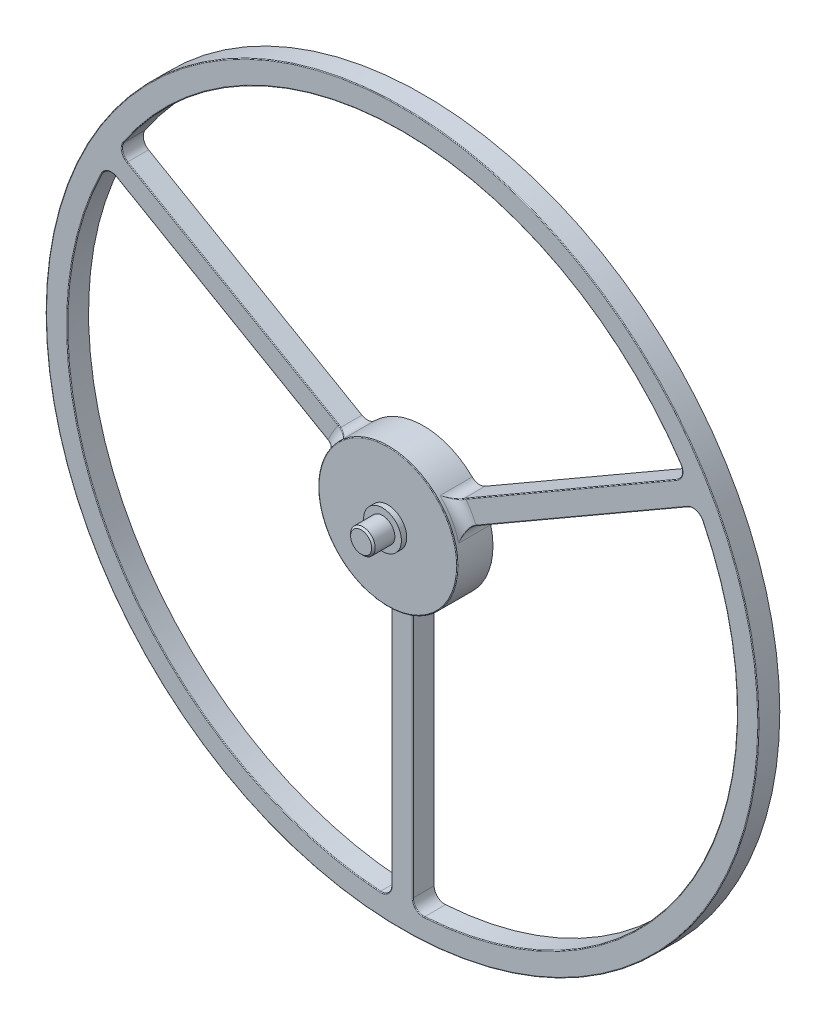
ISO-10303-21;
HEADER;
FILE_DESCRIPTION(('STEP AP214'),'2;1');
FILE_NAME('part.step','',(''),(''),'','','');
FILE_SCHEMA(('AUTOMOTIVE_DESIGN { 1 0 10303 214 1 1 1 1 }'));
ENDSEC;
DATA;
#1=APPLICATION_CONTEXT('core data for automotive mechanical design processes');
#2=APPLICATION_PROTOCOL_DEFINITION('international standard','automotive_design',2000,#1);
#3=PRODUCT_CONTEXT('',#1,'mechanical');
#4=PRODUCT('Part','Part','',(#3));
#5=PRODUCT_RELATED_PRODUCT_CATEGORY('part','',(#4));
#6=PRODUCT_DEFINITION_FORMATION('','',#4);
#7=PRODUCT_DEFINITION_CONTEXT('part definition',#1,'design');
#8=PRODUCT_DEFINITION('design','',#6,#7);
#9=PRODUCT_DEFINITION_SHAPE('','',#8);
#10=(LENGTH_UNIT() NAMED_UNIT(*) SI_UNIT(.MILLI.,.METRE.));
#11=(NAMED_UNIT(*) PLANE_ANGLE_UNIT() SI_UNIT($,.RADIAN.));
#12=(NAMED_UNIT(*) SI_UNIT($,.STERADIAN.) SOLID_ANGLE_UNIT());
#13=UNCERTAINTY_MEASURE_WITH_UNIT(LENGTH_MEASURE(1.E-05),#10,'distance_accuracy_value','');
#14=(GEOMETRIC_REPRESENTATION_CONTEXT(3) GLOBAL_UNCERTAINTY_ASSIGNED_CONTEXT((#13)) GLOBAL_UNIT_ASSIGNED_CONTEXT((#10,
#11,#12)) REPRESENTATION_CONTEXT('',''));
#15=CARTESIAN_POINT('',(0.,0.,0.));
#16=DIRECTION('',(0.,0.,1.));
#17=DIRECTION('',(1.,0.,0.));
#18=AXIS2_PLACEMENT_3D('',#15,#16,#17);
#19=CARTESIAN_POINT('',(0.,0.,10.));
#20=DIRECTION('',(0.,0.,-1.));
#21=DIRECTION('',(-1.,0.,0.));
#22=AXIS2_PLACEMENT_3D('',#19,#20,#21);
#23=CYLINDRICAL_SURFACE('',#22,19.5);
#24=CARTESIAN_POINT('',(0.,0.,9.8));
#25=DIRECTION('',(0.,0.,1.));
#26=DIRECTION('',(1.,0.,0.));
#27=AXIS2_PLACEMENT_3D('',#24,#25,#26);
#28=CIRCLE('',#27,19.5);
#29=CARTESIAN_POINT('',(19.5,0.,9.8));
#30=VERTEX_POINT('',#29);
#31=EDGE_CURVE('E1424',#30,#30,#28,.F.);
#32=ORIENTED_EDGE('',*,*,#31,.T.);
#33=EDGE_LOOP('',(#32));
#34=FACE_BOUND('',#33,.T.);
#35=CARTESIAN_POINT('',(0.,0.,9.));
#36=DIRECTION('',(0.,0.,1.));
#37=DIRECTION('',(1.,0.,0.));
#38=AXIS2_PLACEMENT_3D('',#35,#36,#37);
#39=CIRCLE('',#38,19.5);
#40=CARTESIAN_POINT('',(-13.6759792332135,13.9002730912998,9.));
#41=VERTEX_POINT('',#40);
#42=CARTESIAN_POINT('',(-18.8759792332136,4.89360889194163,9.));
#43=VERTEX_POINT('',#42);
#44=EDGE_CURVE('E383',#41,#43,#39,.T.);
#45=ORIENTED_EDGE('',*,*,#44,.T.);
#46=DIRECTION('',(0.,0.,-1.));
#47=VECTOR('',#46,1.);
#48=CARTESIAN_POINT('',(-18.8759792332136,4.89360889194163,10.));
#49=LINE('',#48,#47);
#50=CARTESIAN_POINT('',(-18.8759792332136,4.89360889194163,0.));
#51=VERTEX_POINT('',#50);
#52=EDGE_CURVE('E386',#43,#51,#49,.T.);
#53=ORIENTED_EDGE('',*,*,#52,.T.);
#54=CARTESIAN_POINT('',(0.,0.,0.));
#55=DIRECTION('',(0.,0.,1.));
#56=DIRECTION('',(1.,0.,0.));
#57=AXIS2_PLACEMENT_3D('',#54,#55,#56);
#58=CIRCLE('',#57,19.5);
#59=CARTESIAN_POINT('',(-5.2,-18.7938819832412,0.));
#60=VERTEX_POINT('',#59);
#61=EDGE_CURVE('E320',#51,#60,#58,.T.);
#62=ORIENTED_EDGE('',*,*,#61,.T.);
#63=DIRECTION('',(0.,0.,-1.));
#64=VECTOR('',#63,1.);
#65=CARTESIAN_POINT('',(-5.2,-18.7938819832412,10.));
#66=LINE('',#65,#64);
#67=CARTESIAN_POINT('',(-5.2,-18.7938819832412,9.));
#68=VERTEX_POINT('',#67);
#69=EDGE_CURVE('E368',#60,#68,#66,.F.);
#70=ORIENTED_EDGE('',*,*,#69,.T.);
#71=CARTESIAN_POINT('',(0.,0.,9.));
#72=DIRECTION('',(0.,0.,1.));
#73=DIRECTION('',(1.,0.,0.));
#74=AXIS2_PLACEMENT_3D('',#71,#72,#73);
#75=CIRCLE('',#74,19.5);
#76=CARTESIAN_POINT('',(5.2,-18.7938819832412,9.));
#77=VERTEX_POINT('',#76);
#78=EDGE_CURVE('E363',#68,#77,#75,.T.);
#79=ORIENTED_EDGE('',*,*,#78,.T.);
#80=DIRECTION('',(0.,0.,-1.));
#81=VECTOR('',#80,1.);
#82=CARTESIAN_POINT('',(5.2,-18.7938819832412,10.));
#83=LINE('',#82,#81);
#84=CARTESIAN_POINT('',(5.2,-18.7938819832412,0.));
#85=VERTEX_POINT('',#84);
#86=EDGE_CURVE('E366',#77,#85,#83,.T.);
#87=ORIENTED_EDGE('',*,*,#86,.T.);
#88=CARTESIAN_POINT('',(18.8759792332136,4.89360889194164,0.));
#89=VERTEX_POINT('',#88);
#90=EDGE_CURVE('E322',#85,#89,#58,.T.);
#91=ORIENTED_EDGE('',*,*,#90,.T.);
#92=DIRECTION('',(0.,0.,-1.));
#93=VECTOR('',#92,1.);
#94=CARTESIAN_POINT('',(18.8759792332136,4.89360889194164,10.));
#95=LINE('',#94,#93);
#96=CARTESIAN_POINT('',(18.8759792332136,4.89360889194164,9.));
#97=VERTEX_POINT('',#96);
#98=EDGE_CURVE('E371',#89,#97,#95,.F.);
#99=ORIENTED_EDGE('',*,*,#98,.T.);
#100=CARTESIAN_POINT('',(0.,0.,9.));
#101=DIRECTION('',(0.,0.,1.));
#102=DIRECTION('',(1.,0.,0.));
#103=AXIS2_PLACEMENT_3D('',#100,#101,#102);
#104=CIRCLE('',#103,19.5);
#105=CARTESIAN_POINT('',(13.6759792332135,13.9002730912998,9.));
#106=VERTEX_POINT('',#105);
#107=EDGE_CURVE('E374',#97,#106,#104,.T.);
#108=ORIENTED_EDGE('',*,*,#107,.T.);
#109=DIRECTION('',(0.,0.,-1.));
#110=VECTOR('',#109,1.);
#111=CARTESIAN_POINT('',(13.6759792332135,13.9002730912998,10.));
#112=LINE('',#111,#110);
#113=CARTESIAN_POINT('',(13.6759792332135,13.9002730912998,0.));
#114=VERTEX_POINT('',#113);
#115=EDGE_CURVE('E377',#106,#114,#112,.T.);
#116=ORIENTED_EDGE('',*,*,#115,.T.);
#117=CARTESIAN_POINT('',(-13.6759792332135,13.9002730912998,0.));
#118=VERTEX_POINT('',#117);
#119=EDGE_CURVE('E315',#114,#118,#58,.T.);
#120=ORIENTED_EDGE('',*,*,#119,.T.);
#121=DIRECTION('',(0.,0.,-1.));
#122=VECTOR('',#121,1.);
#123=CARTESIAN_POINT('',(-13.6759792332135,13.9002730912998,10.));
#124=LINE('',#123,#122);
#125=EDGE_CURVE('E380',#118,#41,#124,.F.);
#126=ORIENTED_EDGE('',*,*,#125,.T.);
#127=EDGE_LOOP('',(#45,#53,#62,#70,#79,#87,#91,#99,#108,#116,#120,#126));
#128=FACE_BOUND('',#127,.T.);
#129=ADVANCED_FACE('F34',(#34,#128),#23,.T.);
#130=CARTESIAN_POINT('',(0.,0.,10.));
#131=DIRECTION('',(0.,0.,1.));
#132=DIRECTION('',(1.,0.,0.));
#133=AXIS2_PLACEMENT_3D('',#130,#131,#132);
#134=PLANE('',#133);
#135=CARTESIAN_POINT('',(0.,0.,10.));
#136=DIRECTION('',(0.,0.,1.));
#137=DIRECTION('',(1.,0.,0.));
#138=AXIS2_PLACEMENT_3D('',#135,#136,#137);
#139=CIRCLE('',#138,19.3);
#140=CARTESIAN_POINT('',(19.3,0.,10.));
#141=VERTEX_POINT('',#140);
#142=EDGE_CURVE('E1422',#141,#141,#139,.T.);
#143=ORIENTED_EDGE('',*,*,#142,.T.);
#144=EDGE_LOOP('',(#143));
#145=FACE_BOUND('',#144,.T.);
#146=CARTESIAN_POINT('',(0.,0.,10.));
#147=DIRECTION('',(0.,0.,1.));
#148=DIRECTION('',(1.,0.,0.));
#149=AXIS2_PLACEMENT_3D('',#146,#147,#148);
#150=CIRCLE('',#149,5.3);
#151=CARTESIAN_POINT('',(5.3,0.,10.));
#152=VERTEX_POINT('',#151);
#153=EDGE_CURVE('E822',#152,#152,#150,.T.);
#154=ORIENTED_EDGE('',*,*,#153,.F.);
#155=EDGE_LOOP('',(#154));
#156=FACE_BOUND('',#155,.T.);
#157=ADVANCED_FACE('F756',(#145,#156),#134,.T.);
#158=CARTESIAN_POINT('',(0.,0.,0.));
#159=DIRECTION('',(0.,0.,1.));
#160=DIRECTION('',(1.,0.,0.));
#161=AXIS2_PLACEMENT_3D('',#158,#159,#160);
#162=PLANE('',#161);
#163=ORIENTED_EDGE('',*,*,#90,.F.);
#164=CARTESIAN_POINT('',(6.,-21.6852484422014,0.));
#165=DIRECTION('',(0.,0.,1.));
#166=DIRECTION('',(1.,0.,0.));
#167=AXIS2_PLACEMENT_3D('',#164,#165,#166);
#168=CIRCLE('',#167,3.);
#169=CARTESIAN_POINT('',(3.,-21.6852484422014,0.));
#170=VERTEX_POINT('',#169);
#171=EDGE_CURVE('E416',#85,#170,#168,.T.);
#172=ORIENTED_EDGE('',*,*,#171,.T.);
#173=DIRECTION('',(0.,-1.,0.));
#174=VECTOR('',#173,1.);
#175=CARTESIAN_POINT('',(3.,-19.2678488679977,0.));
#176=LINE('',#175,#174);
#177=CARTESIAN_POINT('',(3.,-90.8019823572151,0.));
#178=VERTEX_POINT('',#177);
#179=EDGE_CURVE('E831',#170,#178,#176,.T.);
#180=ORIENTED_EDGE('',*,*,#179,.T.);
#181=CARTESIAN_POINT('',(6.,-90.8019823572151,0.));
#182=DIRECTION('',(0.,0.,1.));
#183=DIRECTION('',(1.,0.,0.));
#184=AXIS2_PLACEMENT_3D('',#181,#182,#183);
#185=CIRCLE('',#184,3.);
#186=CARTESIAN_POINT('',(6.1978021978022,-93.7954543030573,0.));
#187=VERTEX_POINT('',#186);
#188=EDGE_CURVE('E400',#178,#187,#185,.T.);
#189=ORIENTED_EDGE('',*,*,#188,.T.);
#190=CARTESIAN_POINT('',(0.,0.,0.));
#191=DIRECTION('',(0.,0.,1.));
#192=DIRECTION('',(1.,0.,0.));
#193=AXIS2_PLACEMENT_3D('',#190,#191,#192);
#194=CIRCLE('',#193,94.);
#195=CARTESIAN_POINT('',(84.328147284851,41.5302730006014,0.));
#196=VERTEX_POINT('',#195);
#197=EDGE_CURVE('E835',#187,#196,#194,.T.);
#198=ORIENTED_EDGE('',*,*,#197,.T.);
#199=CARTESIAN_POINT('',(81.6368234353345,40.2048387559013,0.));
#200=DIRECTION('',(0.,0.,1.));
#201=DIRECTION('',(1.,0.,0.));
#202=AXIS2_PLACEMENT_3D('',#199,#200,#201);
#203=CIRCLE('',#202,3.);
#204=CARTESIAN_POINT('',(80.1368234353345,42.8029149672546,0.));
#205=VERTEX_POINT('',#204);
#206=EDGE_CURVE('E304',#196,#205,#203,.T.);
#207=ORIENTED_EDGE('',*,*,#206,.T.);
#208=DIRECTION('',(-0.866025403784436,-0.500000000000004,0.));
#209=VECTOR('',#208,1.);
#210=CARTESIAN_POINT('',(18.1864465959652,7.03584822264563,0.));
#211=LINE('',#210,#209);
#212=CARTESIAN_POINT('',(20.2799760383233,8.2445480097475,0.));
#213=VERTEX_POINT('',#212);
#214=EDGE_CURVE('E838',#205,#213,#211,.T.);
#215=ORIENTED_EDGE('',*,*,#214,.T.);
#216=CARTESIAN_POINT('',(21.7799760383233,5.6464717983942,0.));
#217=DIRECTION('',(0.,0.,1.));
#218=DIRECTION('',(1.,0.,0.));
#219=AXIS2_PLACEMENT_3D('',#216,#217,#218);
#220=CIRCLE('',#219,3.);
#221=EDGE_CURVE('E412',#213,#89,#220,.T.);
#222=ORIENTED_EDGE('',*,*,#221,.T.);
#223=EDGE_LOOP('',(#163,#172,#180,#189,#198,#207,#215,#222));
#224=FACE_BOUND('',#223,.T.);
#225=ORIENTED_EDGE('',*,*,#119,.F.);
#226=CARTESIAN_POINT('',(15.7799760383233,16.0387766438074,0.));
#227=DIRECTION('',(0.,0.,1.));
#228=DIRECTION('',(1.,0.,0.));
#229=AXIS2_PLACEMENT_3D('',#226,#227,#228);
#230=CIRCLE('',#229,3.);
#231=CARTESIAN_POINT('',(17.2799760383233,13.4407004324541,0.));
#232=VERTEX_POINT('',#231);
#233=EDGE_CURVE('E410',#114,#232,#230,.T.);
#234=ORIENTED_EDGE('',*,*,#233,.T.);
#235=DIRECTION('',(0.866025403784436,0.500000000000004,0.));
#236=VECTOR('',#235,1.);
#237=CARTESIAN_POINT('',(15.1864465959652,12.2320006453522,0.));
#238=LINE('',#237,#236);
#239=CARTESIAN_POINT('',(77.1368234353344,47.9990673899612,0.));
#240=VERTEX_POINT('',#239);
#241=EDGE_CURVE('E841',#232,#240,#238,.T.);
#242=ORIENTED_EDGE('',*,*,#241,.T.);
#243=CARTESIAN_POINT('',(75.6368234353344,50.5971436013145,0.));
#244=DIRECTION('',(0.,0.,1.));
#245=DIRECTION('',(1.,0.,0.));
#246=AXIS2_PLACEMENT_3D('',#243,#244,#245);
#247=CIRCLE('',#246,3.);
#248=CARTESIAN_POINT('',(78.1303450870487,52.2651813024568,0.));
#249=VERTEX_POINT('',#248);
#250=EDGE_CURVE('E402',#240,#249,#247,.T.);
#251=ORIENTED_EDGE('',*,*,#250,.T.);
#252=CARTESIAN_POINT('',(0.,0.,0.));
#253=DIRECTION('',(0.,0.,1.));
#254=DIRECTION('',(1.,0.,0.));
#255=AXIS2_PLACEMENT_3D('',#252,#253,#254);
#256=CIRCLE('',#255,94.);
#257=CARTESIAN_POINT('',(-78.1303450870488,52.2651813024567,0.));
#258=VERTEX_POINT('',#257);
#259=EDGE_CURVE('E844',#249,#258,#256,.T.);
#260=ORIENTED_EDGE('',*,*,#259,.T.);
#261=CARTESIAN_POINT('',(-75.6368234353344,50.5971436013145,0.));
#262=DIRECTION('',(0.,0.,1.));
#263=DIRECTION('',(1.,0.,0.));
#264=AXIS2_PLACEMENT_3D('',#261,#262,#263);
#265=CIRCLE('',#264,3.);
#266=CARTESIAN_POINT('',(-77.1368234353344,47.9990673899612,0.));
#267=VERTEX_POINT('',#266);
#268=EDGE_CURVE('E303',#258,#267,#265,.T.);
#269=ORIENTED_EDGE('',*,*,#268,.T.);
#270=DIRECTION('',(0.866025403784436,-0.500000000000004,0.));
#271=VECTOR('',#270,1.);
#272=CARTESIAN_POINT('',(-15.1864465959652,12.2320006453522,0.));
#273=LINE('',#272,#271);
#274=CARTESIAN_POINT('',(-17.2799760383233,13.4407004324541,0.));
#275=VERTEX_POINT('',#274);
#276=EDGE_CURVE('E846',#267,#275,#273,.T.);
#277=ORIENTED_EDGE('',*,*,#276,.T.);
#278=CARTESIAN_POINT('',(-15.7799760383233,16.0387766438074,0.));
#279=DIRECTION('',(0.,0.,1.));
#280=DIRECTION('',(1.,0.,0.));
#281=AXIS2_PLACEMENT_3D('',#278,#279,#280);
#282=CIRCLE('',#281,3.);
#283=EDGE_CURVE('E408',#275,#118,#282,.T.);
#284=ORIENTED_EDGE('',*,*,#283,.T.);
#285=EDGE_LOOP('',(#225,#234,#242,#251,#260,#269,#277,#284));
#286=FACE_BOUND('',#285,.T.);
#287=CARTESIAN_POINT('',(0.,0.,0.));
#288=DIRECTION('',(0.,0.,1.));
#289=DIRECTION('',(1.,0.,0.));
#290=AXIS2_PLACEMENT_3D('',#287,#288,#289);
#291=CIRCLE('',#290,94.);
#292=CARTESIAN_POINT('',(-84.328147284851,41.5302730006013,0.));
#293=VERTEX_POINT('',#292);
#294=CARTESIAN_POINT('',(-6.1978021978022,-93.7954543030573,0.));
#295=VERTEX_POINT('',#294);
#296=EDGE_CURVE('E297',#293,#295,#291,.T.);
#297=ORIENTED_EDGE('',*,*,#296,.T.);
#298=CARTESIAN_POINT('',(-6.,-90.8019823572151,0.));
#299=DIRECTION('',(0.,0.,1.));
#300=DIRECTION('',(1.,0.,0.));
#301=AXIS2_PLACEMENT_3D('',#298,#299,#300);
#302=CIRCLE('',#301,3.);
#303=CARTESIAN_POINT('',(-3.,-90.8019823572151,0.));
#304=VERTEX_POINT('',#303);
#305=EDGE_CURVE('E398',#295,#304,#302,.T.);
#306=ORIENTED_EDGE('',*,*,#305,.T.);
#307=DIRECTION('',(0.,1.,0.));
#308=VECTOR('',#307,1.);
#309=CARTESIAN_POINT('',(-3.,-19.2678488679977,0.));
#310=LINE('',#309,#308);
#311=CARTESIAN_POINT('',(-3.,-21.6852484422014,0.));
#312=VERTEX_POINT('',#311);
#313=EDGE_CURVE('E310',#304,#312,#310,.T.);
#314=ORIENTED_EDGE('',*,*,#313,.T.);
#315=CARTESIAN_POINT('',(-6.,-21.6852484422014,0.));
#316=DIRECTION('',(0.,0.,1.));
#317=DIRECTION('',(1.,0.,0.));
#318=AXIS2_PLACEMENT_3D('',#315,#316,#317);
#319=CIRCLE('',#318,3.);
#320=EDGE_CURVE('E414',#312,#60,#319,.T.);
#321=ORIENTED_EDGE('',*,*,#320,.T.);
#322=ORIENTED_EDGE('',*,*,#61,.F.);
#323=CARTESIAN_POINT('',(-21.7799760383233,5.64647179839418,0.));
#324=DIRECTION('',(0.,0.,1.));
#325=DIRECTION('',(1.,0.,0.));
#326=AXIS2_PLACEMENT_3D('',#323,#324,#325);
#327=CIRCLE('',#326,3.);
#328=CARTESIAN_POINT('',(-20.2799760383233,8.2445480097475,0.));
#329=VERTEX_POINT('',#328);
#330=EDGE_CURVE('E406',#51,#329,#327,.T.);
#331=ORIENTED_EDGE('',*,*,#330,.T.);
#332=DIRECTION('',(-0.866025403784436,0.500000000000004,0.));
#333=VECTOR('',#332,1.);
#334=CARTESIAN_POINT('',(-18.1864465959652,7.03584822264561,0.));
#335=LINE('',#334,#333);
#336=CARTESIAN_POINT('',(-80.1368234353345,42.8029149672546,0.));
#337=VERTEX_POINT('',#336);
#338=EDGE_CURVE('E299',#329,#337,#335,.T.);
#339=ORIENTED_EDGE('',*,*,#338,.T.);
#340=CARTESIAN_POINT('',(-81.6368234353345,40.2048387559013,0.));
#341=DIRECTION('',(0.,0.,1.));
#342=DIRECTION('',(1.,0.,0.));
#343=AXIS2_PLACEMENT_3D('',#340,#341,#342);
#344=CIRCLE('',#343,3.);
#345=EDGE_CURVE('E293',#337,#293,#344,.T.);
#346=ORIENTED_EDGE('',*,*,#345,.T.);
#347=EDGE_LOOP('',(#297,#306,#314,#321,#322,#331,#339,#346));
#348=FACE_BOUND('',#347,.T.);
#349=CARTESIAN_POINT('',(0.,0.,0.));
#350=DIRECTION('',(0.,0.,1.));
#351=DIRECTION('',(1.,0.,0.));
#352=AXIS2_PLACEMENT_3D('',#349,#350,#351);
#353=CIRCLE('',#352,100.);
#354=CARTESIAN_POINT('',(100.,0.,0.));
#355=VERTEX_POINT('',#354);
#356=EDGE_CURVE('E851',#355,#355,#353,.T.);
#357=ORIENTED_EDGE('',*,*,#356,.F.);
#358=EDGE_LOOP('',(#357));
#359=FACE_BOUND('',#358,.T.);
#360=ADVANCED_FACE('F295',(#224,#286,#348,#359),#162,.F.);
#361=CARTESIAN_POINT('',(0.,0.,6.));
#362=DIRECTION('',(0.,0.,1.));
#363=DIRECTION('',(1.,0.,0.));
#364=AXIS2_PLACEMENT_3D('',#361,#362,#363);
#365=PLANE('',#364);
#366=CARTESIAN_POINT('',(0.,0.,6.));
#367=DIRECTION('',(0.,0.,1.));
#368=DIRECTION('',(1.,0.,0.));
#369=AXIS2_PLACEMENT_3D('',#366,#367,#368);
#370=CIRCLE('',#369,99.8);
#371=CARTESIAN_POINT('',(99.8,0.,6.));
#372=VERTEX_POINT('',#371);
#373=EDGE_CURVE('E986',#372,#372,#370,.T.);
#374=ORIENTED_EDGE('',*,*,#373,.T.);
#375=EDGE_LOOP('',(#374));
#376=FACE_BOUND('',#375,.T.);
#377=CARTESIAN_POINT('',(75.6368234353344,50.5971436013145,6.));
#378=DIRECTION('',(0.,0.,1.));
#379=DIRECTION('',(1.,0.,0.));
#380=AXIS2_PLACEMENT_3D('',#377,#378,#379);
#381=CIRCLE('',#380,3.2);
#382=CARTESIAN_POINT('',(78.2965798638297,52.3763838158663,6.));
#383=VERTEX_POINT('',#382);
#384=CARTESIAN_POINT('',(77.2368234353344,47.8258623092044,6.));
#385=VERTEX_POINT('',#384);
#386=EDGE_CURVE('E1004',#383,#385,#381,.F.);
#387=ORIENTED_EDGE('',*,*,#386,.T.);
#388=DIRECTION('',(0.866025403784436,0.500000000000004,0.));
#389=VECTOR('',#388,1.);
#390=CARTESIAN_POINT('',(-1.40000000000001,2.42487113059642,6.));
#391=LINE('',#390,#389);
#392=CARTESIAN_POINT('',(17.9341019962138,13.5874201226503,6.));
#393=VERTEX_POINT('',#392);
#394=EDGE_CURVE('E954',#385,#393,#391,.F.);
#395=ORIENTED_EDGE('',*,*,#394,.T.);
#396=CARTESIAN_POINT('',(0.,0.,6.));
#397=DIRECTION('',(0.,0.,1.));
#398=DIRECTION('',(1.,0.,0.));
#399=AXIS2_PLACEMENT_3D('',#396,#397,#398);
#400=CIRCLE('',#399,22.5);
#401=CARTESIAN_POINT('',(20.7341019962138,8.73767786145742,6.));
#402=VERTEX_POINT('',#401);
#403=EDGE_CURVE('E392',#393,#402,#400,.F.);
#404=ORIENTED_EDGE('',*,*,#403,.T.);
#405=DIRECTION('',(-0.866025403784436,-0.500000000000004,0.));
#406=VECTOR('',#405,1.);
#407=CARTESIAN_POINT('',(1.40000000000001,-2.42487113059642,6.));
#408=LINE('',#407,#406);
#409=CARTESIAN_POINT('',(80.0368234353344,42.9761200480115,6.));
#410=VERTEX_POINT('',#409);
#411=EDGE_CURVE('E993',#402,#410,#408,.F.);
#412=ORIENTED_EDGE('',*,*,#411,.T.);
#413=CARTESIAN_POINT('',(81.6368234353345,40.2048387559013,6.));
#414=DIRECTION('',(0.,0.,1.));
#415=DIRECTION('',(1.,0.,0.));
#416=AXIS2_PLACEMENT_3D('',#413,#414,#415);
#417=CIRCLE('',#416,3.2);
#418=CARTESIAN_POINT('',(84.5075688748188,41.6186352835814,6.));
#419=VERTEX_POINT('',#418);
#420=EDGE_CURVE('E991',#410,#419,#417,.F.);
#421=ORIENTED_EDGE('',*,*,#420,.T.);
#422=CARTESIAN_POINT('',(0.,0.,6.));
#423=DIRECTION('',(0.,0.,1.));
#424=DIRECTION('',(1.,0.,0.));
#425=AXIS2_PLACEMENT_3D('',#422,#423,#424);
#426=CIRCLE('',#425,94.2);
#427=CARTESIAN_POINT('',(6.21098901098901,-93.9950190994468,6.));
#428=VERTEX_POINT('',#427);
#429=EDGE_CURVE('E989',#419,#428,#426,.F.);
#430=ORIENTED_EDGE('',*,*,#429,.T.);
#431=CARTESIAN_POINT('',(6.,-90.8019823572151,6.));
#432=DIRECTION('',(0.,0.,1.));
#433=DIRECTION('',(1.,0.,0.));
#434=AXIS2_PLACEMENT_3D('',#431,#432,#433);
#435=CIRCLE('',#434,3.2);
#436=CARTESIAN_POINT('',(2.8,-90.8019823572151,6.));
#437=VERTEX_POINT('',#436);
#438=EDGE_CURVE('E995',#428,#437,#435,.F.);
#439=ORIENTED_EDGE('',*,*,#438,.T.);
#440=DIRECTION('',(0.,-1.,0.));
#441=VECTOR('',#440,1.);
#442=CARTESIAN_POINT('',(2.8,0.,6.));
#443=LINE('',#442,#441);
#444=CARTESIAN_POINT('',(2.8,-22.3250979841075,6.));
#445=VERTEX_POINT('',#444);
#446=EDGE_CURVE('E997',#437,#445,#443,.F.);
#447=ORIENTED_EDGE('',*,*,#446,.T.);
#448=CARTESIAN_POINT('',(0.,0.,6.));
#449=DIRECTION('',(0.,0.,1.));
#450=DIRECTION('',(1.,0.,0.));
#451=AXIS2_PLACEMENT_3D('',#448,#449,#450);
#452=CIRCLE('',#451,22.5);
#453=CARTESIAN_POINT('',(-2.8,-22.3250979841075,6.));
#454=VERTEX_POINT('',#453);
#455=EDGE_CURVE('E389',#445,#454,#452,.F.);
#456=ORIENTED_EDGE('',*,*,#455,.T.);
#457=DIRECTION('',(0.,1.,0.));
#458=VECTOR('',#457,1.);
#459=CARTESIAN_POINT('',(-2.8,0.,6.));
#460=LINE('',#459,#458);
#461=CARTESIAN_POINT('',(-2.8,-90.8019823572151,6.));
#462=VERTEX_POINT('',#461);
#463=EDGE_CURVE('E981',#454,#462,#460,.F.);
#464=ORIENTED_EDGE('',*,*,#463,.T.);
#465=CARTESIAN_POINT('',(-6.,-90.8019823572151,6.));
#466=DIRECTION('',(0.,0.,1.));
#467=DIRECTION('',(1.,0.,0.));
#468=AXIS2_PLACEMENT_3D('',#465,#466,#467);
#469=CIRCLE('',#468,3.2);
#470=CARTESIAN_POINT('',(-6.21098901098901,-93.9950190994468,6.));
#471=VERTEX_POINT('',#470);
#472=EDGE_CURVE('E979',#462,#471,#469,.F.);
#473=ORIENTED_EDGE('',*,*,#472,.T.);
#474=CARTESIAN_POINT('',(0.,0.,6.));
#475=DIRECTION('',(0.,0.,1.));
#476=DIRECTION('',(1.,0.,0.));
#477=AXIS2_PLACEMENT_3D('',#474,#475,#476);
#478=CIRCLE('',#477,94.2);
#479=CARTESIAN_POINT('',(-84.5075688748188,41.6186352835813,6.));
#480=VERTEX_POINT('',#479);
#481=EDGE_CURVE('E975',#471,#480,#478,.F.);
#482=ORIENTED_EDGE('',*,*,#481,.T.);
#483=CARTESIAN_POINT('',(-81.6368234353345,40.2048387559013,6.));
#484=DIRECTION('',(0.,0.,1.));
#485=DIRECTION('',(1.,0.,0.));
#486=AXIS2_PLACEMENT_3D('',#483,#484,#485);
#487=CIRCLE('',#486,3.2);
#488=CARTESIAN_POINT('',(-80.0368234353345,42.9761200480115,6.));
#489=VERTEX_POINT('',#488);
#490=EDGE_CURVE('E983',#480,#489,#487,.F.);
#491=ORIENTED_EDGE('',*,*,#490,.T.);
#492=DIRECTION('',(-0.866025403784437,0.500000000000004,0.));
#493=VECTOR('',#492,1.);
#494=CARTESIAN_POINT('',(-1.40000000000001,-2.42487113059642,6.));
#495=LINE('',#494,#493);
#496=CARTESIAN_POINT('',(-20.7341019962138,8.73767786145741,6.));
#497=VERTEX_POINT('',#496);
#498=EDGE_CURVE('E945',#489,#497,#495,.F.);
#499=ORIENTED_EDGE('',*,*,#498,.T.);
#500=CARTESIAN_POINT('',(0.,0.,6.));
#501=DIRECTION('',(0.,0.,1.));
#502=DIRECTION('',(1.,0.,0.));
#503=AXIS2_PLACEMENT_3D('',#500,#501,#502);
#504=CIRCLE('',#503,22.5);
#505=CARTESIAN_POINT('',(-17.9341019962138,13.5874201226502,6.));
#506=VERTEX_POINT('',#505);
#507=EDGE_CURVE('E395',#497,#506,#504,.F.);
#508=ORIENTED_EDGE('',*,*,#507,.T.);
#509=DIRECTION('',(0.866025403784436,-0.500000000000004,0.));
#510=VECTOR('',#509,1.);
#511=CARTESIAN_POINT('',(1.40000000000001,2.42487113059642,6.));
#512=LINE('',#511,#510);
#513=CARTESIAN_POINT('',(-77.2368234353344,47.8258623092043,6.));
#514=VERTEX_POINT('',#513);
#515=EDGE_CURVE('E1002',#506,#514,#512,.F.);
#516=ORIENTED_EDGE('',*,*,#515,.T.);
#517=CARTESIAN_POINT('',(-75.6368234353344,50.5971436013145,6.));
#518=DIRECTION('',(0.,0.,1.));
#519=DIRECTION('',(1.,0.,0.));
#520=AXIS2_PLACEMENT_3D('',#517,#518,#519);
#521=CIRCLE('',#520,3.2);
#522=CARTESIAN_POINT('',(-78.2965798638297,52.3763838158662,6.));
#523=VERTEX_POINT('',#522);
#524=EDGE_CURVE('E1000',#514,#523,#521,.F.);
#525=ORIENTED_EDGE('',*,*,#524,.T.);
#526=CARTESIAN_POINT('',(0.,0.,6.));
#527=DIRECTION('',(0.,0.,1.));
#528=DIRECTION('',(1.,0.,0.));
#529=AXIS2_PLACEMENT_3D('',#526,#527,#528);
#530=CIRCLE('',#529,94.2);
#531=EDGE_CURVE('E807',#523,#383,#530,.F.);
#532=ORIENTED_EDGE('',*,*,#531,.T.);
#533=EDGE_LOOP('',(#387,#395,#404,#412,#421,#430,#439,#447,#456,#464,#473,#482,#491,#499,#508,
#516,#525,#532));
#534=FACE_BOUND('',#533,.T.);
#535=ADVANCED_FACE('F1008',(#376,#534),#365,.T.);
#536=CARTESIAN_POINT('',(0.,0.,6.));
#537=DIRECTION('',(0.,0.,-1.));
#538=DIRECTION('',(-1.,0.,0.));
#539=AXIS2_PLACEMENT_3D('',#536,#537,#538);
#540=CYLINDRICAL_SURFACE('',#539,100.);
#541=CARTESIAN_POINT('',(0.,0.,5.8));
#542=DIRECTION('',(0.,0.,1.));
#543=DIRECTION('',(1.,0.,0.));
#544=AXIS2_PLACEMENT_3D('',#541,#542,#543);
#545=CIRCLE('',#544,100.);
#546=CARTESIAN_POINT('',(100.,0.,5.8));
#547=VERTEX_POINT('',#546);
#548=EDGE_CURVE('E48',#547,#547,#545,.F.);
#549=ORIENTED_EDGE('',*,*,#548,.T.);
#550=EDGE_LOOP('',(#549));
#551=FACE_BOUND('',#550,.T.);
#552=ORIENTED_EDGE('',*,*,#356,.T.);
#553=EDGE_LOOP('',(#552));
#554=FACE_BOUND('',#553,.T.);
#555=ADVANCED_FACE('F1197',(#551,#554),#540,.T.);
#556=CARTESIAN_POINT('',(3.,-19.2678488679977,6.));
#557=DIRECTION('',(1.,0.,0.));
#558=DIRECTION('',(0.,0.,-1.));
#559=AXIS2_PLACEMENT_3D('',#556,#557,#558);
#560=PLANE('',#559);
#561=DIRECTION('',(0.,0.,-1.));
#562=VECTOR('',#561,1.);
#563=CARTESIAN_POINT('',(3.,-21.6852484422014,6.));
#564=LINE('',#563,#562);
#565=CARTESIAN_POINT('',(3.,-21.6852484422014,5.86358215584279));
#566=VERTEX_POINT('',#565);
#567=EDGE_CURVE('E328',#170,#566,#564,.F.);
#568=ORIENTED_EDGE('',*,*,#567,.T.);
#569=CARTESIAN_POINT('',(3.,-23.397553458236,5.98224476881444));
#570=CARTESIAN_POINT('',(3.,-23.3287751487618,6.1786164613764));
#571=CARTESIAN_POINT('',(2.79209459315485,-23.3314937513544,6.17085447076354));
#572=CARTESIAN_POINT('',(3.,-23.3113857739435,5.95206917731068));
#573=CARTESIAN_POINT('',(3.,-23.2484839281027,6.14983177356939));
#574=CARTESIAN_POINT('',(2.79270126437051,-23.250638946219,6.1425648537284));
#575=CARTESIAN_POINT('',(3.,-23.2239956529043,5.92555389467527));
#576=CARTESIAN_POINT('',(3.,-23.1668782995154,6.12438239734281));
#577=CARTESIAN_POINT('',(2.79332313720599,-23.1686358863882,6.11770677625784));
#578=CARTESIAN_POINT('',(3.,-23.0472675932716,5.87997821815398));
#579=CARTESIAN_POINT('',(3.,-23.0017186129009,6.08043394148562));
#580=CARTESIAN_POINT('',(2.79459513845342,-23.0027993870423,6.07497957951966));
#581=CARTESIAN_POINT('',(3.,-22.9579291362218,5.86091983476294));
#582=CARTESIAN_POINT('',(3.,-22.9181808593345,6.06191679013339));
#583=CARTESIAN_POINT('',(2.79524527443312,-22.9189654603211,6.05711234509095));
#584=CARTESIAN_POINT('',(3.,-22.688743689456,5.8153115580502));
#585=CARTESIAN_POINT('',(3.,-22.6666825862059,6.01725584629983));
#586=CARTESIAN_POINT('',(2.79722746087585,-22.6663613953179,6.01435458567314));
#587=CARTESIAN_POINT('',(3.,-22.5068201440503,5.80001237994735));
#588=CARTESIAN_POINT('',(3.,-22.496235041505,6.00141770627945));
#589=CARTESIAN_POINT('',(2.79859764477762,-22.4956383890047,6.00001160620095));
#590=CARTESIAN_POINT('',(3.,-22.2177097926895,5.79999268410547));
#591=CARTESIAN_POINT('',(3.,-22.2245279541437,5.99916687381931));
#592=CARTESIAN_POINT('',(2.80082871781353,-22.2243176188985,5.9999931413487));
#593=CARTESIAN_POINT('',(3.,-22.1103919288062,5.80532380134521));
#594=CARTESIAN_POINT('',(3.,-22.1237291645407,6.00331396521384));
#595=CARTESIAN_POINT('',(2.80166867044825,-22.1236010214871,6.00499106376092));
#596=CARTESIAN_POINT('',(3.,-21.8968051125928,5.82654874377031));
#597=CARTESIAN_POINT('',(3.,-21.9229482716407,6.02158258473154));
#598=CARTESIAN_POINT('',(2.80336434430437,-21.9231476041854,6.02488944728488));
#599=CARTESIAN_POINT('',(3.,-21.7905361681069,5.84244264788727));
#600=CARTESIAN_POINT('',(3.,-21.8229679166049,6.03566213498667));
#601=CARTESIAN_POINT('',(2.80422006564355,-21.8234107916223,6.03978998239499));
#602=CARTESIAN_POINT('',(3.,-21.5069563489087,5.89937936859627));
#603=CARTESIAN_POINT('',(3.,-21.5563273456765,6.08689766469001));
#604=CARTESIAN_POINT('',(2.80653648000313,-21.5572556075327,6.09316815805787));
#605=CARTESIAN_POINT('',(3.,-21.3314779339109,5.95021853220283));
#606=CARTESIAN_POINT('',(3.,-21.3908232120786,6.13325031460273));
#607=CARTESIAN_POINT('',(2.80800523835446,-21.3925526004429,6.14082987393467));
#608=CARTESIAN_POINT('',(3.,-21.0763538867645,6.04797440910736));
#609=CARTESIAN_POINT('',(3.,-21.1495232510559,6.2234689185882));
#610=CARTESIAN_POINT('',(2.81019070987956,-21.1530846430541,6.23247600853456));
#611=CARTESIAN_POINT('',(3.,-20.9924560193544,6.08426393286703));
#612=CARTESIAN_POINT('',(3.,-21.0702431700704,6.2569918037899));
#613=CARTESIAN_POINT('',(2.81091810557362,-21.0743335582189,6.2664974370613));
#614=CARTESIAN_POINT('',(3.,-20.8280404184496,6.16377527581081));
#615=CARTESIAN_POINT('',(3.,-20.9147958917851,6.33064918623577));
#616=CARTESIAN_POINT('',(2.81235978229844,-20.9200008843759,6.34103932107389));
#617=CARTESIAN_POINT('',(3.,-20.7475217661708,6.20699519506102));
#618=CARTESIAN_POINT('',(3.,-20.8386113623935,6.37076224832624));
#619=CARTESIAN_POINT('',(2.8130740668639,-20.8444184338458,6.3815579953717));
#620=CARTESIAN_POINT('',(3.,-20.6689224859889,6.25356478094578));
#621=CARTESIAN_POINT('',(3.,-20.7640801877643,6.41415320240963));
#622=CARTESIAN_POINT('',(2.81377905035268,-20.7706361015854,6.42521698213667));
#623=(BOUNDED_SURFACE() B_SPLINE_SURFACE(3,2,((#569,#570,#571),(#572,#573,#574),(#575,#576,
#577),(#578,#579,#580),(#581,#582,#583),(#584,#585,#586),(#587,#588,#589),(#590,#591,#592),
(#593,#594,#595),(#596,#597,#598),(#599,#600,#601),(#602,#603,#604),(#605,#606,#607),(#608,#609,
#610),(#611,#612,#613),(#614,#615,#616),(#617,#618,#619),(#620,#621,#622)),.UNSPECIFIED.,.F.,
.F.,.F.) B_SPLINE_SURFACE_WITH_KNOTS((4,2,2,2,2,2,2,2,4),(3,3),(0.,0.273702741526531,
0.547479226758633,1.09218748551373,1.41408127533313,1.7359774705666,2.28106993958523,
2.55503033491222,2.82891575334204),(0.,1.),
.UNSPECIFIED.) GEOMETRIC_REPRESENTATION_ITEM() RATIONAL_B_SPLINE_SURFACE(((1.,0.69299096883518,
1.),(1.,0.694085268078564,1.),(1.,0.695204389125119,1.),(1.,0.697487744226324,1.),(1.,
0.698651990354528,1.),(1.,0.702192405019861,1.),(1.,0.70462772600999,1.),(1.,0.708571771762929,
1.),(1.,0.710052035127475,1.),(1.,0.713030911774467,1.),(1.,0.714529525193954,1.),(1.,
0.718573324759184,1.),(1.,0.721123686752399,1.),(1.,0.72489888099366,1.),(1.,0.72615204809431,
1.),(1.,0.728629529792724,1.),(1.,0.729853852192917,1.),(1.,0.731059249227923,1.))) REPRESENTATION_ITEM('') SURFACE());
#624=CARTESIAN_POINT('',(3.,-20.6689224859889,6.25356478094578));
#625=CARTESIAN_POINT('',(3.,-20.7475217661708,6.20699519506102));
#626=CARTESIAN_POINT('',(3.,-20.8280404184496,6.16377527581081));
#627=CARTESIAN_POINT('',(3.,-20.9924560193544,6.08426393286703));
#628=CARTESIAN_POINT('',(3.,-21.0763538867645,6.04797440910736));
#629=CARTESIAN_POINT('',(3.,-21.3314779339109,5.95021853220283));
#630=CARTESIAN_POINT('',(3.,-21.5069563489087,5.89937936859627));
#631=CARTESIAN_POINT('',(3.,-21.7905361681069,5.84244264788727));
#632=CARTESIAN_POINT('',(3.,-21.8968051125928,5.82654874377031));
#633=CARTESIAN_POINT('',(3.,-22.1103919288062,5.80532380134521));
#634=CARTESIAN_POINT('',(3.,-22.2177097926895,5.79999268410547));
#635=CARTESIAN_POINT('',(3.,-22.5068201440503,5.80001237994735));
#636=CARTESIAN_POINT('',(3.,-22.688743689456,5.8153115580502));
#637=CARTESIAN_POINT('',(3.,-22.9579291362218,5.86091983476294));
#638=CARTESIAN_POINT('',(3.,-23.0472675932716,5.87997821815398));
#639=CARTESIAN_POINT('',(3.,-23.2239956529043,5.92555389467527));
#640=CARTESIAN_POINT('',(3.,-23.3113857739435,5.95206917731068));
#641=CARTESIAN_POINT('',(3.,-23.397553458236,5.98224476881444));
#642=B_SPLINE_CURVE_WITH_KNOTS('',3,(#624,#625,#626,#627,#628,#629,#630,#631,#632,#633,#634,
#635,#636,#637,#638,#639,#640,#641),.UNSPECIFIED.,.F.,.F.,(4,2,2,2,2,2,2,2,4),(0.,
0.273885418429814,0.547845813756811,1.09293828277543,1.41483447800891,1.73672826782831,
2.2814365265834,2.55521301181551,2.82891575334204),.UNSPECIFIED.);
#643=CARTESIAN_POINT('',(3.,-22.3250979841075,5.8));
#644=VERTEX_POINT('',#643);
#645=EDGE_CURVE('E1631',#566,#644,#642,.T.);
#646=ORIENTED_EDGE('',*,*,#645,.T.);
#647=DIRECTION('',(0.,-1.,0.));
#648=VECTOR('',#647,1.);
#649=CARTESIAN_POINT('',(3.,-19.2678488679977,5.8));
#650=LINE('',#649,#648);
#651=CARTESIAN_POINT('',(3.,-90.8019823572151,5.8));
#652=VERTEX_POINT('',#651);
#653=EDGE_CURVE('E1635',#644,#652,#650,.T.);
#654=ORIENTED_EDGE('',*,*,#653,.T.);
#655=DIRECTION('',(0.,0.,1.));
#656=VECTOR('',#655,1.);
#657=CARTESIAN_POINT('',(3.,-90.8019823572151,0.));
#658=LINE('',#657,#656);
#659=EDGE_CURVE('E331',#652,#178,#658,.F.);
#660=ORIENTED_EDGE('',*,*,#659,.T.);
#661=ORIENTED_EDGE('',*,*,#179,.F.);
#662=EDGE_LOOP('',(#568,#646,#654,#660,#661));
#663=FACE_BOUND('',#662,.T.);
#664=ADVANCED_FACE('F1190',(#663),#560,.T.);
#665=CARTESIAN_POINT('',(0.,0.,6.));
#666=DIRECTION('',(0.,0.,-1.));
#667=DIRECTION('',(-1.,0.,0.));
#668=AXIS2_PLACEMENT_3D('',#665,#666,#667);
#669=CYLINDRICAL_SURFACE('',#668,94.);
#670=DIRECTION('',(0.,0.,-1.));
#671=VECTOR('',#670,1.);
#672=CARTESIAN_POINT('',(6.1978021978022,-93.7954543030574,6.));
#673=LINE('',#672,#671);
#674=CARTESIAN_POINT('',(6.1978021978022,-93.7954543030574,5.8));
#675=VERTEX_POINT('',#674);
#676=EDGE_CURVE('E335',#187,#675,#673,.F.);
#677=ORIENTED_EDGE('',*,*,#676,.T.);
#678=CARTESIAN_POINT('',(0.,0.,5.8));
#679=DIRECTION('',(0.,0.,1.));
#680=DIRECTION('',(1.,0.,0.));
#681=AXIS2_PLACEMENT_3D('',#678,#679,#680);
#682=CIRCLE('',#681,94.);
#683=CARTESIAN_POINT('',(84.328147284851,41.5302730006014,5.8));
#684=VERTEX_POINT('',#683);
#685=EDGE_CURVE('E1429',#675,#684,#682,.T.);
#686=ORIENTED_EDGE('',*,*,#685,.T.);
#687=DIRECTION('',(0.,0.,-1.));
#688=VECTOR('',#687,1.);
#689=CARTESIAN_POINT('',(84.328147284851,41.5302730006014,6.));
#690=LINE('',#689,#688);
#691=EDGE_CURVE('E333',#684,#196,#690,.T.);
#692=ORIENTED_EDGE('',*,*,#691,.T.);
#693=ORIENTED_EDGE('',*,*,#197,.F.);
#694=EDGE_LOOP('',(#677,#686,#692,#693));
#695=FACE_BOUND('',#694,.T.);
#696=ADVANCED_FACE('F1071',(#695),#669,.F.);
#697=CARTESIAN_POINT('',(18.1864465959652,7.03584822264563,6.));
#698=DIRECTION('',(0.500000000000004,-0.866025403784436,0.));
#699=DIRECTION('',(0.866025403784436,0.500000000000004,0.));
#700=AXIS2_PLACEMENT_3D('',#697,#698,#699);
#701=PLANE('',#700);
#702=DIRECTION('',(-0.866025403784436,-0.500000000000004,0.));
#703=VECTOR('',#702,1.);
#704=CARTESIAN_POINT('',(18.1864465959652,7.03584822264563,5.8));
#705=LINE('',#704,#703);
#706=CARTESIAN_POINT('',(80.1368234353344,42.8029149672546,5.8));
#707=VERTEX_POINT('',#706);
#708=CARTESIAN_POINT('',(20.8341019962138,8.56447278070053,5.8));
#709=VERTEX_POINT('',#708);
#710=EDGE_CURVE('E1060',#707,#709,#705,.T.);
#711=ORIENTED_EDGE('',*,*,#710,.T.);
#712=CARTESIAN_POINT('',(19.3998119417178,7.73638503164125,6.25356478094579));
#713=CARTESIAN_POINT('',(19.482220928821,7.78396388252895,6.41415320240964));
#714=CARTESIAN_POINT('',(19.3947880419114,7.94851391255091,6.42521698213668));
#715=CARTESIAN_POINT('',(19.4678809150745,7.77568467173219,6.20699519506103));
#716=CARTESIAN_POINT('',(19.5467668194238,7.82122946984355,6.37076224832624));
#717=CARTESIAN_POINT('',(19.458332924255,7.98601561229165,6.38155799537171));
#718=CARTESIAN_POINT('',(19.5376121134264,7.81594399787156,6.16377527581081));
#719=CARTESIAN_POINT('',(19.6127445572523,7.85932173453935,6.33064918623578));
#720=CARTESIAN_POINT('',(19.5234321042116,8.02442542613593,6.34103932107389));
#721=CARTESIAN_POINT('',(19.6800002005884,7.89815179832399,6.08426393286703));
#722=CARTESIAN_POINT('',(19.7473658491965,7.93704537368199,6.2569918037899));
#723=CARTESIAN_POINT('',(19.6563672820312,8.10284029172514,6.2664974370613));
#724=CARTESIAN_POINT('',(19.7526578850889,7.94010073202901,6.04797440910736));
#725=CARTESIAN_POINT('',(19.816024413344,7.97668541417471,6.2234689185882));
#726=CARTESIAN_POINT('',(19.7242040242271,8.14284577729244,6.23247600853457));
#727=CARTESIAN_POINT('',(19.973601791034,8.06766275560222,5.95021853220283));
#728=CARTESIAN_POINT('',(20.0249963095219,8.0973353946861,6.13325031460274));
#729=CARTESIAN_POINT('',(19.9304966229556,8.26447242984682,6.14082987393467));
#730=CARTESIAN_POINT('',(20.1255705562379,8.15540196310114,5.89937936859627));
#731=CARTESIAN_POINT('',(20.168327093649,8.18008746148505,6.08689766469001));
#732=CARTESIAN_POINT('',(20.0723992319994,8.34809591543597,6.09316815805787));
#733=CARTESIAN_POINT('',(20.3711578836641,8.29719187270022,5.84244264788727));
#734=CARTESIAN_POINT('',(20.3992446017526,8.31340774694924,6.03566213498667));
#735=CARTESIAN_POINT('',(20.3017381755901,8.48317958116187,6.03978998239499));
#736=CARTESIAN_POINT('',(20.4631894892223,8.35032634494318,5.82654874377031));
#737=CARTESIAN_POINT('',(20.4858301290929,8.36339792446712,6.02158258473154));
#738=CARTESIAN_POINT('',(20.3876849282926,8.5337890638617,6.02488944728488));
#739=CARTESIAN_POINT('',(20.6481610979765,8.45711975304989,5.80532380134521));
#740=CARTESIAN_POINT('',(20.6597114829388,8.46378837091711,6.00331396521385));
#741=CARTESIAN_POINT('',(20.5604348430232,8.63548426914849,6.00499106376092));
#742=CARTESIAN_POINT('',(20.7411010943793,8.51077868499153,5.79999268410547));
#743=CARTESIAN_POINT('',(20.7470057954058,8.51418776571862,5.99916687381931));
#744=CARTESIAN_POINT('',(20.6472379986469,8.68656998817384,5.9999931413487));
#745=CARTESIAN_POINT('',(20.9914780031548,8.65533386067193,5.80001237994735));
#746=CARTESIAN_POINT('',(20.982311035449,8.65004130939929,6.00141770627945));
#747=CARTESIAN_POINT('',(20.8810931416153,8.82416253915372,6.00001160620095));
#748=CARTESIAN_POINT('',(21.1490284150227,8.74629563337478,5.8153115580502));
#749=CARTESIAN_POINT('',(21.1299229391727,8.73526508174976,6.01725584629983));
#750=CARTESIAN_POINT('',(21.0282585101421,8.91071065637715,6.01435458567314));
#751=CARTESIAN_POINT('',(21.3821498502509,8.88088835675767,5.86091983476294));
#752=CARTESIAN_POINT('',(21.3477268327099,8.86101421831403,6.06191679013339));
#753=CARTESIAN_POINT('',(21.2460289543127,9.03872931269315,6.05711234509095));
#754=CARTESIAN_POINT('',(21.459519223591,8.92555758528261,5.87997821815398));
#755=CARTESIAN_POINT('',(21.4200726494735,8.90278309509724,6.08043394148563));
#756=CARTESIAN_POINT('',(21.3183061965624,9.08120931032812,6.07497957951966));
#757=CARTESIAN_POINT('',(21.6125702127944,9.01392161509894,5.92555389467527));
#758=CARTESIAN_POINT('',(21.5631051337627,8.98536293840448,6.12438239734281));
#759=CARTESIAN_POINT('',(21.4612888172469,9.16522914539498,6.11770677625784));
#760=CARTESIAN_POINT('',(21.6882522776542,9.05761667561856,5.95206917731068));
#761=CARTESIAN_POINT('',(21.6337776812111,9.02616575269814,6.14983177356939));
#762=CARTESIAN_POINT('',(21.5319946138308,9.20676923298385,6.1425648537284));
#763=CARTESIAN_POINT('',(21.7628756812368,9.10070051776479,5.98224476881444));
#764=CARTESIAN_POINT('',(21.7033119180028,9.06631136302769,6.1786164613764));
#765=CARTESIAN_POINT('',(21.6017135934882,9.24772202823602,6.17085447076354));
#766=(BOUNDED_SURFACE() B_SPLINE_SURFACE(3,2,((#712,#713,#714),(#715,#716,#717),(#718,#719,
#720),(#721,#722,#723),(#724,#725,#726),(#727,#728,#729),(#730,#731,#732),(#733,#734,#735),
(#736,#737,#738),(#739,#740,#741),(#742,#743,#744),(#745,#746,#747),(#748,#749,#750),(#751,#752,
#753),(#754,#755,#756),(#757,#758,#759),(#760,#761,#762),(#763,#764,#765)),.UNSPECIFIED.,.F.,
.F.,.F.) B_SPLINE_SURFACE_WITH_KNOTS((4,2,2,2,2,2,2,2,4),(3,3),(0.,0.273885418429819,
0.547845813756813,1.09293828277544,1.41483447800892,1.73672826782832,2.28143652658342,
2.55521301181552,2.82891575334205),(0.,1.),
.UNSPECIFIED.) GEOMETRIC_REPRESENTATION_ITEM() RATIONAL_B_SPLINE_SURFACE(((1.,0.731059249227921,
1.),(1.,0.72985385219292,1.),(1.,0.728629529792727,1.),(1.,0.72615204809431,1.),(1.,
0.724898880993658,1.),(1.,0.721123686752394,1.),(1.,0.718573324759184,1.),(1.,0.714529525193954,
1.),(1.,0.713030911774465,1.),(1.,0.710052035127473,1.),(1.,0.708571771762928,1.),(1.,
0.704627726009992,1.),(1.,0.702192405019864,1.),(1.,0.698651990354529,1.),(1.,0.697487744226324,
1.),(1.,0.695204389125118,1.),(1.,0.694085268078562,1.),(1.,0.69299096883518,1.))) REPRESENTATION_ITEM('') SURFACE());
#767=CARTESIAN_POINT('',(21.7628756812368,9.10070051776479,5.98224476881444));
#768=CARTESIAN_POINT('',(21.6882522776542,9.05761667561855,5.95206917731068));
#769=CARTESIAN_POINT('',(21.6125702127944,9.01392161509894,5.92555389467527));
#770=CARTESIAN_POINT('',(21.459519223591,8.92555758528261,5.87997821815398));
#771=CARTESIAN_POINT('',(21.3821498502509,8.88088835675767,5.86091983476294));
#772=CARTESIAN_POINT('',(21.1490284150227,8.74629563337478,5.8153115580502));
#773=CARTESIAN_POINT('',(20.9914780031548,8.65533386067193,5.80001237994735));
#774=CARTESIAN_POINT('',(20.7411010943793,8.51077868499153,5.79999268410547));
#775=CARTESIAN_POINT('',(20.6481610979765,8.45711975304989,5.80532380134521));
#776=CARTESIAN_POINT('',(20.4631894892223,8.35032634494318,5.82654874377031));
#777=CARTESIAN_POINT('',(20.3711578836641,8.29719187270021,5.84244264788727));
#778=CARTESIAN_POINT('',(20.1255705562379,8.15540196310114,5.89937936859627));
#779=CARTESIAN_POINT('',(19.973601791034,8.06766275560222,5.95021853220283));
#780=CARTESIAN_POINT('',(19.7526578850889,7.94010073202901,6.04797440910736));
#781=CARTESIAN_POINT('',(19.6800002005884,7.89815179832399,6.08426393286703));
#782=CARTESIAN_POINT('',(19.5376121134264,7.81594399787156,6.16377527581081));
#783=CARTESIAN_POINT('',(19.4678809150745,7.77568467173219,6.20699519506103));
#784=CARTESIAN_POINT('',(19.3998119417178,7.73638503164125,6.25356478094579));
#785=B_SPLINE_CURVE_WITH_KNOTS('',3,(#767,#768,#769,#770,#771,#772,#773,#774,#775,#776,#777,
#778,#779,#780,#781,#782,#783,#784),.UNSPECIFIED.,.F.,.F.,(4,2,2,2,2,2,2,2,4),(0.,
0.27370274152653,0.547479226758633,1.09218748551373,1.41408127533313,1.73597747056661,
2.28106993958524,2.55503033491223,2.82891575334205),.UNSPECIFIED.);
#786=CARTESIAN_POINT('',(20.2799760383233,8.2445480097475,5.86358215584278));
#787=VERTEX_POINT('',#786);
#788=EDGE_CURVE('E1063',#709,#787,#785,.T.);
#789=ORIENTED_EDGE('',*,*,#788,.T.);
#790=DIRECTION('',(0.,0.,-1.));
#791=VECTOR('',#790,1.);
#792=CARTESIAN_POINT('',(20.2799760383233,8.2445480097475,6.));
#793=LINE('',#792,#791);
#794=EDGE_CURVE('E348',#787,#213,#793,.T.);
#795=ORIENTED_EDGE('',*,*,#794,.T.);
#796=ORIENTED_EDGE('',*,*,#214,.F.);
#797=DIRECTION('',(0.,0.,1.));
#798=VECTOR('',#797,1.);
#799=CARTESIAN_POINT('',(80.1368234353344,42.8029149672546,6.));
#800=LINE('',#799,#798);
#801=EDGE_CURVE('E350',#205,#707,#800,.T.);
#802=ORIENTED_EDGE('',*,*,#801,.T.);
#803=EDGE_LOOP('',(#711,#789,#795,#796,#802));
#804=FACE_BOUND('',#803,.T.);
#805=ADVANCED_FACE('F1067',(#804),#701,.T.);
#806=CARTESIAN_POINT('',(15.1864465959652,12.2320006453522,6.));
#807=DIRECTION('',(-0.500000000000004,0.866025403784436,0.));
#808=DIRECTION('',(-0.866025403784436,-0.500000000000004,0.));
#809=AXIS2_PLACEMENT_3D('',#806,#807,#808);
#810=PLANE('',#809);
#811=DIRECTION('',(0.,0.,-1.));
#812=VECTOR('',#811,1.);
#813=CARTESIAN_POINT('',(17.2799760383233,13.4407004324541,6.));
#814=LINE('',#813,#812);
#815=CARTESIAN_POINT('',(17.2799760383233,13.4407004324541,5.86358215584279));
#816=VERTEX_POINT('',#815);
#817=EDGE_CURVE('E338',#232,#816,#814,.F.);
#818=ORIENTED_EDGE('',*,*,#817,.T.);
#819=CARTESIAN_POINT('',(18.7628756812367,14.2968529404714,5.98224476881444));
#820=CARTESIAN_POINT('',(18.7033119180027,14.2624637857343,6.1786164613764));
#821=CARTESIAN_POINT('',(18.8096190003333,14.0837717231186,6.17085447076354));
#822=CARTESIAN_POINT('',(18.6882522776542,14.2537690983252,5.95206917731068));
#823=CARTESIAN_POINT('',(18.6337776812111,14.2223181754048,6.14983177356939));
#824=CARTESIAN_POINT('',(18.7392933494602,14.0438697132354,6.1425648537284));
#825=CARTESIAN_POINT('',(18.6125702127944,14.2100740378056,5.92555389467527));
#826=CARTESIAN_POINT('',(18.5631051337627,14.1815153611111,6.12438239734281));
#827=CARTESIAN_POINT('',(18.6679656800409,14.0034067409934,6.11770677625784));
#828=CARTESIAN_POINT('',(18.459519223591,14.1217100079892,5.87997821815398));
#829=CARTESIAN_POINT('',(18.4200726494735,14.0989355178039,6.08043394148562));
#830=CARTESIAN_POINT('',(18.523711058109,13.9215900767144,6.07497957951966));
#831=CARTESIAN_POINT('',(18.3821498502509,14.0770407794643,5.86091983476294));
#832=CARTESIAN_POINT('',(18.3477268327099,14.0571666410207,6.06191679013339));
#833=CARTESIAN_POINT('',(18.4507836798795,13.8802361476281,6.05711234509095));
#834=CARTESIAN_POINT('',(18.1490284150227,13.9424480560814,5.8153115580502));
#835=CARTESIAN_POINT('',(18.1299229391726,13.9314175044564,6.01725584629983));
#836=CARTESIAN_POINT('',(18.2310310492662,13.755650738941,6.01435458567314));
#837=CARTESIAN_POINT('',(17.9914780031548,13.8514862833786,5.80001237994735));
#838=CARTESIAN_POINT('',(17.9823110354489,13.8461937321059,6.00141770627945));
#839=CARTESIAN_POINT('',(18.0824954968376,13.6714758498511,6.00001160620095));
#840=CARTESIAN_POINT('',(17.7411010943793,13.7069311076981,5.79999268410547));
#841=CARTESIAN_POINT('',(17.7470057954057,13.7103401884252,5.99916687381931));
#842=CARTESIAN_POINT('',(17.8464092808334,13.5377476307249,5.9999931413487));
#843=CARTESIAN_POINT('',(17.6481610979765,13.6532721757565,5.80532380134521));
#844=CARTESIAN_POINT('',(17.6597114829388,13.6599407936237,6.00331396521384));
#845=CARTESIAN_POINT('',(17.758766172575,13.4881167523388,6.00499106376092));
#846=CARTESIAN_POINT('',(17.4631894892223,13.5464787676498,5.82654874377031));
#847=CARTESIAN_POINT('',(17.4858301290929,13.5595503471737,6.02158258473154));
#848=CARTESIAN_POINT('',(17.5843205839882,13.3893585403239,6.02488944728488));
#849=CARTESIAN_POINT('',(17.3711578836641,13.4933442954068,5.84244264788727));
#850=CARTESIAN_POINT('',(17.3992446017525,13.5095601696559,6.03566213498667));
#851=CARTESIAN_POINT('',(17.4975181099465,13.3402312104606,6.03978998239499));
#852=CARTESIAN_POINT('',(17.1255705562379,13.3515543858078,5.89937936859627));
#853=CARTESIAN_POINT('',(17.168327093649,13.3762398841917,6.08689766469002));
#854=CARTESIAN_POINT('',(17.2658627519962,13.2091596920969,6.09316815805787));
#855=CARTESIAN_POINT('',(16.9736017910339,13.2638151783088,5.95021853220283));
#856=CARTESIAN_POINT('',(17.0249963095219,13.2934878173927,6.13325031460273));
#857=CARTESIAN_POINT('',(17.1224913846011,13.1280801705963,6.14082987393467));
#858=CARTESIAN_POINT('',(16.7526578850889,13.1362531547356,6.04797440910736));
#859=CARTESIAN_POINT('',(16.8160244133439,13.1728378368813,6.2234689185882));
#860=CARTESIAN_POINT('',(16.9140133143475,13.0102388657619,6.23247600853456));
#861=CARTESIAN_POINT('',(16.6800002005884,13.0943042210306,6.08426393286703));
#862=CARTESIAN_POINT('',(16.7473658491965,13.1331977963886,6.2569918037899));
#863=CARTESIAN_POINT('',(16.8454491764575,12.9714932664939,6.2664974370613));
#864=CARTESIAN_POINT('',(16.5376121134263,13.0120964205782,6.16377527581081));
#865=CARTESIAN_POINT('',(16.6127445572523,13.055474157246,6.33064918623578));
#866=CARTESIAN_POINT('',(16.7110723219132,12.8955754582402,6.34103932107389));
#867=CARTESIAN_POINT('',(16.4678809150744,12.9718370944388,6.20699519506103));
#868=CARTESIAN_POINT('',(16.5467668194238,13.0173818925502,6.37076224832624));
#869=CARTESIAN_POINT('',(16.6452588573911,12.8584028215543,6.38155799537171));
#870=CARTESIAN_POINT('',(16.3998119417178,12.9325374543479,6.25356478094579));
#871=CARTESIAN_POINT('',(16.482220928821,12.9801163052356,6.41415320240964));
#872=CARTESIAN_POINT('',(16.5810089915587,12.8221221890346,6.42521698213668));
#873=(BOUNDED_SURFACE() B_SPLINE_SURFACE(3,2,((#819,#820,#821),(#822,#823,#824),(#825,#826,
#827),(#828,#829,#830),(#831,#832,#833),(#834,#835,#836),(#837,#838,#839),(#840,#841,#842),
(#843,#844,#845),(#846,#847,#848),(#849,#850,#851),(#852,#853,#854),(#855,#856,#857),(#858,#859,
#860),(#861,#862,#863),(#864,#865,#866),(#867,#868,#869),(#870,#871,#872)),.UNSPECIFIED.,.F.,
.F.,.F.) B_SPLINE_SURFACE_WITH_KNOTS((4,2,2,2,2,2,2,2,4),(3,3),(0.,0.27370274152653,
0.547479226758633,1.09218748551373,1.41408127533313,1.7359774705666,2.28106993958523,
2.55503033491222,2.82891575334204),(0.,1.),
.UNSPECIFIED.) GEOMETRIC_REPRESENTATION_ITEM() RATIONAL_B_SPLINE_SURFACE(((1.,0.692990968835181,
1.),(1.,0.694085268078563,1.),(1.,0.695204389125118,1.),(1.,0.697487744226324,1.),(1.,
0.698651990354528,1.),(1.,0.702192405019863,1.),(1.,0.70462772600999,1.),(1.,0.708571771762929,
1.),(1.,0.710052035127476,1.),(1.,0.713030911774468,1.),(1.,0.714529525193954,1.),(1.,
0.718573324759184,1.),(1.,0.7211236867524,1.),(1.,0.724898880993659,1.),(1.,0.726152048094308,
1.),(1.,0.728629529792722,1.),(1.,0.729853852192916,1.),(1.,0.731059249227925,1.))) REPRESENTATION_ITEM('') SURFACE());
#874=CARTESIAN_POINT('',(16.3998119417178,12.9325374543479,6.25356478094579));
#875=CARTESIAN_POINT('',(16.4678809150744,12.9718370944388,6.20699519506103));
#876=CARTESIAN_POINT('',(16.5376121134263,13.0120964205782,6.16377527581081));
#877=CARTESIAN_POINT('',(16.6800002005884,13.0943042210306,6.08426393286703));
#878=CARTESIAN_POINT('',(16.7526578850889,13.1362531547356,6.04797440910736));
#879=CARTESIAN_POINT('',(16.9736017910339,13.2638151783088,5.95021853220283));
#880=CARTESIAN_POINT('',(17.1255705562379,13.3515543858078,5.89937936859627));
#881=CARTESIAN_POINT('',(17.3711578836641,13.4933442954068,5.84244264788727));
#882=CARTESIAN_POINT('',(17.4631894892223,13.5464787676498,5.82654874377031));
#883=CARTESIAN_POINT('',(17.6481610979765,13.6532721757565,5.80532380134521));
#884=CARTESIAN_POINT('',(17.7411010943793,13.7069311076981,5.79999268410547));
#885=CARTESIAN_POINT('',(17.9914780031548,13.8514862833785,5.80001237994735));
#886=CARTESIAN_POINT('',(18.1490284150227,13.9424480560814,5.8153115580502));
#887=CARTESIAN_POINT('',(18.3821498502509,14.0770407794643,5.86091983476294));
#888=CARTESIAN_POINT('',(18.459519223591,14.1217100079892,5.87997821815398));
#889=CARTESIAN_POINT('',(18.6125702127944,14.2100740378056,5.92555389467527));
#890=CARTESIAN_POINT('',(18.6882522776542,14.2537690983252,5.95206917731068));
#891=CARTESIAN_POINT('',(18.7628756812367,14.2968529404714,5.98224476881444));
#892=B_SPLINE_CURVE_WITH_KNOTS('',3,(#874,#875,#876,#877,#878,#879,#880,#881,#882,#883,#884,
#885,#886,#887,#888,#889,#890,#891),.UNSPECIFIED.,.F.,.F.,(4,2,2,2,2,2,2,2,4),(0.,
0.273885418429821,0.547845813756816,1.09293828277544,1.41483447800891,1.73672826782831,
2.28143652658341,2.55521301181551,2.82891575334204),.UNSPECIFIED.);
#893=CARTESIAN_POINT('',(17.8341019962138,13.7606252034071,5.8));
#894=VERTEX_POINT('',#893);
#895=EDGE_CURVE('E969',#816,#894,#892,.T.);
#896=ORIENTED_EDGE('',*,*,#895,.T.);
#897=DIRECTION('',(0.866025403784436,0.500000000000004,0.));
#898=VECTOR('',#897,1.);
#899=CARTESIAN_POINT('',(15.1864465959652,12.2320006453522,5.8));
#900=LINE('',#899,#898);
#901=CARTESIAN_POINT('',(77.1368234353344,47.9990673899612,5.8));
#902=VERTEX_POINT('',#901);
#903=EDGE_CURVE('E976',#894,#902,#900,.T.);
#904=ORIENTED_EDGE('',*,*,#903,.T.);
#905=DIRECTION('',(0.,0.,1.));
#906=VECTOR('',#905,1.);
#907=CARTESIAN_POINT('',(77.1368234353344,47.9990673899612,0.));
#908=LINE('',#907,#906);
#909=EDGE_CURVE('E341',#902,#240,#908,.F.);
#910=ORIENTED_EDGE('',*,*,#909,.T.);
#911=ORIENTED_EDGE('',*,*,#241,.F.);
#912=EDGE_LOOP('',(#818,#896,#904,#910,#911));
#913=FACE_BOUND('',#912,.T.);
#914=ADVANCED_FACE('F491',(#913),#810,.T.);
#915=CARTESIAN_POINT('',(0.,0.,6.));
#916=DIRECTION('',(0.,0.,-1.));
#917=DIRECTION('',(-1.,0.,0.));
#918=AXIS2_PLACEMENT_3D('',#915,#916,#917);
#919=CYLINDRICAL_SURFACE('',#918,94.);
#920=DIRECTION('',(0.,0.,-1.));
#921=VECTOR('',#920,1.);
#922=CARTESIAN_POINT('',(78.1303450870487,52.2651813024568,6.));
#923=LINE('',#922,#921);
#924=CARTESIAN_POINT('',(78.1303450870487,52.2651813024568,5.8));
#925=VERTEX_POINT('',#924);
#926=EDGE_CURVE('E345',#249,#925,#923,.F.);
#927=ORIENTED_EDGE('',*,*,#926,.T.);
#928=CARTESIAN_POINT('',(0.,0.,5.8));
#929=DIRECTION('',(0.,0.,1.));
#930=DIRECTION('',(1.,0.,0.));
#931=AXIS2_PLACEMENT_3D('',#928,#929,#930);
#932=CIRCLE('',#931,94.);
#933=CARTESIAN_POINT('',(-78.1303450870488,52.2651813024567,5.8));
#934=VERTEX_POINT('',#933);
#935=EDGE_CURVE('E805',#925,#934,#932,.T.);
#936=ORIENTED_EDGE('',*,*,#935,.T.);
#937=DIRECTION('',(0.,0.,-1.));
#938=VECTOR('',#937,1.);
#939=CARTESIAN_POINT('',(-78.1303450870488,52.2651813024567,6.));
#940=LINE('',#939,#938);
#941=EDGE_CURVE('E343',#934,#258,#940,.T.);
#942=ORIENTED_EDGE('',*,*,#941,.T.);
#943=ORIENTED_EDGE('',*,*,#259,.F.);
#944=EDGE_LOOP('',(#927,#936,#942,#943));
#945=FACE_BOUND('',#944,.T.);
#946=ADVANCED_FACE('F1168',(#945),#919,.F.);
#947=CARTESIAN_POINT('',(-15.1864465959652,12.2320006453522,6.));
#948=DIRECTION('',(0.500000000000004,0.866025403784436,0.));
#949=DIRECTION('',(-0.866025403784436,0.500000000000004,0.));
#950=AXIS2_PLACEMENT_3D('',#947,#948,#949);
#951=PLANE('',#950);
#952=DIRECTION('',(0.866025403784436,-0.500000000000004,0.));
#953=VECTOR('',#952,1.);
#954=CARTESIAN_POINT('',(-15.1864465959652,12.2320006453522,5.8));
#955=LINE('',#954,#953);
#956=CARTESIAN_POINT('',(-77.1368234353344,47.9990673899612,5.8));
#957=VERTEX_POINT('',#956);
#958=CARTESIAN_POINT('',(-17.8341019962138,13.7606252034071,5.8));
#959=VERTEX_POINT('',#958);
#960=EDGE_CURVE('E583',#957,#959,#955,.T.);
#961=ORIENTED_EDGE('',*,*,#960,.T.);
#962=CARTESIAN_POINT('',(-16.3998119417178,12.9325374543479,6.25356478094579));
#963=CARTESIAN_POINT('',(-16.482220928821,12.9801163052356,6.41415320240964));
#964=CARTESIAN_POINT('',(-16.5810089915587,12.8221221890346,6.42521698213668));
#965=CARTESIAN_POINT('',(-16.4678809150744,12.9718370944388,6.20699519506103));
#966=CARTESIAN_POINT('',(-16.5467668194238,13.0173818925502,6.37076224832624));
#967=CARTESIAN_POINT('',(-16.6452588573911,12.8584028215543,6.38155799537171));
#968=CARTESIAN_POINT('',(-16.5376121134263,13.0120964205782,6.16377527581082));
#969=CARTESIAN_POINT('',(-16.6127445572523,13.055474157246,6.33064918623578));
#970=CARTESIAN_POINT('',(-16.7110723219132,12.8955754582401,6.34103932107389));
#971=CARTESIAN_POINT('',(-16.6800002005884,13.0943042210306,6.08426393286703));
#972=CARTESIAN_POINT('',(-16.7473658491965,13.1331977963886,6.2569918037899));
#973=CARTESIAN_POINT('',(-16.8454491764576,12.9714932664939,6.2664974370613));
#974=CARTESIAN_POINT('',(-16.7526578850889,13.1362531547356,6.04797440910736));
#975=CARTESIAN_POINT('',(-16.816024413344,13.1728378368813,6.2234689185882));
#976=CARTESIAN_POINT('',(-16.9140133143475,13.0102388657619,6.23247600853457));
#977=CARTESIAN_POINT('',(-16.973601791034,13.2638151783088,5.95021853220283));
#978=CARTESIAN_POINT('',(-17.0249963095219,13.2934878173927,6.13325031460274));
#979=CARTESIAN_POINT('',(-17.1224913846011,13.1280801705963,6.14082987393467));
#980=CARTESIAN_POINT('',(-17.1255705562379,13.3515543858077,5.89937936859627));
#981=CARTESIAN_POINT('',(-17.168327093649,13.3762398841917,6.08689766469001));
#982=CARTESIAN_POINT('',(-17.2658627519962,13.2091596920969,6.09316815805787));
#983=CARTESIAN_POINT('',(-17.3711578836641,13.4933442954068,5.84244264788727));
#984=CARTESIAN_POINT('',(-17.3992446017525,13.5095601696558,6.03566213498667));
#985=CARTESIAN_POINT('',(-17.4975181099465,13.3402312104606,6.03978998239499));
#986=CARTESIAN_POINT('',(-17.4631894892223,13.5464787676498,5.82654874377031));
#987=CARTESIAN_POINT('',(-17.4858301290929,13.5595503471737,6.02158258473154));
#988=CARTESIAN_POINT('',(-17.5843205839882,13.3893585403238,6.02488944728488));
#989=CARTESIAN_POINT('',(-17.6481610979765,13.6532721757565,5.80532380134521));
#990=CARTESIAN_POINT('',(-17.6597114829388,13.6599407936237,6.00331396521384));
#991=CARTESIAN_POINT('',(-17.758766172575,13.4881167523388,6.00499106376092));
#992=CARTESIAN_POINT('',(-17.7411010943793,13.7069311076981,5.79999268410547));
#993=CARTESIAN_POINT('',(-17.7470057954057,13.7103401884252,5.99916687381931));
#994=CARTESIAN_POINT('',(-17.8464092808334,13.5377476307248,5.9999931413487));
#995=CARTESIAN_POINT('',(-17.9914780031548,13.8514862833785,5.80001237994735));
#996=CARTESIAN_POINT('',(-17.9823110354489,13.8461937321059,6.00141770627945));
#997=CARTESIAN_POINT('',(-18.0824954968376,13.6714758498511,6.00001160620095));
#998=CARTESIAN_POINT('',(-18.1490284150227,13.9424480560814,5.8153115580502));
#999=CARTESIAN_POINT('',(-18.1299229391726,13.9314175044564,6.01725584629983));
#1000=CARTESIAN_POINT('',(-18.2310310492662,13.755650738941,6.01435458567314));
#1001=CARTESIAN_POINT('',(-18.3821498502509,14.0770407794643,5.86091983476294));
#1002=CARTESIAN_POINT('',(-18.3477268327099,14.0571666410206,6.06191679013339));
#1003=CARTESIAN_POINT('',(-18.4507836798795,13.8802361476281,6.05711234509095));
#1004=CARTESIAN_POINT('',(-18.459519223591,14.1217100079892,5.87997821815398));
#1005=CARTESIAN_POINT('',(-18.4200726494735,14.0989355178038,6.08043394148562));
#1006=CARTESIAN_POINT('',(-18.523711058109,13.9215900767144,6.07497957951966));
#1007=CARTESIAN_POINT('',(-18.6125702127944,14.2100740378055,5.92555389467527));
#1008=CARTESIAN_POINT('',(-18.5631051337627,14.1815153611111,6.12438239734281));
#1009=CARTESIAN_POINT('',(-18.6679656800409,14.0034067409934,6.11770677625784));
#1010=CARTESIAN_POINT('',(-18.6882522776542,14.2537690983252,5.95206917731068));
#1011=CARTESIAN_POINT('',(-18.6337776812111,14.2223181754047,6.14983177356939));
#1012=CARTESIAN_POINT('',(-18.7392933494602,14.0438697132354,6.1425648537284));
#1013=CARTESIAN_POINT('',(-18.7628756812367,14.2968529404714,5.98224476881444));
#1014=CARTESIAN_POINT('',(-18.7033119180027,14.2624637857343,6.1786164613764));
#1015=CARTESIAN_POINT('',(-18.8096190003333,14.0837717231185,6.17085447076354));
#1016=(BOUNDED_SURFACE() B_SPLINE_SURFACE(3,2,((#962,#963,#964),(#965,#966,#967),(#968,#969,
#970),(#971,#972,#973),(#974,#975,#976),(#977,#978,#979),(#980,#981,#982),(#983,#984,#985),
(#986,#987,#988),(#989,#990,#991),(#992,#993,#994),(#995,#996,#997),(#998,#999,#1000),(#1001,
#1002,#1003),(#1004,#1005,#1006),(#1007,#1008,#1009),(#1010,#1011,#1012),(#1013,#1014,#1015)),
.UNSPECIFIED.,.F.,.F.,.F.) B_SPLINE_SURFACE_WITH_KNOTS((4,2,2,2,2,2,2,2,4),(3,3),(0.,
0.27388541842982,0.547845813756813,1.09293828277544,1.41483447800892,1.73672826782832,
2.28143652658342,2.55521301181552,2.82891575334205),(0.,1.),
.UNSPECIFIED.) GEOMETRIC_REPRESENTATION_ITEM() RATIONAL_B_SPLINE_SURFACE(((1.,0.731059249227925,
1.),(1.,0.729853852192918,1.),(1.,0.728629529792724,1.),(1.,0.726152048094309,1.),(1.,
0.724898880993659,1.),(1.,0.721123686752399,1.),(1.,0.718573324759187,1.),(1.,0.714529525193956,
1.),(1.,0.713030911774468,1.),(1.,0.710052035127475,1.),(1.,0.708571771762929,1.),(1.,
0.70462772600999,1.),(1.,0.702192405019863,1.),(1.,0.698651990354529,1.),(1.,0.697487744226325,
1.),(1.,0.695204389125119,1.),(1.,0.694085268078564,1.),(1.,0.692990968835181,1.))) REPRESENTATION_ITEM('') SURFACE());
#1017=CARTESIAN_POINT('',(-18.7628756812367,14.2968529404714,5.98224476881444));
#1018=CARTESIAN_POINT('',(-18.6882522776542,14.2537690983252,5.95206917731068));
#1019=CARTESIAN_POINT('',(-18.6125702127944,14.2100740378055,5.92555389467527));
#1020=CARTESIAN_POINT('',(-18.459519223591,14.1217100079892,5.87997821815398));
#1021=CARTESIAN_POINT('',(-18.3821498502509,14.0770407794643,5.86091983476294));
#1022=CARTESIAN_POINT('',(-18.1490284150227,13.9424480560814,5.8153115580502));
#1023=CARTESIAN_POINT('',(-17.9914780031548,13.8514862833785,5.80001237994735));
#1024=CARTESIAN_POINT('',(-17.7411010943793,13.7069311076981,5.79999268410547));
#1025=CARTESIAN_POINT('',(-17.6481610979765,13.6532721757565,5.80532380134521));
#1026=CARTESIAN_POINT('',(-17.4631894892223,13.5464787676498,5.82654874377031));
#1027=CARTESIAN_POINT('',(-17.3711578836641,13.4933442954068,5.84244264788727));
#1028=CARTESIAN_POINT('',(-17.1255705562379,13.3515543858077,5.89937936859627));
#1029=CARTESIAN_POINT('',(-16.9736017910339,13.2638151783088,5.95021853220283));
#1030=CARTESIAN_POINT('',(-16.7526578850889,13.1362531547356,6.04797440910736));
#1031=CARTESIAN_POINT('',(-16.6800002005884,13.0943042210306,6.08426393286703));
#1032=CARTESIAN_POINT('',(-16.5376121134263,13.0120964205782,6.16377527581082));
#1033=CARTESIAN_POINT('',(-16.4678809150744,12.9718370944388,6.20699519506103));
#1034=CARTESIAN_POINT('',(-16.3998119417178,12.9325374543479,6.25356478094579));
#1035=B_SPLINE_CURVE_WITH_KNOTS('',3,(#1017,#1018,#1019,#1020,#1021,#1022,#1023,#1024,#1025,
#1026,#1027,#1028,#1029,#1030,#1031,#1032,#1033,#1034),.UNSPECIFIED.,.F.,.F.,(4,2,2,2,2,2,2,2,
4),(0.,0.273702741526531,0.547479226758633,1.09218748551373,1.41408127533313,1.73597747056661,
2.28106993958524,2.55503033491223,2.82891575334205),.UNSPECIFIED.);
#1036=CARTESIAN_POINT('',(-17.2799760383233,13.4407004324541,5.86358215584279));
#1037=VERTEX_POINT('',#1036);
#1038=EDGE_CURVE('E597',#959,#1037,#1035,.T.);
#1039=ORIENTED_EDGE('',*,*,#1038,.T.);
#1040=DIRECTION('',(0.,0.,-1.));
#1041=VECTOR('',#1040,1.);
#1042=CARTESIAN_POINT('',(-17.2799760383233,13.4407004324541,6.));
#1043=LINE('',#1042,#1041);
#1044=EDGE_CURVE('E358',#1037,#275,#1043,.T.);
#1045=ORIENTED_EDGE('',*,*,#1044,.T.);
#1046=ORIENTED_EDGE('',*,*,#276,.F.);
#1047=DIRECTION('',(0.,0.,1.));
#1048=VECTOR('',#1047,1.);
#1049=CARTESIAN_POINT('',(-77.1368234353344,47.9990673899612,6.));
#1050=LINE('',#1049,#1048);
#1051=EDGE_CURVE('E360',#267,#957,#1050,.T.);
#1052=ORIENTED_EDGE('',*,*,#1051,.T.);
#1053=EDGE_LOOP('',(#961,#1039,#1045,#1046,#1052));
#1054=FACE_BOUND('',#1053,.T.);
#1055=ADVANCED_FACE('F536',(#1054),#951,.T.);
#1056=CARTESIAN_POINT('',(-18.1864465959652,7.03584822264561,6.));
#1057=DIRECTION('',(-0.500000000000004,-0.866025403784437,0.));
#1058=DIRECTION('',(0.866025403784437,-0.500000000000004,0.));
#1059=AXIS2_PLACEMENT_3D('',#1056,#1057,#1058);
#1060=PLANE('',#1059);
#1061=DIRECTION('',(0.,0.,-1.));
#1062=VECTOR('',#1061,1.);
#1063=CARTESIAN_POINT('',(-20.2799760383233,8.2445480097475,6.));
#1064=LINE('',#1063,#1062);
#1065=CARTESIAN_POINT('',(-20.2799760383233,8.2445480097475,5.86358215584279));
#1066=VERTEX_POINT('',#1065);
#1067=EDGE_CURVE('E353',#329,#1066,#1064,.F.);
#1068=ORIENTED_EDGE('',*,*,#1067,.T.);
#1069=CARTESIAN_POINT('',(-21.7628756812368,9.10070051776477,5.98224476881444));
#1070=CARTESIAN_POINT('',(-21.7033119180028,9.06631136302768,6.1786164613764));
#1071=CARTESIAN_POINT('',(-21.6017135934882,9.24772202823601,6.17085447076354));
#1072=CARTESIAN_POINT('',(-21.6882522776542,9.05761667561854,5.95206917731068));
#1073=CARTESIAN_POINT('',(-21.6337776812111,9.02616575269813,6.14983177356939));
#1074=CARTESIAN_POINT('',(-21.5319946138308,9.20676923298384,6.1425648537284));
#1075=CARTESIAN_POINT('',(-21.6125702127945,9.01392161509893,5.92555389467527));
#1076=CARTESIAN_POINT('',(-21.5631051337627,8.98536293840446,6.12438239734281));
#1077=CARTESIAN_POINT('',(-21.4612888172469,9.16522914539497,6.11770677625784));
#1078=CARTESIAN_POINT('',(-21.459519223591,8.9255575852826,5.87997821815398));
#1079=CARTESIAN_POINT('',(-21.4200726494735,8.90278309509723,6.08043394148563));
#1080=CARTESIAN_POINT('',(-21.3183061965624,9.0812093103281,6.07497957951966));
#1081=CARTESIAN_POINT('',(-21.3821498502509,8.88088835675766,5.86091983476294));
#1082=CARTESIAN_POINT('',(-21.3477268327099,8.86101421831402,6.06191679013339));
#1083=CARTESIAN_POINT('',(-21.2460289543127,9.03872931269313,6.05711234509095));
#1084=CARTESIAN_POINT('',(-21.1490284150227,8.74629563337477,5.8153115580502));
#1085=CARTESIAN_POINT('',(-21.1299229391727,8.73526508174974,6.01725584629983));
#1086=CARTESIAN_POINT('',(-21.0282585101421,8.91071065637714,6.01435458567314));
#1087=CARTESIAN_POINT('',(-20.9914780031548,8.65533386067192,5.80001237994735));
#1088=CARTESIAN_POINT('',(-20.982311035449,8.65004130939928,6.00141770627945));
#1089=CARTESIAN_POINT('',(-20.8810931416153,8.82416253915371,6.00001160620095));
#1090=CARTESIAN_POINT('',(-20.7411010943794,8.51077868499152,5.79999268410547));
#1091=CARTESIAN_POINT('',(-20.7470057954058,8.51418776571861,5.99916687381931));
#1092=CARTESIAN_POINT('',(-20.6472379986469,8.68656998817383,5.9999931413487));
#1093=CARTESIAN_POINT('',(-20.6481610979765,8.45711975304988,5.80532380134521));
#1094=CARTESIAN_POINT('',(-20.6597114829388,8.4637883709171,6.00331396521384));
#1095=CARTESIAN_POINT('',(-20.5604348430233,8.63548426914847,6.00499106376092));
#1096=CARTESIAN_POINT('',(-20.4631894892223,8.35032634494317,5.82654874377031));
#1097=CARTESIAN_POINT('',(-20.4858301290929,8.36339792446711,6.02158258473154));
#1098=CARTESIAN_POINT('',(-20.3876849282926,8.53378906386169,6.02488944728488));
#1099=CARTESIAN_POINT('',(-20.3711578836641,8.29719187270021,5.84244264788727));
#1100=CARTESIAN_POINT('',(-20.3992446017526,8.31340774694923,6.03566213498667));
#1101=CARTESIAN_POINT('',(-20.3017381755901,8.48317958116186,6.03978998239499));
#1102=CARTESIAN_POINT('',(-20.1255705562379,8.15540196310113,5.89937936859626));
#1103=CARTESIAN_POINT('',(-20.168327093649,8.18008746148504,6.08689766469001));
#1104=CARTESIAN_POINT('',(-20.0723992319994,8.34809591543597,6.09316815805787));
#1105=CARTESIAN_POINT('',(-19.973601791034,8.06766275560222,5.95021853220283));
#1106=CARTESIAN_POINT('',(-20.0249963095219,8.09733539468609,6.13325031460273));
#1107=CARTESIAN_POINT('',(-19.9304966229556,8.26447242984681,6.14082987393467));
#1108=CARTESIAN_POINT('',(-19.7526578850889,7.94010073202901,6.04797440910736));
#1109=CARTESIAN_POINT('',(-19.816024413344,7.9766854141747,6.2234689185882));
#1110=CARTESIAN_POINT('',(-19.7242040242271,8.14284577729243,6.23247600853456));
#1111=CARTESIAN_POINT('',(-19.6800002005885,7.89815179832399,6.08426393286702));
#1112=CARTESIAN_POINT('',(-19.7473658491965,7.93704537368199,6.2569918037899));
#1113=CARTESIAN_POINT('',(-19.6563672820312,8.10284029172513,6.2664974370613));
#1114=CARTESIAN_POINT('',(-19.5376121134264,7.81594399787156,6.16377527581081));
#1115=CARTESIAN_POINT('',(-19.6127445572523,7.85932173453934,6.33064918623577));
#1116=CARTESIAN_POINT('',(-19.5234321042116,8.02442542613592,6.34103932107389));
#1117=CARTESIAN_POINT('',(-19.4678809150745,7.77568467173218,6.20699519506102));
#1118=CARTESIAN_POINT('',(-19.5467668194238,7.82122946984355,6.37076224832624));
#1119=CARTESIAN_POINT('',(-19.458332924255,7.98601561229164,6.3815579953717));
#1120=CARTESIAN_POINT('',(-19.3998119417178,7.73638503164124,6.25356478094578));
#1121=CARTESIAN_POINT('',(-19.482220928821,7.78396388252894,6.41415320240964));
#1122=CARTESIAN_POINT('',(-19.3947880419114,7.94851391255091,6.42521698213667));
#1123=(BOUNDED_SURFACE() B_SPLINE_SURFACE(3,2,((#1069,#1070,#1071),(#1072,#1073,#1074),(#1075,
#1076,#1077),(#1078,#1079,#1080),(#1081,#1082,#1083),(#1084,#1085,#1086),(#1087,#1088,#1089),
(#1090,#1091,#1092),(#1093,#1094,#1095),(#1096,#1097,#1098),(#1099,#1100,#1101),(#1102,#1103,
#1104),(#1105,#1106,#1107),(#1108,#1109,#1110),(#1111,#1112,#1113),(#1114,#1115,#1116),(#1117,
#1118,#1119),(#1120,#1121,#1122)),.UNSPECIFIED.,.F.,.F.,.F.) B_SPLINE_SURFACE_WITH_KNOTS((4,2,2,
2,2,2,2,2,4),(3,3),(0.,0.273702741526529,0.547479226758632,1.09218748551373,1.41408127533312,
1.7359774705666,2.28106993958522,2.55503033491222,2.82891575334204),(0.,1.),
.UNSPECIFIED.) GEOMETRIC_REPRESENTATION_ITEM() RATIONAL_B_SPLINE_SURFACE(((1.,0.69299096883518,
1.),(1.,0.694085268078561,1.),(1.,0.695204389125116,1.),(1.,0.697487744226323,1.),(1.,
0.698651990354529,1.),(1.,0.702192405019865,1.),(1.,0.704627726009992,1.),(1.,0.708571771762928,
1.),(1.,0.710052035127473,1.),(1.,0.713030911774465,1.),(1.,0.714529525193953,1.),(1.,
0.718573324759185,1.),(1.,0.721123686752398,1.),(1.,0.724898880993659,1.),(1.,0.726152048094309,
1.),(1.,0.728629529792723,1.),(1.,0.729853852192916,1.),(1.,0.731059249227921,1.))) REPRESENTATION_ITEM('') SURFACE());
#1124=CARTESIAN_POINT('',(-19.3998119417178,7.73638503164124,6.25356478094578));
#1125=CARTESIAN_POINT('',(-19.4678809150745,7.77568467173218,6.20699519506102));
#1126=CARTESIAN_POINT('',(-19.5376121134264,7.81594399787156,6.16377527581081));
#1127=CARTESIAN_POINT('',(-19.6800002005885,7.89815179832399,6.08426393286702));
#1128=CARTESIAN_POINT('',(-19.7526578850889,7.94010073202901,6.04797440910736));
#1129=CARTESIAN_POINT('',(-19.973601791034,8.06766275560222,5.95021853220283));
#1130=CARTESIAN_POINT('',(-20.1255705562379,8.15540196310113,5.89937936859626));
#1131=CARTESIAN_POINT('',(-20.3711578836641,8.29719187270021,5.84244264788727));
#1132=CARTESIAN_POINT('',(-20.4631894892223,8.35032634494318,5.82654874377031));
#1133=CARTESIAN_POINT('',(-20.6481610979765,8.45711975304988,5.80532380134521));
#1134=CARTESIAN_POINT('',(-20.7411010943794,8.51077868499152,5.79999268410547));
#1135=CARTESIAN_POINT('',(-20.9914780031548,8.65533386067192,5.80001237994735));
#1136=CARTESIAN_POINT('',(-21.1490284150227,8.74629563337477,5.8153115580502));
#1137=CARTESIAN_POINT('',(-21.3821498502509,8.88088835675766,5.86091983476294));
#1138=CARTESIAN_POINT('',(-21.459519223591,8.9255575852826,5.87997821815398));
#1139=CARTESIAN_POINT('',(-21.6125702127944,9.01392161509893,5.92555389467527));
#1140=CARTESIAN_POINT('',(-21.6882522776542,9.05761667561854,5.95206917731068));
#1141=CARTESIAN_POINT('',(-21.7628756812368,9.10070051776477,5.98224476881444));
#1142=B_SPLINE_CURVE_WITH_KNOTS('',3,(#1124,#1125,#1126,#1127,#1128,#1129,#1130,#1131,#1132,
#1133,#1134,#1135,#1136,#1137,#1138,#1139,#1140,#1141),.UNSPECIFIED.,.F.,.F.,(4,2,2,2,2,2,2,2,
4),(0.,0.273885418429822,0.547845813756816,1.09293828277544,1.41483447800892,1.73672826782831,
2.28143652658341,2.55521301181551,2.82891575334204),.UNSPECIFIED.);
#1143=CARTESIAN_POINT('',(-20.8341019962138,8.56447278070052,5.8));
#1144=VERTEX_POINT('',#1143);
#1145=EDGE_CURVE('E701',#1066,#1144,#1142,.T.);
#1146=ORIENTED_EDGE('',*,*,#1145,.T.);
#1147=DIRECTION('',(-0.866025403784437,0.500000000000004,0.));
#1148=VECTOR('',#1147,1.);
#1149=CARTESIAN_POINT('',(-18.1864465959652,7.03584822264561,5.8));
#1150=LINE('',#1149,#1148);
#1151=CARTESIAN_POINT('',(-80.1368234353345,42.8029149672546,5.8));
#1152=VERTEX_POINT('',#1151);
#1153=EDGE_CURVE('E941',#1144,#1152,#1150,.T.);
#1154=ORIENTED_EDGE('',*,*,#1153,.T.);
#1155=DIRECTION('',(0.,0.,1.));
#1156=VECTOR('',#1155,1.);
#1157=CARTESIAN_POINT('',(-80.1368234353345,42.8029149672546,0.));
#1158=LINE('',#1157,#1156);
#1159=EDGE_CURVE('E356',#1152,#337,#1158,.F.);
#1160=ORIENTED_EDGE('',*,*,#1159,.T.);
#1161=ORIENTED_EDGE('',*,*,#338,.F.);
#1162=EDGE_LOOP('',(#1068,#1146,#1154,#1160,#1161));
#1163=FACE_BOUND('',#1162,.T.);
#1164=ADVANCED_FACE('F696',(#1163),#1060,.T.);
#1165=CARTESIAN_POINT('',(0.,0.,6.));
#1166=DIRECTION('',(0.,0.,-1.));
#1167=DIRECTION('',(-1.,0.,0.));
#1168=AXIS2_PLACEMENT_3D('',#1165,#1166,#1167);
#1169=CYLINDRICAL_SURFACE('',#1168,94.);
#1170=DIRECTION('',(0.,0.,-1.));
#1171=VECTOR('',#1170,1.);
#1172=CARTESIAN_POINT('',(-84.328147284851,41.5302730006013,6.));
#1173=LINE('',#1172,#1171);
#1174=CARTESIAN_POINT('',(-84.328147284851,41.5302730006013,5.8));
#1175=VERTEX_POINT('',#1174);
#1176=EDGE_CURVE('E307',#293,#1175,#1173,.F.);
#1177=ORIENTED_EDGE('',*,*,#1176,.T.);
#1178=CARTESIAN_POINT('',(0.,0.,5.8));
#1179=DIRECTION('',(0.,0.,1.));
#1180=DIRECTION('',(1.,0.,0.));
#1181=AXIS2_PLACEMENT_3D('',#1178,#1179,#1180);
#1182=CIRCLE('',#1181,94.);
#1183=CARTESIAN_POINT('',(-6.1978021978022,-93.7954543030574,5.8));
#1184=VERTEX_POINT('',#1183);
#1185=EDGE_CURVE('E11',#1175,#1184,#1182,.T.);
#1186=ORIENTED_EDGE('',*,*,#1185,.T.);
#1187=DIRECTION('',(0.,0.,-1.));
#1188=VECTOR('',#1187,1.);
#1189=CARTESIAN_POINT('',(-6.1978021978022,-93.7954543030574,6.));
#1190=LINE('',#1189,#1188);
#1191=EDGE_CURVE('E308',#1184,#295,#1190,.T.);
#1192=ORIENTED_EDGE('',*,*,#1191,.T.);
#1193=ORIENTED_EDGE('',*,*,#296,.F.);
#1194=EDGE_LOOP('',(#1177,#1186,#1192,#1193));
#1195=FACE_BOUND('',#1194,.T.);
#1196=ADVANCED_FACE('F306',(#1195),#1169,.F.);
#1197=CARTESIAN_POINT('',(-3.,-19.2678488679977,6.));
#1198=DIRECTION('',(-1.,0.,0.));
#1199=DIRECTION('',(0.,0.,1.));
#1200=AXIS2_PLACEMENT_3D('',#1197,#1198,#1199);
#1201=PLANE('',#1200);
#1202=DIRECTION('',(0.,1.,0.));
#1203=VECTOR('',#1202,1.);
#1204=CARTESIAN_POINT('',(-3.,-19.2678488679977,5.8));
#1205=LINE('',#1204,#1203);
#1206=CARTESIAN_POINT('',(-3.,-90.8019823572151,5.8));
#1207=VERTEX_POINT('',#1206);
#1208=CARTESIAN_POINT('',(-3.,-22.3250979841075,5.8));
#1209=VERTEX_POINT('',#1208);
#1210=EDGE_CURVE('E62',#1207,#1209,#1205,.T.);
#1211=ORIENTED_EDGE('',*,*,#1210,.T.);
#1212=CARTESIAN_POINT('',(-3.,-20.6689224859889,6.25356478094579));
#1213=CARTESIAN_POINT('',(-3.,-20.7640801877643,6.41415320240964));
#1214=CARTESIAN_POINT('',(-2.81377905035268,-20.7706361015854,6.42521698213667));
#1215=CARTESIAN_POINT('',(-3.,-20.7475217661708,6.20699519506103));
#1216=CARTESIAN_POINT('',(-3.,-20.8386113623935,6.37076224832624));
#1217=CARTESIAN_POINT('',(-2.8130740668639,-20.8444184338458,6.3815579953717));
#1218=CARTESIAN_POINT('',(-3.,-20.8280404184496,6.16377527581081));
#1219=CARTESIAN_POINT('',(-3.,-20.9147958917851,6.33064918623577));
#1220=CARTESIAN_POINT('',(-2.81235978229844,-20.9200008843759,6.34103932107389));
#1221=CARTESIAN_POINT('',(-3.,-20.9924560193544,6.08426393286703));
#1222=CARTESIAN_POINT('',(-3.,-21.0702431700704,6.2569918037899));
#1223=CARTESIAN_POINT('',(-2.81091810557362,-21.0743335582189,6.2664974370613));
#1224=CARTESIAN_POINT('',(-3.,-21.0763538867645,6.04797440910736));
#1225=CARTESIAN_POINT('',(-3.,-21.1495232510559,6.2234689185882));
#1226=CARTESIAN_POINT('',(-2.81019070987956,-21.1530846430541,6.23247600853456));
#1227=CARTESIAN_POINT('',(-3.,-21.3314779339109,5.95021853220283));
#1228=CARTESIAN_POINT('',(-3.,-21.3908232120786,6.13325031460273));
#1229=CARTESIAN_POINT('',(-2.80800523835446,-21.3925526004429,6.14082987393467));
#1230=CARTESIAN_POINT('',(-3.,-21.5069563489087,5.89937936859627));
#1231=CARTESIAN_POINT('',(-3.,-21.5563273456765,6.08689766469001));
#1232=CARTESIAN_POINT('',(-2.80653648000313,-21.5572556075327,6.09316815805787));
#1233=CARTESIAN_POINT('',(-3.,-21.7905361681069,5.84244264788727));
#1234=CARTESIAN_POINT('',(-3.,-21.8229679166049,6.03566213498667));
#1235=CARTESIAN_POINT('',(-2.80422006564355,-21.8234107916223,6.03978998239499));
#1236=CARTESIAN_POINT('',(-3.,-21.8968051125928,5.82654874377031));
#1237=CARTESIAN_POINT('',(-3.,-21.9229482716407,6.02158258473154));
#1238=CARTESIAN_POINT('',(-2.80336434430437,-21.9231476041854,6.02488944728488));
#1239=CARTESIAN_POINT('',(-3.,-22.1103919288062,5.80532380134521));
#1240=CARTESIAN_POINT('',(-3.,-22.1237291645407,6.00331396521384));
#1241=CARTESIAN_POINT('',(-2.80166867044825,-22.1236010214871,6.00499106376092));
#1242=CARTESIAN_POINT('',(-3.,-22.2177097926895,5.79999268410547));
#1243=CARTESIAN_POINT('',(-3.,-22.2245279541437,5.99916687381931));
#1244=CARTESIAN_POINT('',(-2.80082871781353,-22.2243176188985,5.9999931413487));
#1245=CARTESIAN_POINT('',(-3.,-22.5068201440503,5.80001237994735));
#1246=CARTESIAN_POINT('',(-3.,-22.496235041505,6.00141770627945));
#1247=CARTESIAN_POINT('',(-2.79859764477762,-22.4956383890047,6.00001160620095));
#1248=CARTESIAN_POINT('',(-3.,-22.688743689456,5.8153115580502));
#1249=CARTESIAN_POINT('',(-3.,-22.6666825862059,6.01725584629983));
#1250=CARTESIAN_POINT('',(-2.79722746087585,-22.6663613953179,6.01435458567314));
#1251=CARTESIAN_POINT('',(-3.,-22.9579291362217,5.86091983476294));
#1252=CARTESIAN_POINT('',(-3.,-22.9181808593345,6.06191679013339));
#1253=CARTESIAN_POINT('',(-2.79524527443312,-22.918965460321,6.05711234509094));
#1254=CARTESIAN_POINT('',(-3.,-23.0472675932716,5.87997821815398));
#1255=CARTESIAN_POINT('',(-3.,-23.0017186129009,6.08043394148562));
#1256=CARTESIAN_POINT('',(-2.79459513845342,-23.0027993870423,6.07497957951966));
#1257=CARTESIAN_POINT('',(-3.,-23.2239956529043,5.92555389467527));
#1258=CARTESIAN_POINT('',(-3.,-23.1668782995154,6.1243823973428));
#1259=CARTESIAN_POINT('',(-2.79332313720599,-23.1686358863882,6.11770677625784));
#1260=CARTESIAN_POINT('',(-3.,-23.3113857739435,5.95206917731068));
#1261=CARTESIAN_POINT('',(-3.,-23.2484839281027,6.14983177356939));
#1262=CARTESIAN_POINT('',(-2.79270126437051,-23.250638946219,6.1425648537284));
#1263=CARTESIAN_POINT('',(-3.,-23.397553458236,5.98224476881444));
#1264=CARTESIAN_POINT('',(-3.,-23.3287751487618,6.1786164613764));
#1265=CARTESIAN_POINT('',(-2.79209459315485,-23.3314937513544,6.17085447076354));
#1266=(BOUNDED_SURFACE() B_SPLINE_SURFACE(3,2,((#1212,#1213,#1214),(#1215,#1216,#1217),(#1218,
#1219,#1220),(#1221,#1222,#1223),(#1224,#1225,#1226),(#1227,#1228,#1229),(#1230,#1231,#1232),
(#1233,#1234,#1235),(#1236,#1237,#1238),(#1239,#1240,#1241),(#1242,#1243,#1244),(#1245,#1246,
#1247),(#1248,#1249,#1250),(#1251,#1252,#1253),(#1254,#1255,#1256),(#1257,#1258,#1259),(#1260,
#1261,#1262),(#1263,#1264,#1265)),.UNSPECIFIED.,.F.,.F.,.F.) B_SPLINE_SURFACE_WITH_KNOTS((4,2,2,
2,2,2,2,2,4),(3,3),(0.,0.273885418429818,0.547845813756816,1.09293828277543,1.41483447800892,
1.73672826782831,2.28143652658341,2.5552130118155,2.82891575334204),(0.,1.),
.UNSPECIFIED.) GEOMETRIC_REPRESENTATION_ITEM() RATIONAL_B_SPLINE_SURFACE(((1.,0.731059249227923,
1.),(1.,0.729853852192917,1.),(1.,0.728629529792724,1.),(1.,0.72615204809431,1.),(1.,
0.72489888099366,1.),(1.,0.721123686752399,1.),(1.,0.718573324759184,1.),(1.,0.714529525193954,
1.),(1.,0.713030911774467,1.),(1.,0.710052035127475,1.),(1.,0.708571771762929,1.),(1.,
0.70462772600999,1.),(1.,0.702192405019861,1.),(1.,0.698651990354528,1.),(1.,0.697487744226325,
1.),(1.,0.69520438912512,1.),(1.,0.694085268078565,1.),(1.,0.69299096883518,1.))) REPRESENTATION_ITEM('') SURFACE());
#1267=CARTESIAN_POINT('',(-3.,-23.397553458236,5.98224476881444));
#1268=CARTESIAN_POINT('',(-3.,-23.3113857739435,5.95206917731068));
#1269=CARTESIAN_POINT('',(-3.,-23.2239956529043,5.92555389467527));
#1270=CARTESIAN_POINT('',(-3.,-23.0472675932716,5.87997821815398));
#1271=CARTESIAN_POINT('',(-3.,-22.9579291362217,5.86091983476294));
#1272=CARTESIAN_POINT('',(-3.,-22.688743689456,5.8153115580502));
#1273=CARTESIAN_POINT('',(-3.,-22.5068201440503,5.80001237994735));
#1274=CARTESIAN_POINT('',(-3.,-22.2177097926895,5.79999268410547));
#1275=CARTESIAN_POINT('',(-3.,-22.1103919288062,5.80532380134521));
#1276=CARTESIAN_POINT('',(-3.,-21.8968051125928,5.82654874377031));
#1277=CARTESIAN_POINT('',(-3.,-21.7905361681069,5.84244264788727));
#1278=CARTESIAN_POINT('',(-3.,-21.5069563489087,5.89937936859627));
#1279=CARTESIAN_POINT('',(-3.,-21.3314779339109,5.95021853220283));
#1280=CARTESIAN_POINT('',(-3.,-21.0763538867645,6.04797440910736));
#1281=CARTESIAN_POINT('',(-3.,-20.9924560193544,6.08426393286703));
#1282=CARTESIAN_POINT('',(-3.,-20.8280404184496,6.16377527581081));
#1283=CARTESIAN_POINT('',(-3.,-20.7475217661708,6.20699519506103));
#1284=CARTESIAN_POINT('',(-3.,-20.6689224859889,6.25356478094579));
#1285=B_SPLINE_CURVE_WITH_KNOTS('',3,(#1267,#1268,#1269,#1270,#1271,#1272,#1273,#1274,#1275,
#1276,#1277,#1278,#1279,#1280,#1281,#1282,#1283,#1284),.UNSPECIFIED.,.F.,.F.,(4,2,2,2,2,2,2,2,
4),(0.,0.273702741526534,0.547479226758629,1.09218748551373,1.41408127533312,1.7359774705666,
2.28106993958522,2.55503033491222,2.82891575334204),.UNSPECIFIED.);
#1286=CARTESIAN_POINT('',(-3.,-21.6852484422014,5.86358215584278));
#1287=VERTEX_POINT('',#1286);
#1288=EDGE_CURVE('E679',#1209,#1287,#1285,.T.);
#1289=ORIENTED_EDGE('',*,*,#1288,.T.);
#1290=DIRECTION('',(0.,0.,-1.));
#1291=VECTOR('',#1290,1.);
#1292=CARTESIAN_POINT('',(-3.,-21.6852484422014,6.));
#1293=LINE('',#1292,#1291);
#1294=EDGE_CURVE('E317',#1287,#312,#1293,.T.);
#1295=ORIENTED_EDGE('',*,*,#1294,.T.);
#1296=ORIENTED_EDGE('',*,*,#313,.F.);
#1297=DIRECTION('',(0.,0.,1.));
#1298=VECTOR('',#1297,1.);
#1299=CARTESIAN_POINT('',(-3.,-90.8019823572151,6.));
#1300=LINE('',#1299,#1298);
#1301=EDGE_CURVE('E326',#304,#1207,#1300,.T.);
#1302=ORIENTED_EDGE('',*,*,#1301,.T.);
#1303=EDGE_LOOP('',(#1211,#1289,#1295,#1296,#1302));
#1304=FACE_BOUND('',#1303,.T.);
#1305=ADVANCED_FACE('F686',(#1304),#1201,.T.);
#1306=CARTESIAN_POINT('',(-6.,-90.8019823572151,6.));
#1307=DIRECTION('',(0.,0.,-1.));
#1308=DIRECTION('',(-1.,0.,0.));
#1309=AXIS2_PLACEMENT_3D('',#1306,#1307,#1308);
#1310=CYLINDRICAL_SURFACE('',#1309,3.);
#1311=ORIENTED_EDGE('',*,*,#1191,.F.);
#1312=CARTESIAN_POINT('',(-6.,-90.8019823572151,5.8));
#1313=DIRECTION('',(0.,0.,1.));
#1314=DIRECTION('',(1.,0.,0.));
#1315=AXIS2_PLACEMENT_3D('',#1312,#1313,#1314);
#1316=CIRCLE('',#1315,3.);
#1317=EDGE_CURVE('E684',#1184,#1207,#1316,.T.);
#1318=ORIENTED_EDGE('',*,*,#1317,.T.);
#1319=ORIENTED_EDGE('',*,*,#1301,.F.);
#1320=ORIENTED_EDGE('',*,*,#305,.F.);
#1321=EDGE_LOOP('',(#1311,#1318,#1319,#1320));
#1322=FACE_BOUND('',#1321,.T.);
#1323=ADVANCED_FACE('F691',(#1322),#1310,.F.);
#1324=CARTESIAN_POINT('',(6.,-90.8019823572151,6.));
#1325=DIRECTION('',(0.,0.,-1.));
#1326=DIRECTION('',(-1.,0.,0.));
#1327=AXIS2_PLACEMENT_3D('',#1324,#1325,#1326);
#1328=CYLINDRICAL_SURFACE('',#1327,3.);
#1329=ORIENTED_EDGE('',*,*,#659,.F.);
#1330=CARTESIAN_POINT('',(6.,-90.8019823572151,5.8));
#1331=DIRECTION('',(0.,0.,1.));
#1332=DIRECTION('',(1.,0.,0.));
#1333=AXIS2_PLACEMENT_3D('',#1330,#1331,#1332);
#1334=CIRCLE('',#1333,3.);
#1335=EDGE_CURVE('E1061',#652,#675,#1334,.T.);
#1336=ORIENTED_EDGE('',*,*,#1335,.T.);
#1337=ORIENTED_EDGE('',*,*,#676,.F.);
#1338=ORIENTED_EDGE('',*,*,#188,.F.);
#1339=EDGE_LOOP('',(#1329,#1336,#1337,#1338));
#1340=FACE_BOUND('',#1339,.T.);
#1341=ADVANCED_FACE('F770',(#1340),#1328,.F.);
#1342=CARTESIAN_POINT('',(75.6368234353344,50.5971436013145,6.));
#1343=DIRECTION('',(0.,0.,-1.));
#1344=DIRECTION('',(-1.,0.,0.));
#1345=AXIS2_PLACEMENT_3D('',#1342,#1343,#1344);
#1346=CYLINDRICAL_SURFACE('',#1345,3.);
#1347=ORIENTED_EDGE('',*,*,#909,.F.);
#1348=CARTESIAN_POINT('',(75.6368234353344,50.5971436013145,5.8));
#1349=DIRECTION('',(0.,0.,1.));
#1350=DIRECTION('',(1.,0.,0.));
#1351=AXIS2_PLACEMENT_3D('',#1348,#1349,#1350);
#1352=CIRCLE('',#1351,3.);
#1353=EDGE_CURVE('E950',#902,#925,#1352,.T.);
#1354=ORIENTED_EDGE('',*,*,#1353,.T.);
#1355=ORIENTED_EDGE('',*,*,#926,.F.);
#1356=ORIENTED_EDGE('',*,*,#250,.F.);
#1357=EDGE_LOOP('',(#1347,#1354,#1355,#1356));
#1358=FACE_BOUND('',#1357,.T.);
#1359=ADVANCED_FACE('F774',(#1358),#1346,.F.);
#1360=CARTESIAN_POINT('',(81.6368234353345,40.2048387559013,6.));
#1361=DIRECTION('',(0.,0.,-1.));
#1362=DIRECTION('',(-1.,0.,0.));
#1363=AXIS2_PLACEMENT_3D('',#1360,#1361,#1362);
#1364=CYLINDRICAL_SURFACE('',#1363,3.);
#1365=ORIENTED_EDGE('',*,*,#691,.F.);
#1366=CARTESIAN_POINT('',(81.6368234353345,40.2048387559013,5.8));
#1367=DIRECTION('',(0.,0.,1.));
#1368=DIRECTION('',(1.,0.,0.));
#1369=AXIS2_PLACEMENT_3D('',#1366,#1367,#1368);
#1370=CIRCLE('',#1369,3.);
#1371=EDGE_CURVE('E942',#684,#707,#1370,.T.);
#1372=ORIENTED_EDGE('',*,*,#1371,.T.);
#1373=ORIENTED_EDGE('',*,*,#801,.F.);
#1374=ORIENTED_EDGE('',*,*,#206,.F.);
#1375=EDGE_LOOP('',(#1365,#1372,#1373,#1374));
#1376=FACE_BOUND('',#1375,.T.);
#1377=ADVANCED_FACE('F778',(#1376),#1364,.F.);
#1378=CARTESIAN_POINT('',(-81.6368234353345,40.2048387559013,6.));
#1379=DIRECTION('',(0.,0.,-1.));
#1380=DIRECTION('',(-1.,0.,0.));
#1381=AXIS2_PLACEMENT_3D('',#1378,#1379,#1380);
#1382=CYLINDRICAL_SURFACE('',#1381,3.);
#1383=ORIENTED_EDGE('',*,*,#1159,.F.);
#1384=CARTESIAN_POINT('',(-81.6368234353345,40.2048387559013,5.8));
#1385=DIRECTION('',(0.,0.,1.));
#1386=DIRECTION('',(1.,0.,0.));
#1387=AXIS2_PLACEMENT_3D('',#1384,#1385,#1386);
#1388=CIRCLE('',#1387,3.);
#1389=EDGE_CURVE('E314',#1152,#1175,#1388,.T.);
#1390=ORIENTED_EDGE('',*,*,#1389,.T.);
#1391=ORIENTED_EDGE('',*,*,#1176,.F.);
#1392=ORIENTED_EDGE('',*,*,#345,.F.);
#1393=EDGE_LOOP('',(#1383,#1390,#1391,#1392));
#1394=FACE_BOUND('',#1393,.T.);
#1395=ADVANCED_FACE('F312',(#1394),#1382,.F.);
#1396=CARTESIAN_POINT('',(-75.6368234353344,50.5971436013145,6.));
#1397=DIRECTION('',(0.,0.,-1.));
#1398=DIRECTION('',(-1.,0.,0.));
#1399=AXIS2_PLACEMENT_3D('',#1396,#1397,#1398);
#1400=CYLINDRICAL_SURFACE('',#1399,3.);
#1401=ORIENTED_EDGE('',*,*,#941,.F.);
#1402=CARTESIAN_POINT('',(-75.6368234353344,50.5971436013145,5.8));
#1403=DIRECTION('',(0.,0.,1.));
#1404=DIRECTION('',(1.,0.,0.));
#1405=AXIS2_PLACEMENT_3D('',#1402,#1403,#1404);
#1406=CIRCLE('',#1405,3.);
#1407=EDGE_CURVE('E602',#934,#957,#1406,.T.);
#1408=ORIENTED_EDGE('',*,*,#1407,.T.);
#1409=ORIENTED_EDGE('',*,*,#1051,.F.);
#1410=ORIENTED_EDGE('',*,*,#268,.F.);
#1411=EDGE_LOOP('',(#1401,#1408,#1409,#1410));
#1412=FACE_BOUND('',#1411,.T.);
#1413=ADVANCED_FACE('F570',(#1412),#1400,.F.);
#1414=CARTESIAN_POINT('',(-15.7799760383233,16.0387766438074,10.));
#1415=DIRECTION('',(0.,0.,-1.));
#1416=DIRECTION('',(-1.,0.,0.));
#1417=AXIS2_PLACEMENT_3D('',#1414,#1415,#1416);
#1418=CYLINDRICAL_SURFACE('',#1417,3.);
#1419=ORIENTED_EDGE('',*,*,#1044,.F.);
#1420=CARTESIAN_POINT('',(-18.004559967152,13.7401415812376,6.00367885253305));
#1421=CARTESIAN_POINT('',(-17.8659016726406,13.8826204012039,6.00249961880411));
#1422=CARTESIAN_POINT('',(-17.872902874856,13.8894378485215,5.80392410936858));
#1423=CARTESIAN_POINT('',(-17.959994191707,13.6960452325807,6.00058950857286));
#1424=CARTESIAN_POINT('',(-17.8236887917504,13.8418155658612,6.00011210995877));
#1425=CARTESIAN_POINT('',(-17.8280351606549,13.8457372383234,5.8006288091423));
#1426=CARTESIAN_POINT('',(-17.913921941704,13.6534159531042,5.99944131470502));
#1427=CARTESIAN_POINT('',(-17.7804660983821,13.8023889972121,5.99940563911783));
#1428=CARTESIAN_POINT('',(-17.7817368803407,13.8034044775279,5.7994040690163));
#1429=CARTESIAN_POINT('',(-17.8191256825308,13.57139044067,6.00105782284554));
#1430=CARTESIAN_POINT('',(-17.6917844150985,13.7261042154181,6.00139560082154));
#1431=CARTESIAN_POINT('',(-17.6866447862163,13.7217672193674,5.80112834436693));
#1432=CARTESIAN_POINT('',(-17.770402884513,13.5319927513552,6.00382075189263));
#1433=CARTESIAN_POINT('',(-17.6464386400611,13.6893456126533,6.00409115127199));
#1434=CARTESIAN_POINT('',(-17.6378521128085,13.6824613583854,5.80407546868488));
#1435=CARTESIAN_POINT('',(-17.6214978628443,13.4196110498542,6.01794831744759));
#1436=CARTESIAN_POINT('',(-17.5080998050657,13.5836897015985,6.01721091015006));
#1437=CARTESIAN_POINT('',(-17.4889778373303,13.570039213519,5.81914487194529));
#1438=CARTESIAN_POINT('',(-17.5178891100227,13.3517581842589,6.03510418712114));
#1439=CARTESIAN_POINT('',(-17.4126777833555,13.5191283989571,6.03253947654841));
#1440=CARTESIAN_POINT('',(-17.3857053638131,13.5017443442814,5.83744446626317));
#1441=CARTESIAN_POINT('',(-17.2821551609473,13.218376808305,6.0894041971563));
#1442=CARTESIAN_POINT('',(-17.1939776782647,13.3888767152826,6.08137671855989));
#1443=CARTESIAN_POINT('',(-17.1514136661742,13.3664736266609,5.89536447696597));
#1444=CARTESIAN_POINT('',(-17.1487036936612,13.1565147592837,6.13006484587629));
#1445=CARTESIAN_POINT('',(-17.070371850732,13.3263554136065,6.11756093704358));
#1446=CARTESIAN_POINT('',(-17.0192187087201,13.302967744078,5.93873583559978));
#1447=CARTESIAN_POINT('',(-16.8792623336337,13.0552946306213,6.22991305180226));
#1448=CARTESIAN_POINT('',(-16.8168280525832,13.21962652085,6.20894590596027));
#1449=CARTESIAN_POINT('',(-16.7531433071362,13.1973781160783,6.04524058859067));
#1450=CARTESIAN_POINT('',(-16.7432671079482,13.0159910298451,6.28914493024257));
#1451=CARTESIAN_POINT('',(-16.6881351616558,13.1754521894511,6.26330635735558));
#1452=CARTESIAN_POINT('',(-16.6192595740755,13.1553462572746,6.10842125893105));
#1453=CARTESIAN_POINT('',(-16.4747980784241,12.9584031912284,6.42146177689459));
#1454=CARTESIAN_POINT('',(-16.4307756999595,13.1063804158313,6.38782707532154));
#1455=CARTESIAN_POINT('',(-16.3557214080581,13.0914527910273,6.24955922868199));
#1456=CARTESIAN_POINT('',(-16.3423019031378,12.9398888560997,6.49438445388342));
#1457=CARTESIAN_POINT('',(-16.302716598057,13.0808568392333,6.4570458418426));
#1458=CARTESIAN_POINT('',(-16.2260364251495,13.0693709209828,6.32734341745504));
#1459=CARTESIAN_POINT('',(-16.0817742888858,12.9205068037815,6.65110087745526));
#1460=CARTESIAN_POINT('',(-16.0490266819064,13.0472588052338,6.60838845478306));
#1461=CARTESIAN_POINT('',(-15.9717368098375,13.0421800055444,6.49450760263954));
#1462=CARTESIAN_POINT('',(-15.9537433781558,12.9196411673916,6.73489590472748));
#1463=CARTESIAN_POINT('',(-15.9233888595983,13.0386529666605,6.6900719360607));
#1464=CARTESIAN_POINT('',(-15.8471227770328,13.0370729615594,6.58388896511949));
#1465=CARTESIAN_POINT('',(-15.6225561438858,12.9373481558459,6.96743188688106));
#1466=CARTESIAN_POINT('',(-15.6003340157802,13.0368445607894,6.91736746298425));
#1467=CARTESIAN_POINT('',(-15.52565131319,13.0428835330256,6.83192734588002));
#1468=CARTESIAN_POINT('',(-15.4242528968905,12.9688288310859,7.12318061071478));
#1469=CARTESIAN_POINT('',(-15.4025923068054,13.0555279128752,7.07330629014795));
#1470=CARTESIAN_POINT('',(-15.3340835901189,13.0662729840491,6.99805931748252));
#1471=CARTESIAN_POINT('',(-15.0452611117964,13.0638143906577,7.44830387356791));
#1472=CARTESIAN_POINT('',(-15.0265210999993,13.1283114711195,7.40152467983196));
#1473=CARTESIAN_POINT('',(-14.9696052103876,13.1442705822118,7.34485746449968));
#1474=CARTESIAN_POINT('',(-14.8646265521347,13.1274139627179,7.61771744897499));
#1475=CARTESIAN_POINT('',(-14.8457105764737,13.181514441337,7.57479930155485));
#1476=CARTESIAN_POINT('',(-14.7967515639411,13.1989710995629,7.52556527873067));
#1477=CARTESIAN_POINT('',(-14.5010959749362,13.2898620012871,7.985196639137));
#1478=CARTESIAN_POINT('',(-14.4860159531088,13.3244430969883,7.95028111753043));
#1479=CARTESIAN_POINT('',(-14.450532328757,13.3421558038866,7.91754308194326));
#1480=CARTESIAN_POINT('',(-14.3205379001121,13.3920284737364,8.18425854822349));
#1481=CARTESIAN_POINT('',(-14.3060791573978,13.4180408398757,8.15645330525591));
#1482=CARTESIAN_POINT('',(-14.2796025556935,13.4339104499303,8.12987578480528));
#1483=CARTESIAN_POINT('',(-13.9830892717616,13.6237106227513,8.58636162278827));
#1484=CARTESIAN_POINT('',(-13.9749179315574,13.6345316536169,8.57099781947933));
#1485=CARTESIAN_POINT('',(-13.9620353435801,13.6447638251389,8.558785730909));
#1486=CARTESIAN_POINT('',(-13.8261465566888,13.7531644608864,8.78939286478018));
#1487=CARTESIAN_POINT('',(-13.8207877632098,13.7584993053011,8.78235285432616));
#1488=CARTESIAN_POINT('',(-13.8153442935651,13.763800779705,8.77535238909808));
#1489=CARTESIAN_POINT('',(-13.679672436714,13.8966434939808,8.99481217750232));
#1490=CARTESIAN_POINT('',(-13.6795395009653,13.8967746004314,8.99463924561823));
#1491=CARTESIAN_POINT('',(-13.6794062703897,13.8969054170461,8.99446632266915));
#1492=CARTESIAN_POINT('',(-13.6778248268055,13.898457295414,8.99740610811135));
#1493=CARTESIAN_POINT('',(-13.6777582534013,13.8985227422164,8.99731964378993));
#1494=CARTESIAN_POINT('',(-13.6776917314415,13.898588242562,8.99723318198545));
#1495=CARTESIAN_POINT('',(-13.6759792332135,13.9002730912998,9.));
#1496=CARTESIAN_POINT('',(-13.6759792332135,13.9002730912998,9.));
#1497=CARTESIAN_POINT('',(-13.6759792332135,13.9002730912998,9.));
#1498=(BOUNDED_SURFACE() B_SPLINE_SURFACE(3,2,((#1420,#1421,#1422),(#1423,#1424,#1425),(#1426,
#1427,#1428),(#1429,#1430,#1431),(#1432,#1433,#1434),(#1435,#1436,#1437),(#1438,#1439,#1440),
(#1441,#1442,#1443),(#1444,#1445,#1446),(#1447,#1448,#1449),(#1450,#1451,#1452),(#1453,#1454,
#1455),(#1456,#1457,#1458),(#1459,#1460,#1461),(#1462,#1463,#1464),(#1465,#1466,#1467),(#1468,
#1469,#1470),(#1471,#1472,#1473),(#1474,#1475,#1476),(#1477,#1478,#1479),(#1480,#1481,#1482),
(#1483,#1484,#1485),(#1486,#1487,#1488),(#1489,#1490,#1491),(#1492,#1493,#1494),(#1495,#1496,
#1497)),.UNSPECIFIED.,.F.,.F.,.F.) B_SPLINE_SURFACE_WITH_KNOTS((4,2,2,2,2,2,2,2,2,2,2,2,4),(3,
3),(0.,0.200549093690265,0.401007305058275,0.798866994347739,1.28264748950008,1.76759145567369,
2.24711342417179,2.72669192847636,3.51583760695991,4.30732341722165,5.19394494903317,
6.07857842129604,6.08989213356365),(0.,1.),
.UNSPECIFIED.) GEOMETRIC_REPRESENTATION_ITEM() RATIONAL_B_SPLINE_SURFACE(((1.,0.709203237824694,
1.),(1.,0.707966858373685,1.),(1.,0.707175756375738,1.),(1.,0.706505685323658,1.),(1.,
0.706626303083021,1.),(1.,0.70837803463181,1.),(1.,0.711379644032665,1.),(1.,0.721686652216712,
1.),(1.,0.729781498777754,1.),(1.,0.749314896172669,1.),(1.,0.760761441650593,1.),(1.,
0.785121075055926,1.),(1.,0.798016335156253,1.),(1.,0.824036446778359,1.),(1.,0.837161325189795,
1.),(1.,0.870928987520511,1.),(1.,0.890955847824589,1.),(1.,0.92668392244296,1.),(1.,
0.942372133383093,1.),(1.,0.969923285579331,1.),(1.,0.981099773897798,1.),(1.,0.996081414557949,
1.),(1.,0.999903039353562,1.),(1.,0.999999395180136,1.),(1.,1.00000000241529,1.),(1.,1.,1.))) REPRESENTATION_ITEM('') SURFACE());
#1499=CARTESIAN_POINT('',(-17.872902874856,13.8894378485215,5.80392410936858));
#1500=CARTESIAN_POINT('',(-17.8280351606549,13.8457372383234,5.8006288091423));
#1501=CARTESIAN_POINT('',(-17.7817368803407,13.8034044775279,5.7994040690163));
#1502=CARTESIAN_POINT('',(-17.6866447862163,13.7217672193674,5.80112834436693));
#1503=CARTESIAN_POINT('',(-17.6378521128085,13.6824613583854,5.80407546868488));
#1504=CARTESIAN_POINT('',(-17.4889778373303,13.570039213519,5.81914487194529));
#1505=CARTESIAN_POINT('',(-17.3857053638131,13.5017443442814,5.83744446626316));
#1506=CARTESIAN_POINT('',(-17.1514136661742,13.3664736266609,5.89536447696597));
#1507=CARTESIAN_POINT('',(-17.0192187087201,13.302967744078,5.93873583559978));
#1508=CARTESIAN_POINT('',(-16.7531433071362,13.1973781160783,6.04524058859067));
#1509=CARTESIAN_POINT('',(-16.6192595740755,13.1553462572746,6.10842125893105));
#1510=CARTESIAN_POINT('',(-16.3557214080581,13.0914527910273,6.24955922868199));
#1511=CARTESIAN_POINT('',(-16.2260364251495,13.0693709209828,6.32734341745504));
#1512=CARTESIAN_POINT('',(-15.9717368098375,13.0421800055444,6.49450760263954));
#1513=CARTESIAN_POINT('',(-15.8471227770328,13.0370729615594,6.58388896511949));
#1514=CARTESIAN_POINT('',(-15.52565131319,13.0428835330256,6.83192734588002));
#1515=CARTESIAN_POINT('',(-15.3340835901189,13.0662729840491,6.99805931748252));
#1516=CARTESIAN_POINT('',(-14.9696052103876,13.1442705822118,7.34485746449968));
#1517=CARTESIAN_POINT('',(-14.7967515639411,13.1989710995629,7.52556527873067));
#1518=CARTESIAN_POINT('',(-14.450532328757,13.3421558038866,7.91754308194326));
#1519=CARTESIAN_POINT('',(-14.2796025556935,13.4339104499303,8.12987578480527));
#1520=CARTESIAN_POINT('',(-13.9620353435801,13.6447638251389,8.55878573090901));
#1521=CARTESIAN_POINT('',(-13.8153442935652,13.7638007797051,8.77535238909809));
#1522=CARTESIAN_POINT('',(-13.6794062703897,13.8969054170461,8.99446632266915));
#1523=CARTESIAN_POINT('',(-13.6776917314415,13.898588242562,8.99723318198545));
#1524=CARTESIAN_POINT('',(-13.6759792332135,13.9002730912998,9.));
#1525=B_SPLINE_CURVE_WITH_KNOTS('',3,(#1499,#1500,#1501,#1502,#1503,#1504,#1505,#1506,#1507,
#1508,#1509,#1510,#1511,#1512,#1513,#1514,#1515,#1516,#1517,#1518,#1519,#1520,#1521,#1522,#1523,
#1524),.UNSPECIFIED.,.F.,.F.,(4,2,2,2,2,2,2,2,2,2,2,2,4),(0.,0.200549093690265,
0.401007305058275,0.798866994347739,1.28264748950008,1.76759145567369,2.24711342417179,
2.72669192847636,3.51583760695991,4.30732341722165,5.19394494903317,6.07857842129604,
6.08989213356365),.UNSPECIFIED.);
#1526=EDGE_CURVE('E576',#1037,#41,#1525,.T.);
#1527=ORIENTED_EDGE('',*,*,#1526,.T.);
#1528=ORIENTED_EDGE('',*,*,#125,.F.);
#1529=ORIENTED_EDGE('',*,*,#283,.F.);
#1530=EDGE_LOOP('',(#1419,#1527,#1528,#1529));
#1531=FACE_BOUND('',#1530,.T.);
#1532=ADVANCED_FACE('F567',(#1531),#1418,.F.);
#1533=CARTESIAN_POINT('',(0.,0.,9.));
#1534=DIRECTION('',(0.,0.,1.));
#1535=DIRECTION('',(1.,0.,0.));
#1536=AXIS2_PLACEMENT_3D('',#1533,#1534,#1535);
#1537=TOROIDAL_SURFACE('',#1536,22.5,3.);
#1538=ORIENTED_EDGE('',*,*,#44,.F.);
#1539=CARTESIAN_POINT('',(-18.004559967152,13.7401415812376,6.00367885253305));
#1540=CARTESIAN_POINT('',(-17.959994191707,13.6960452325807,6.00058950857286));
#1541=CARTESIAN_POINT('',(-17.913921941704,13.6534159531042,5.99944131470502));
#1542=CARTESIAN_POINT('',(-17.8191256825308,13.57139044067,6.00105782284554));
#1543=CARTESIAN_POINT('',(-17.770402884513,13.5319927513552,6.00382075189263));
#1544=CARTESIAN_POINT('',(-17.6214978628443,13.4196110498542,6.01794831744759));
#1545=CARTESIAN_POINT('',(-17.5178891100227,13.3517581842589,6.03510418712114));
#1546=CARTESIAN_POINT('',(-17.2821551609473,13.218376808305,6.0894041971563));
#1547=CARTESIAN_POINT('',(-17.1487036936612,13.1565147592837,6.13006484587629));
#1548=CARTESIAN_POINT('',(-16.8792623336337,13.0552946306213,6.22991305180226));
#1549=CARTESIAN_POINT('',(-16.7432671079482,13.0159910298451,6.28914493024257));
#1550=CARTESIAN_POINT('',(-16.4747980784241,12.9584031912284,6.42146177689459));
#1551=CARTESIAN_POINT('',(-16.3423019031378,12.9398888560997,6.49438445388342));
#1552=CARTESIAN_POINT('',(-16.0817742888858,12.9205068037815,6.65110087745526));
#1553=CARTESIAN_POINT('',(-15.9537433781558,12.9196411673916,6.73489590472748));
#1554=CARTESIAN_POINT('',(-15.6225561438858,12.9373481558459,6.96743188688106));
#1555=CARTESIAN_POINT('',(-15.4242528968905,12.9688288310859,7.12318061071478));
#1556=CARTESIAN_POINT('',(-15.0452611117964,13.0638143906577,7.44830387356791));
#1557=CARTESIAN_POINT('',(-14.8646265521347,13.1274139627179,7.61771744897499));
#1558=CARTESIAN_POINT('',(-14.5010959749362,13.2898620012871,7.98519663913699));
#1559=CARTESIAN_POINT('',(-14.3205379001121,13.3920284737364,8.18425854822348));
#1560=CARTESIAN_POINT('',(-13.9830892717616,13.6237106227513,8.58636162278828));
#1561=CARTESIAN_POINT('',(-13.8261465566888,13.7531644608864,8.78939286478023));
#1562=CARTESIAN_POINT('',(-13.679672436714,13.8966434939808,8.99481217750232));
#1563=CARTESIAN_POINT('',(-13.6778248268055,13.898457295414,8.99740610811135));
#1564=CARTESIAN_POINT('',(-13.6759792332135,13.9002730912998,9.));
#1565=B_SPLINE_CURVE_WITH_KNOTS('',3,(#1539,#1540,#1541,#1542,#1543,#1544,#1545,#1546,#1547,
#1548,#1549,#1550,#1551,#1552,#1553,#1554,#1555,#1556,#1557,#1558,#1559,#1560,#1561,#1562,#1563,
#1564),.UNSPECIFIED.,.F.,.F.,(4,2,2,2,2,2,2,2,2,2,2,2,4),(0.,0.200549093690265,
0.401007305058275,0.798866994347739,1.28264748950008,1.76759145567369,2.24711342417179,
2.72669192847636,3.51583760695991,4.30732341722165,5.19394494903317,6.07857842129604,
6.08989213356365),.UNSPECIFIED.);
#1566=CARTESIAN_POINT('',(-17.4115089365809,13.291566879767,6.05960827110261));
#1567=VERTEX_POINT('',#1566);
#1568=EDGE_CURVE('E584',#41,#1567,#1565,.F.);
#1569=ORIENTED_EDGE('',*,*,#1568,.T.);
#1570=CARTESIAN_POINT('',(-16.5810089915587,12.8221221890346,6.42521698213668));
#1571=CARTESIAN_POINT('',(-16.6452588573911,12.8584028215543,6.38155799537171));
#1572=CARTESIAN_POINT('',(-16.7110723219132,12.8955754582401,6.34103932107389));
#1573=CARTESIAN_POINT('',(-16.8454491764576,12.9714932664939,6.2664974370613));
#1574=CARTESIAN_POINT('',(-16.9140133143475,13.0102388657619,6.23247600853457));
#1575=CARTESIAN_POINT('',(-17.1224913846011,13.1280801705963,6.14082987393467));
#1576=CARTESIAN_POINT('',(-17.2658627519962,13.2091596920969,6.09316815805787));
#1577=CARTESIAN_POINT('',(-17.4975181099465,13.3402312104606,6.03978998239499));
#1578=CARTESIAN_POINT('',(-17.5843205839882,13.3893585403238,6.02488944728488));
#1579=CARTESIAN_POINT('',(-17.758766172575,13.4881167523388,6.00499106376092));
#1580=CARTESIAN_POINT('',(-17.8464092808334,13.5377476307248,5.9999931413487));
#1581=CARTESIAN_POINT('',(-18.0824954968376,13.6714758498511,6.00001160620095));
#1582=CARTESIAN_POINT('',(-18.2310310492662,13.755650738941,6.01435458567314));
#1583=CARTESIAN_POINT('',(-18.4507836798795,13.8802361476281,6.05711234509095));
#1584=CARTESIAN_POINT('',(-18.523711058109,13.9215900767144,6.07497957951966));
#1585=CARTESIAN_POINT('',(-18.6679656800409,14.0034067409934,6.11770677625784));
#1586=CARTESIAN_POINT('',(-18.7392933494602,14.0438697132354,6.1425648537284));
#1587=CARTESIAN_POINT('',(-18.8096190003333,14.0837717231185,6.17085447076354));
#1588=B_SPLINE_CURVE_WITH_KNOTS('',3,(#1570,#1571,#1572,#1573,#1574,#1575,#1576,#1577,#1578,
#1579,#1580,#1581,#1582,#1583,#1584,#1585,#1586,#1587),.UNSPECIFIED.,.F.,.F.,(4,2,2,2,2,2,2,2,
4),(0.,0.27388541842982,0.547845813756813,1.09293828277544,1.41483447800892,1.73672826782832,
2.28143652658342,2.55521301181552,2.82891575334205),.UNSPECIFIED.);
#1589=EDGE_CURVE('E952',#1567,#506,#1588,.T.);
#1590=ORIENTED_EDGE('',*,*,#1589,.T.);
#1591=ORIENTED_EDGE('',*,*,#507,.F.);
#1592=CARTESIAN_POINT('',(-21.6017135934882,9.24772202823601,6.17085447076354));
#1593=CARTESIAN_POINT('',(-21.5319946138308,9.20676923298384,6.1425648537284));
#1594=CARTESIAN_POINT('',(-21.4612888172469,9.16522914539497,6.11770677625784));
#1595=CARTESIAN_POINT('',(-21.3183061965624,9.08120931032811,6.07497957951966));
#1596=CARTESIAN_POINT('',(-21.2460289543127,9.03872931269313,6.05711234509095));
#1597=CARTESIAN_POINT('',(-21.0282585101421,8.91071065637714,6.01435458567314));
#1598=CARTESIAN_POINT('',(-20.8810931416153,8.82416253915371,6.00001160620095));
#1599=CARTESIAN_POINT('',(-20.6472379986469,8.68656998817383,5.9999931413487));
#1600=CARTESIAN_POINT('',(-20.5604348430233,8.63548426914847,6.00499106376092));
#1601=CARTESIAN_POINT('',(-20.3876849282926,8.53378906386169,6.02488944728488));
#1602=CARTESIAN_POINT('',(-20.3017381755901,8.48317958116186,6.03978998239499));
#1603=CARTESIAN_POINT('',(-20.0723992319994,8.34809591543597,6.09316815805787));
#1604=CARTESIAN_POINT('',(-19.9304966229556,8.26447242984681,6.14082987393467));
#1605=CARTESIAN_POINT('',(-19.7242040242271,8.14284577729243,6.23247600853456));
#1606=CARTESIAN_POINT('',(-19.6563672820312,8.10284029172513,6.2664974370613));
#1607=CARTESIAN_POINT('',(-19.5234321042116,8.02442542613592,6.34103932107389));
#1608=CARTESIAN_POINT('',(-19.458332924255,7.98601561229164,6.3815579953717));
#1609=CARTESIAN_POINT('',(-19.3947880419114,7.94851391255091,6.42521698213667));
#1610=B_SPLINE_CURVE_WITH_KNOTS('',3,(#1592,#1593,#1594,#1595,#1596,#1597,#1598,#1599,#1600,
#1601,#1602,#1603,#1604,#1605,#1606,#1607,#1608,#1609),.UNSPECIFIED.,.F.,.F.,(4,2,2,2,2,2,2,2,
4),(0.,0.273702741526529,0.547479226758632,1.09218748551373,1.41408127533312,1.7359774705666,
2.28106993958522,2.55503033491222,2.82891575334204),.UNSPECIFIED.);
#1611=CARTESIAN_POINT('',(-20.2165890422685,8.43302561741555,6.05960827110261));
#1612=VERTEX_POINT('',#1611);
#1613=EDGE_CURVE('E946',#497,#1612,#1610,.T.);
#1614=ORIENTED_EDGE('',*,*,#1613,.T.);
#1615=CARTESIAN_POINT('',(-20.9650574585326,8.53366900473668,5.80392410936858));
#1616=CARTESIAN_POINT('',(-20.9556527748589,8.53101450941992,6.00249961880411));
#1617=CARTESIAN_POINT('',(-20.9015916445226,8.72233552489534,6.00367885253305));
#1618=CARTESIAN_POINT('',(-20.9047777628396,8.51666272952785,5.8006288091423));
#1619=CARTESIAN_POINT('',(-20.8992083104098,8.5148594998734,6.00011210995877));
#1620=CARTESIAN_POINT('',(-20.8411201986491,8.70578860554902,6.00058950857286));
#1621=CARTESIAN_POINT('',(-20.8449673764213,8.49773362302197,5.7994040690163));
#1622=CARTESIAN_POINT('',(-20.8434525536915,8.49714083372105,5.99940563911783));
#1623=CARTESIAN_POINT('',(-20.7811660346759,8.68720350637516,5.99944131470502));
#1624=CARTESIAN_POINT('',(-20.7267213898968,8.45620008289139,5.80112834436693));
#1625=CARTESIAN_POINT('',(-20.7330471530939,8.45848263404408,6.00139560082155));
#1626=CARTESIAN_POINT('',(-20.6627317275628,8.64612029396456,6.00105782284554));
#1627=CARTESIAN_POINT('',(-20.6682851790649,8.43359731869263,5.80407546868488));
#1628=CARTESIAN_POINT('',(-20.6785403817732,8.43759134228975,6.004091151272));
#1629=CARTESIAN_POINT('',(-20.6042509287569,8.6236239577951,6.00382075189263));
#1630=CARTESIAN_POINT('',(-20.4964876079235,8.3608794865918,5.81914487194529));
#1631=CARTESIAN_POINT('',(-20.5178702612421,8.37061435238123,6.01721091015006));
#1632=CARTESIAN_POINT('',(-20.4324730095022,8.55085927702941,6.01794831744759));
#1633=CARTESIAN_POINT('',(-20.385706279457,8.30559033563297,5.83744446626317));
#1634=CARTESIAN_POINT('',(-20.4142475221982,8.32025710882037,6.03253947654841));
#1635=CARTESIAN_POINT('',(-20.3219063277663,8.49505789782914,6.03510418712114));
#1636=CARTESIAN_POINT('',(-20.1514125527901,8.17032313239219,5.89536447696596));
#1637=CARTESIAN_POINT('',(-20.192096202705,8.19598310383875,6.08137671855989));
#1638=CARTESIAN_POINT('',(-20.0885276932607,8.35759699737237,6.0894041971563));
#1639=CARTESIAN_POINT('',(-20.0303173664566,8.0875918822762,5.93873583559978));
#1640=CARTESIAN_POINT('',(-20.0761482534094,8.12019796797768,6.11756093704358));
#1641=CARTESIAN_POINT('',(-19.9682278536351,8.27295566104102,6.13006484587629));
#1642=CARTESIAN_POINT('',(-19.8058363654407,7.90995863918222,6.04524058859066));
#1643=CARTESIAN_POINT('',(-19.8569464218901,7.95398704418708,6.20894590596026));
#1644=CARTESIAN_POINT('',(-19.7458479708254,8.09022266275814,6.22991305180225));
#1645=CARTESIAN_POINT('',(-19.7024938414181,7.81502785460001,6.10842125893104));
#1646=CARTESIAN_POINT('',(-19.7543438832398,7.86462289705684,6.26330635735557));
#1647=CARTESIAN_POINT('',(-19.6438124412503,7.99209914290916,6.28914493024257));
#1648=CARTESIAN_POINT('',(-19.5153913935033,7.61874384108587,6.249559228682));
#1649=CARTESIAN_POINT('',(-19.5658462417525,7.67627895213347,6.38782707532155));
#1650=CARTESIAN_POINT('',(-19.4597053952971,7.78839206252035,6.4214617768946));
#1651=CARTESIAN_POINT('',(-19.4314254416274,7.51747428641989,6.32734341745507));
#1652=CARTESIAN_POINT('',(-19.4797126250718,7.57813830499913,6.45704584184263));
#1653=CARTESIAN_POINT('',(-19.3774234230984,7.68290417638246,6.49438445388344));
#1654=CARTESIAN_POINT('',(-19.2807276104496,7.3108398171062,6.49450760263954));
#1655=CARTESIAN_POINT('',(-19.3237709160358,7.37523540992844,6.60838845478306));
#1656=CARTESIAN_POINT('',(-19.2303742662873,7.46697167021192,6.65110087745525));
#1657=CARTESIAN_POINT('',(-19.213997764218,7.20547442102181,6.58388896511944));
#1658=CARTESIAN_POINT('',(-19.2534991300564,7.27073278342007,6.69007193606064));
#1659=CARTESIAN_POINT('',(-19.1656091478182,7.35652646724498,6.73489590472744));
#1660=CARTESIAN_POINT('',(-19.0582941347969,6.92416668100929,6.83192734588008));
#1661=CARTESIAN_POINT('',(-19.0904055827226,6.99186328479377,6.91736746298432));
#1662=CARTESIAN_POINT('',(-19.0153502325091,7.06085641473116,6.96743188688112));
#1663=CARTESIAN_POINT('',(-18.9827661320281,6.7465694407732,6.99805931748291));
#1664=CARTESIAN_POINT('',(-19.0077149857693,6.81127226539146,7.07330629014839));
#1665=CARTESIAN_POINT('',(-18.9434616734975,6.87338042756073,7.12318061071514));
#1666=CARTESIAN_POINT('',(-18.8680748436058,6.39192310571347,7.34485746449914));
#1667=CARTESIAN_POINT('',(-18.8827117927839,6.44919326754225,7.40152467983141));
#1668=CARTESIAN_POINT('',(-18.8362256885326,6.49767113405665,7.4483038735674));
#1669=CARTESIAN_POINT('',(-18.829020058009,6.21487719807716,7.52556527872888));
#1670=CARTESIAN_POINT('',(-18.8383816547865,6.26600527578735,7.57479930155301));
#1671=CARTESIAN_POINT('',(-18.800987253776,6.30943723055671,7.61771744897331));
#1672=CARTESIAN_POINT('',(-18.7799120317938,5.84345019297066,7.91754308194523));
#1673=CARTESIAN_POINT('',(-18.7823141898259,5.88303626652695,7.95028111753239));
#1674=CARTESIAN_POINT('',(-18.7599060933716,5.91338649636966,7.98519663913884));
#1675=CARTESIAN_POINT('',(-18.7739089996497,5.64954334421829,8.12987578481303));
#1676=CARTESIAN_POINT('',(-18.7734038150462,5.68040755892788,8.15645330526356));
#1677=CARTESIAN_POINT('',(-18.7581058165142,5.70593538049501,8.18425854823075));
#1678=CARTESIAN_POINT('',(-18.7977297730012,5.26909538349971,8.55878573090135));
#1679=CARTESIAN_POINT('',(-18.795309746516,5.28536811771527,8.57099781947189));
#1680=CARTESIAN_POINT('',(-18.7900241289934,5.29785522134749,8.58636162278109));
#1681=CARTESIAN_POINT('',(-18.8274732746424,5.08253873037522,8.77535238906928));
#1682=CARTESIAN_POINT('',(-18.8256037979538,5.08990365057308,8.7823528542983));
#1683=CARTESIAN_POINT('',(-18.8236630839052,5.09721192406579,8.78939286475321));
#1684=CARTESIAN_POINT('',(-18.8747762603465,4.89826063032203,8.99446632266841));
#1685=CARTESIAN_POINT('',(-18.8747295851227,4.8984414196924,8.99463924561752));
#1686=CARTESIAN_POINT('',(-18.8746825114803,4.8986220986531,8.99481217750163));
#1687=CARTESIAN_POINT('',(-18.8753763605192,4.89593438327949,8.99723318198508));
#1688=CARTESIAN_POINT('',(-18.8753528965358,4.8960247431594,8.99731964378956));
#1689=CARTESIAN_POINT('',(-18.8753295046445,4.89611512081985,8.997406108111));
#1690=CARTESIAN_POINT('',(-18.8759792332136,4.89360889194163,9.));
#1691=CARTESIAN_POINT('',(-18.8759792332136,4.89360889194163,9.));
#1692=CARTESIAN_POINT('',(-18.8759792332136,4.89360889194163,9.));
#1693=(BOUNDED_SURFACE() B_SPLINE_SURFACE(3,2,((#1615,#1616,#1617),(#1618,#1619,#1620),(#1621,
#1622,#1623),(#1624,#1625,#1626),(#1627,#1628,#1629),(#1630,#1631,#1632),(#1633,#1634,#1635),
(#1636,#1637,#1638),(#1639,#1640,#1641),(#1642,#1643,#1644),(#1645,#1646,#1647),(#1648,#1649,
#1650),(#1651,#1652,#1653),(#1654,#1655,#1656),(#1657,#1658,#1659),(#1660,#1661,#1662),(#1663,
#1664,#1665),(#1666,#1667,#1668),(#1669,#1670,#1671),(#1672,#1673,#1674),(#1675,#1676,#1677),
(#1678,#1679,#1680),(#1681,#1682,#1683),(#1684,#1685,#1686),(#1687,#1688,#1689),(#1690,#1691,
#1692)),.UNSPECIFIED.,.F.,.F.,.F.) B_SPLINE_SURFACE_WITH_KNOTS((4,2,2,2,2,2,2,2,2,2,2,2,4),(3,
3),(0.,0.200549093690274,0.401007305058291,0.798866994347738,1.28264748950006,1.76759145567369,
2.24711342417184,2.72669192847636,3.51583760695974,4.30732341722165,5.19394494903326,
6.07857842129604,6.08989213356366),(0.,1.),
.UNSPECIFIED.) GEOMETRIC_REPRESENTATION_ITEM() RATIONAL_B_SPLINE_SURFACE(((1.,0.709203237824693,
1.),(1.,0.707966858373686,1.),(1.,0.70717575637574,1.),(1.,0.706505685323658,1.),(1.,
0.70662630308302,1.),(1.,0.708378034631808,1.),(1.,0.711379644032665,1.),(1.,0.721686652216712,
1.),(1.,0.729781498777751,1.),(1.,0.749314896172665,1.),(1.,0.760761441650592,1.),(1.,
0.785121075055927,1.),(1.,0.798016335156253,1.),(1.,0.824036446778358,1.),(1.,0.837161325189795,
1.),(1.,0.870928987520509,1.),(1.,0.890955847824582,1.),(1.,0.926683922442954,1.),(1.,
0.942372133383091,1.),(1.,0.969923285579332,1.),(1.,0.981099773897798,1.),(1.,0.996081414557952,
1.),(1.,0.999903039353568,1.),(1.,0.999999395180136,1.),(1.,1.00000000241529,1.),(1.,1.,1.))) REPRESENTATION_ITEM('') SURFACE());
#1694=CARTESIAN_POINT('',(-20.9015916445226,8.72233552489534,6.00367885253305));
#1695=CARTESIAN_POINT('',(-20.8411201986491,8.70578860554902,6.00058950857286));
#1696=CARTESIAN_POINT('',(-20.7811660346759,8.68720350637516,5.99944131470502));
#1697=CARTESIAN_POINT('',(-20.6627317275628,8.64612029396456,6.00105782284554));
#1698=CARTESIAN_POINT('',(-20.6042509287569,8.6236239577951,6.00382075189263));
#1699=CARTESIAN_POINT('',(-20.4324730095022,8.55085927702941,6.01794831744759));
#1700=CARTESIAN_POINT('',(-20.3219063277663,8.49505789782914,6.03510418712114));
#1701=CARTESIAN_POINT('',(-20.0885276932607,8.35759699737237,6.0894041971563));
#1702=CARTESIAN_POINT('',(-19.9682278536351,8.27295566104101,6.13006484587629));
#1703=CARTESIAN_POINT('',(-19.7458479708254,8.09022266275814,6.22991305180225));
#1704=CARTESIAN_POINT('',(-19.6438124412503,7.99209914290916,6.28914493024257));
#1705=CARTESIAN_POINT('',(-19.4597053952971,7.78839206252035,6.4214617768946));
#1706=CARTESIAN_POINT('',(-19.3774234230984,7.68290417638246,6.49438445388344));
#1707=CARTESIAN_POINT('',(-19.2303742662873,7.46697167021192,6.65110087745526));
#1708=CARTESIAN_POINT('',(-19.1656091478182,7.35652646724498,6.73489590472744));
#1709=CARTESIAN_POINT('',(-19.0153502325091,7.06085641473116,6.96743188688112));
#1710=CARTESIAN_POINT('',(-18.9434616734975,6.87338042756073,7.12318061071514));
#1711=CARTESIAN_POINT('',(-18.8362256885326,6.49767113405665,7.4483038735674));
#1712=CARTESIAN_POINT('',(-18.800987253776,6.30943723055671,7.61771744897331));
#1713=CARTESIAN_POINT('',(-18.7599060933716,5.91338649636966,7.98519663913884));
#1714=CARTESIAN_POINT('',(-18.7581058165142,5.70593538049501,8.18425854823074));
#1715=CARTESIAN_POINT('',(-18.7900241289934,5.29785522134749,8.5863616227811));
#1716=CARTESIAN_POINT('',(-18.8236630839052,5.09721192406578,8.78939286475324));
#1717=CARTESIAN_POINT('',(-18.8746825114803,4.8986220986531,8.99481217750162));
#1718=CARTESIAN_POINT('',(-18.8753295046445,4.89611512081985,8.997406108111));
#1719=CARTESIAN_POINT('',(-18.8759792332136,4.89360889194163,9.));
#1720=B_SPLINE_CURVE_WITH_KNOTS('',3,(#1694,#1695,#1696,#1697,#1698,#1699,#1700,#1701,#1702,
#1703,#1704,#1705,#1706,#1707,#1708,#1709,#1710,#1711,#1712,#1713,#1714,#1715,#1716,#1717,#1718,
#1719),.UNSPECIFIED.,.F.,.F.,(4,2,2,2,2,2,2,2,2,2,2,2,4),(0.,0.200549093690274,
0.401007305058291,0.798866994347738,1.28264748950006,1.76759145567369,2.24711342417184,
2.72669192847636,3.51583760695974,4.30732341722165,5.19394494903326,6.07857842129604,
6.08989213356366),.UNSPECIFIED.);
#1721=EDGE_CURVE('E949',#1612,#43,#1720,.T.);
#1722=ORIENTED_EDGE('',*,*,#1721,.T.);
#1723=EDGE_LOOP('',(#1538,#1569,#1590,#1591,#1614,#1722));
#1724=FACE_BOUND('',#1723,.T.);
#1725=ADVANCED_FACE('F539',(#1724),#1537,.F.);
#1726=CARTESIAN_POINT('',(-21.7799760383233,5.64647179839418,10.));
#1727=DIRECTION('',(0.,0.,-1.));
#1728=DIRECTION('',(-1.,0.,0.));
#1729=AXIS2_PLACEMENT_3D('',#1726,#1727,#1728);
#1730=CYLINDRICAL_SURFACE('',#1729,3.);
#1731=ORIENTED_EDGE('',*,*,#52,.F.);
#1732=CARTESIAN_POINT('',(-20.9650574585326,8.53366900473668,5.80392410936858));
#1733=CARTESIAN_POINT('',(-20.9047777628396,8.51666272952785,5.8006288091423));
#1734=CARTESIAN_POINT('',(-20.8449673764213,8.49773362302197,5.7994040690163));
#1735=CARTESIAN_POINT('',(-20.7267213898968,8.45620008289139,5.80112834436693));
#1736=CARTESIAN_POINT('',(-20.6682851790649,8.43359731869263,5.80407546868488));
#1737=CARTESIAN_POINT('',(-20.4964876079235,8.36087948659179,5.81914487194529));
#1738=CARTESIAN_POINT('',(-20.385706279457,8.30559033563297,5.83744446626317));
#1739=CARTESIAN_POINT('',(-20.1514125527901,8.17032313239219,5.89536447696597));
#1740=CARTESIAN_POINT('',(-20.0303173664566,8.0875918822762,5.93873583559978));
#1741=CARTESIAN_POINT('',(-19.8058363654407,7.90995863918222,6.04524058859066));
#1742=CARTESIAN_POINT('',(-19.7024938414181,7.81502785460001,6.10842125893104));
#1743=CARTESIAN_POINT('',(-19.5153913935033,7.61874384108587,6.249559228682));
#1744=CARTESIAN_POINT('',(-19.4314254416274,7.51747428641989,6.32734341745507));
#1745=CARTESIAN_POINT('',(-19.2807276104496,7.3108398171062,6.49450760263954));
#1746=CARTESIAN_POINT('',(-19.213997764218,7.20547442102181,6.58388896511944));
#1747=CARTESIAN_POINT('',(-19.0582941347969,6.92416668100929,6.83192734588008));
#1748=CARTESIAN_POINT('',(-18.9827661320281,6.7465694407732,6.99805931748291));
#1749=CARTESIAN_POINT('',(-18.8680748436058,6.39192310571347,7.34485746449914));
#1750=CARTESIAN_POINT('',(-18.829020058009,6.21487719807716,7.52556527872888));
#1751=CARTESIAN_POINT('',(-18.7799120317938,5.84345019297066,7.91754308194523));
#1752=CARTESIAN_POINT('',(-18.7739089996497,5.6495433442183,8.12987578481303));
#1753=CARTESIAN_POINT('',(-18.7977297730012,5.2690953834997,8.55878573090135));
#1754=CARTESIAN_POINT('',(-18.8274732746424,5.0825387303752,8.77535238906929));
#1755=CARTESIAN_POINT('',(-18.8747762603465,4.89826063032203,8.99446632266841));
#1756=CARTESIAN_POINT('',(-18.8753763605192,4.89593438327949,8.99723318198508));
#1757=CARTESIAN_POINT('',(-18.8759792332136,4.89360889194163,9.));
#1758=B_SPLINE_CURVE_WITH_KNOTS('',3,(#1732,#1733,#1734,#1735,#1736,#1737,#1738,#1739,#1740,
#1741,#1742,#1743,#1744,#1745,#1746,#1747,#1748,#1749,#1750,#1751,#1752,#1753,#1754,#1755,#1756,
#1757),.UNSPECIFIED.,.F.,.F.,(4,2,2,2,2,2,2,2,2,2,2,2,4),(0.,0.200549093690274,
0.401007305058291,0.798866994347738,1.28264748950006,1.76759145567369,2.24711342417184,
2.72669192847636,3.51583760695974,4.30732341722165,5.19394494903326,6.07857842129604,
6.08989213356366),.UNSPECIFIED.);
#1759=EDGE_CURVE('E935',#43,#1066,#1758,.F.);
#1760=ORIENTED_EDGE('',*,*,#1759,.T.);
#1761=ORIENTED_EDGE('',*,*,#1067,.F.);
#1762=ORIENTED_EDGE('',*,*,#330,.F.);
#1763=EDGE_LOOP('',(#1731,#1760,#1761,#1762));
#1764=FACE_BOUND('',#1763,.T.);
#1765=ADVANCED_FACE('F572',(#1764),#1730,.F.);
#1766=CARTESIAN_POINT('',(21.7799760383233,5.6464717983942,10.));
#1767=DIRECTION('',(0.,0.,-1.));
#1768=DIRECTION('',(-1.,0.,0.));
#1769=AXIS2_PLACEMENT_3D('',#1766,#1767,#1768);
#1770=CYLINDRICAL_SURFACE('',#1769,3.);
#1771=ORIENTED_EDGE('',*,*,#794,.F.);
#1772=CARTESIAN_POINT('',(20.9015916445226,8.72233552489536,6.00367885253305));
#1773=CARTESIAN_POINT('',(20.9556527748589,8.53101450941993,6.00249961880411));
#1774=CARTESIAN_POINT('',(20.9650574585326,8.53366900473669,5.80392410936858));
#1775=CARTESIAN_POINT('',(20.8411201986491,8.70578860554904,6.00058950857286));
#1776=CARTESIAN_POINT('',(20.8992083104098,8.51485949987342,6.00011210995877));
#1777=CARTESIAN_POINT('',(20.9047777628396,8.51666272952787,5.8006288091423));
#1778=CARTESIAN_POINT('',(20.7811660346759,8.68720350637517,5.99944131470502));
#1779=CARTESIAN_POINT('',(20.8434525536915,8.49714083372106,5.99940563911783));
#1780=CARTESIAN_POINT('',(20.8449673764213,8.49773362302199,5.7994040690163));
#1781=CARTESIAN_POINT('',(20.6627317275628,8.64612029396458,6.00105782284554));
#1782=CARTESIAN_POINT('',(20.7330471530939,8.45848263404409,6.00139560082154));
#1783=CARTESIAN_POINT('',(20.7267213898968,8.45620008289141,5.80112834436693));
#1784=CARTESIAN_POINT('',(20.6042509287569,8.62362395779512,6.00382075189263));
#1785=CARTESIAN_POINT('',(20.6785403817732,8.43759134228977,6.004091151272));
#1786=CARTESIAN_POINT('',(20.6682851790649,8.43359731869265,5.80407546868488));
#1787=CARTESIAN_POINT('',(20.4324730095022,8.55085927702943,6.01794831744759));
#1788=CARTESIAN_POINT('',(20.5178702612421,8.37061435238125,6.01721091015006));
#1789=CARTESIAN_POINT('',(20.4964876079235,8.36087948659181,5.81914487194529));
#1790=CARTESIAN_POINT('',(20.3219063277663,8.49505789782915,6.03510418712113));
#1791=CARTESIAN_POINT('',(20.4142475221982,8.32025710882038,6.03253947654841));
#1792=CARTESIAN_POINT('',(20.385706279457,8.30559033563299,5.83744446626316));
#1793=CARTESIAN_POINT('',(20.0885276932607,8.35759699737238,6.0894041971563));
#1794=CARTESIAN_POINT('',(20.1920962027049,8.19598310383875,6.08137671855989));
#1795=CARTESIAN_POINT('',(20.1514125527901,8.17032313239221,5.89536447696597));
#1796=CARTESIAN_POINT('',(19.9682278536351,8.27295566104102,6.13006484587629));
#1797=CARTESIAN_POINT('',(20.0761482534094,8.12019796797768,6.11756093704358));
#1798=CARTESIAN_POINT('',(20.0303173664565,8.0875918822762,5.93873583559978));
#1799=CARTESIAN_POINT('',(19.7458479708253,8.09022266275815,6.22991305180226));
#1800=CARTESIAN_POINT('',(19.8569464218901,7.95398704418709,6.20894590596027));
#1801=CARTESIAN_POINT('',(19.8058363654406,7.90995863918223,6.04524058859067));
#1802=CARTESIAN_POINT('',(19.6438124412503,7.99209914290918,6.28914493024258));
#1803=CARTESIAN_POINT('',(19.7543438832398,7.86462289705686,6.26330635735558));
#1804=CARTESIAN_POINT('',(19.7024938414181,7.81502785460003,6.10842125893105));
#1805=CARTESIAN_POINT('',(19.4597053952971,7.78839206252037,6.42146177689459));
#1806=CARTESIAN_POINT('',(19.5658462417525,7.67627895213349,6.38782707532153));
#1807=CARTESIAN_POINT('',(19.5153913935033,7.61874384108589,6.24955922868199));
#1808=CARTESIAN_POINT('',(19.3774234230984,7.68290417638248,6.49438445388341));
#1809=CARTESIAN_POINT('',(19.4797126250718,7.57813830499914,6.4570458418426));
#1810=CARTESIAN_POINT('',(19.4314254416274,7.51747428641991,6.32734341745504));
#1811=CARTESIAN_POINT('',(19.2303742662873,7.46697167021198,6.65110087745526));
#1812=CARTESIAN_POINT('',(19.3237709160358,7.3752354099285,6.60838845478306));
#1813=CARTESIAN_POINT('',(19.2807276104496,7.31083981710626,6.49450760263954));
#1814=CARTESIAN_POINT('',(19.1656091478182,7.35652646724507,6.73489590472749));
#1815=CARTESIAN_POINT('',(19.2534991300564,7.27073278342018,6.69007193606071));
#1816=CARTESIAN_POINT('',(19.213997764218,7.20547442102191,6.5838889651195));
#1817=CARTESIAN_POINT('',(19.0153502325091,7.06085641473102,6.96743188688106));
#1818=CARTESIAN_POINT('',(19.0904055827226,6.99186328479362,6.91736746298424));
#1819=CARTESIAN_POINT('',(19.0582941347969,6.92416668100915,6.83192734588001));
#1820=CARTESIAN_POINT('',(18.9434616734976,6.87338042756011,7.12318061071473));
#1821=CARTESIAN_POINT('',(19.0077149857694,6.81127226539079,7.0733062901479));
#1822=CARTESIAN_POINT('',(18.9827661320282,6.74656944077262,6.99805931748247));
#1823=CARTESIAN_POINT('',(18.8362256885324,6.49767113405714,7.44830387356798));
#1824=CARTESIAN_POINT('',(18.8827117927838,6.44919326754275,7.40152467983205));
#1825=CARTESIAN_POINT('',(18.8680748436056,6.39192310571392,7.34485746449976));
#1826=CARTESIAN_POINT('',(18.8009872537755,6.30943723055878,7.61771744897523));
#1827=CARTESIAN_POINT('',(18.8383816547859,6.26600527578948,7.57479930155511));
#1828=CARTESIAN_POINT('',(18.8290200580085,6.21487719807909,7.52556527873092));
#1829=CARTESIAN_POINT('',(18.7599060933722,5.91338649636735,7.98519663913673));
#1830=CARTESIAN_POINT('',(18.7823141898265,5.88303626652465,7.95028111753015));
#1831=CARTESIAN_POINT('',(18.7799120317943,5.84345019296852,7.91754308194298));
#1832=CARTESIAN_POINT('',(18.7581058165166,5.7059353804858,8.18425854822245));
#1833=CARTESIAN_POINT('',(18.7734038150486,5.68040755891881,8.15645330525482));
#1834=CARTESIAN_POINT('',(18.7739089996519,5.64954334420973,8.12987578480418));
#1835=CARTESIAN_POINT('',(18.790024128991,5.29785522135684,8.58636162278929));
#1836=CARTESIAN_POINT('',(18.7953097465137,5.28536811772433,8.57099781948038));
#1837=CARTESIAN_POINT('',(18.7977297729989,5.26909538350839,8.55878573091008));
#1838=CARTESIAN_POINT('',(18.8236630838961,5.09721192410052,8.78939286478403));
#1839=CARTESIAN_POINT('',(18.8256037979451,5.08990365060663,8.78235285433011));
#1840=CARTESIAN_POINT('',(18.8274732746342,5.08253873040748,8.77535238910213));
#1841=CARTESIAN_POINT('',(18.87468251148,4.89862209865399,8.99481217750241));
#1842=CARTESIAN_POINT('',(18.8747295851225,4.89844141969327,8.99463924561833));
#1843=CARTESIAN_POINT('',(18.8747762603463,4.89826063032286,8.99446632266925));
#1844=CARTESIAN_POINT('',(18.8753295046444,4.89611512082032,8.9974061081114));
#1845=CARTESIAN_POINT('',(18.8753528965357,4.89602474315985,8.99731964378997));
#1846=CARTESIAN_POINT('',(18.875376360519,4.89593438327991,8.9972331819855));
#1847=CARTESIAN_POINT('',(18.8759792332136,4.89360889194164,9.));
#1848=CARTESIAN_POINT('',(18.8759792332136,4.89360889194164,9.));
#1849=CARTESIAN_POINT('',(18.8759792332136,4.89360889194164,9.));
#1850=(BOUNDED_SURFACE() B_SPLINE_SURFACE(3,2,((#1772,#1773,#1774),(#1775,#1776,#1777),(#1778,
#1779,#1780),(#1781,#1782,#1783),(#1784,#1785,#1786),(#1787,#1788,#1789),(#1790,#1791,#1792),
(#1793,#1794,#1795),(#1796,#1797,#1798),(#1799,#1800,#1801),(#1802,#1803,#1804),(#1805,#1806,
#1807),(#1808,#1809,#1810),(#1811,#1812,#1813),(#1814,#1815,#1816),(#1817,#1818,#1819),(#1820,
#1821,#1822),(#1823,#1824,#1825),(#1826,#1827,#1828),(#1829,#1830,#1831),(#1832,#1833,#1834),
(#1835,#1836,#1837),(#1838,#1839,#1840),(#1841,#1842,#1843),(#1844,#1845,#1846),(#1847,#1848,
#1849)),.UNSPECIFIED.,.F.,.F.,.F.) B_SPLINE_SURFACE_WITH_KNOTS((4,2,2,2,2,2,2,2,2,2,2,2,4),(3,
3),(0.,0.200549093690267,0.401007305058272,0.798866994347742,1.28264748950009,1.7675914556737,
2.24711342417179,2.72669192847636,3.51583760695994,4.30732341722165,5.19394494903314,
6.07857842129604,6.08989213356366),(0.,1.),
.UNSPECIFIED.) GEOMETRIC_REPRESENTATION_ITEM() RATIONAL_B_SPLINE_SURFACE(((1.,0.709203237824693,
1.),(1.,0.707966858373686,1.),(1.,0.70717575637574,1.),(1.,0.706505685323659,1.),(1.,
0.70662630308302,1.),(1.,0.708378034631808,1.),(1.,0.711379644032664,1.),(1.,0.721686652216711,
1.),(1.,0.729781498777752,1.),(1.,0.749314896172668,1.),(1.,0.760761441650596,1.),(1.,
0.78512107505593,1.),(1.,0.798016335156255,1.),(1.,0.824036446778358,1.),(1.,0.837161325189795,
1.),(1.,0.870928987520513,1.),(1.,0.890955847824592,1.),(1.,0.926683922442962,1.),(1.,
0.942372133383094,1.),(1.,0.969923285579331,1.),(1.,0.981099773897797,1.),(1.,0.996081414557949,
1.),(1.,0.999903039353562,1.),(1.,0.999999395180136,1.),(1.,1.00000000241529,1.),(1.,1.,1.))) REPRESENTATION_ITEM('') SURFACE());
#1851=CARTESIAN_POINT('',(20.9650574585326,8.53366900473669,5.80392410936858));
#1852=CARTESIAN_POINT('',(20.9047777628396,8.51666272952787,5.8006288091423));
#1853=CARTESIAN_POINT('',(20.8449673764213,8.49773362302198,5.7994040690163));
#1854=CARTESIAN_POINT('',(20.7267213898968,8.45620008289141,5.80112834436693));
#1855=CARTESIAN_POINT('',(20.6682851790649,8.43359731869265,5.80407546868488));
#1856=CARTESIAN_POINT('',(20.4964876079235,8.36087948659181,5.81914487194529));
#1857=CARTESIAN_POINT('',(20.385706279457,8.30559033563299,5.83744446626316));
#1858=CARTESIAN_POINT('',(20.1514125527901,8.17032313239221,5.89536447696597));
#1859=CARTESIAN_POINT('',(20.0303173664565,8.0875918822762,5.93873583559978));
#1860=CARTESIAN_POINT('',(19.8058363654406,7.90995863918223,6.04524058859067));
#1861=CARTESIAN_POINT('',(19.7024938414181,7.81502785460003,6.10842125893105));
#1862=CARTESIAN_POINT('',(19.5153913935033,7.61874384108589,6.24955922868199));
#1863=CARTESIAN_POINT('',(19.4314254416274,7.51747428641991,6.32734341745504));
#1864=CARTESIAN_POINT('',(19.2807276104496,7.31083981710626,6.49450760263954));
#1865=CARTESIAN_POINT('',(19.213997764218,7.20547442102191,6.5838889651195));
#1866=CARTESIAN_POINT('',(19.0582941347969,6.92416668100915,6.83192734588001));
#1867=CARTESIAN_POINT('',(18.9827661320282,6.74656944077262,6.99805931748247));
#1868=CARTESIAN_POINT('',(18.8680748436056,6.39192310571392,7.34485746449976));
#1869=CARTESIAN_POINT('',(18.8290200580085,6.21487719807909,7.52556527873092));
#1870=CARTESIAN_POINT('',(18.7799120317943,5.84345019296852,7.91754308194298));
#1871=CARTESIAN_POINT('',(18.7739089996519,5.64954334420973,8.12987578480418));
#1872=CARTESIAN_POINT('',(18.7977297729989,5.26909538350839,8.55878573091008));
#1873=CARTESIAN_POINT('',(18.8274732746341,5.08253873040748,8.77535238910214));
#1874=CARTESIAN_POINT('',(18.8747762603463,4.89826063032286,8.99446632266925));
#1875=CARTESIAN_POINT('',(18.8753763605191,4.89593438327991,8.9972331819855));
#1876=CARTESIAN_POINT('',(18.8759792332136,4.89360889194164,9.));
#1877=B_SPLINE_CURVE_WITH_KNOTS('',3,(#1851,#1852,#1853,#1854,#1855,#1856,#1857,#1858,#1859,
#1860,#1861,#1862,#1863,#1864,#1865,#1866,#1867,#1868,#1869,#1870,#1871,#1872,#1873,#1874,#1875,
#1876),.UNSPECIFIED.,.F.,.F.,(4,2,2,2,2,2,2,2,2,2,2,2,4),(0.,0.200549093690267,
0.401007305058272,0.798866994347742,1.28264748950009,1.7675914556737,2.24711342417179,
2.72669192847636,3.51583760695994,4.30732341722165,5.19394494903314,6.07857842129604,
6.08989213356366),.UNSPECIFIED.);
#1878=EDGE_CURVE('E1054',#787,#97,#1877,.T.);
#1879=ORIENTED_EDGE('',*,*,#1878,.T.);
#1880=ORIENTED_EDGE('',*,*,#98,.F.);
#1881=ORIENTED_EDGE('',*,*,#221,.F.);
#1882=EDGE_LOOP('',(#1771,#1879,#1880,#1881));
#1883=FACE_BOUND('',#1882,.T.);
#1884=ADVANCED_FACE('F451',(#1883),#1770,.F.);
#1885=CARTESIAN_POINT('',(0.,0.,9.));
#1886=DIRECTION('',(0.,0.,1.));
#1887=DIRECTION('',(1.,0.,0.));
#1888=AXIS2_PLACEMENT_3D('',#1885,#1886,#1887);
#1889=TOROIDAL_SURFACE('',#1888,22.5,3.);
#1890=CARTESIAN_POINT('',(18.8096190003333,14.0837717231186,6.17085447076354));
#1891=CARTESIAN_POINT('',(18.7392933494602,14.0438697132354,6.1425648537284));
#1892=CARTESIAN_POINT('',(18.6679656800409,14.0034067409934,6.11770677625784));
#1893=CARTESIAN_POINT('',(18.523711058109,13.9215900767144,6.07497957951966));
#1894=CARTESIAN_POINT('',(18.4507836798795,13.8802361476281,6.05711234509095));
#1895=CARTESIAN_POINT('',(18.2310310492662,13.755650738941,6.01435458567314));
#1896=CARTESIAN_POINT('',(18.0824954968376,13.6714758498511,6.00001160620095));
#1897=CARTESIAN_POINT('',(17.8464092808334,13.5377476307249,5.9999931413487));
#1898=CARTESIAN_POINT('',(17.758766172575,13.4881167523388,6.00499106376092));
#1899=CARTESIAN_POINT('',(17.5843205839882,13.3893585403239,6.02488944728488));
#1900=CARTESIAN_POINT('',(17.4975181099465,13.3402312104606,6.03978998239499));
#1901=CARTESIAN_POINT('',(17.2658627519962,13.2091596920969,6.09316815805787));
#1902=CARTESIAN_POINT('',(17.1224913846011,13.1280801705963,6.14082987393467));
#1903=CARTESIAN_POINT('',(16.9140133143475,13.0102388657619,6.23247600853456));
#1904=CARTESIAN_POINT('',(16.8454491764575,12.9714932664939,6.2664974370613));
#1905=CARTESIAN_POINT('',(16.7110723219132,12.8955754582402,6.34103932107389));
#1906=CARTESIAN_POINT('',(16.6452588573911,12.8584028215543,6.38155799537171));
#1907=CARTESIAN_POINT('',(16.5810089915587,12.8221221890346,6.42521698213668));
#1908=B_SPLINE_CURVE_WITH_KNOTS('',3,(#1890,#1891,#1892,#1893,#1894,#1895,#1896,#1897,#1898,
#1899,#1900,#1901,#1902,#1903,#1904,#1905,#1906,#1907),.UNSPECIFIED.,.F.,.F.,(4,2,2,2,2,2,2,2,
4),(0.,0.27370274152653,0.547479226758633,1.09218748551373,1.41408127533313,1.7359774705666,
2.28106993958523,2.55503033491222,2.82891575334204),.UNSPECIFIED.);
#1909=CARTESIAN_POINT('',(17.4115089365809,13.291566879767,6.05960827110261));
#1910=VERTEX_POINT('',#1909);
#1911=EDGE_CURVE('E1016',#393,#1910,#1908,.T.);
#1912=ORIENTED_EDGE('',*,*,#1911,.T.);
#1913=CARTESIAN_POINT('',(17.872902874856,13.8894378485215,5.80392410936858));
#1914=CARTESIAN_POINT('',(17.8659016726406,13.8826204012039,6.00249961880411));
#1915=CARTESIAN_POINT('',(18.004559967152,13.7401415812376,6.00367885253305));
#1916=CARTESIAN_POINT('',(17.8280351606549,13.8457372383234,5.8006288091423));
#1917=CARTESIAN_POINT('',(17.8236887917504,13.8418155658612,6.00011210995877));
#1918=CARTESIAN_POINT('',(17.959994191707,13.6960452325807,6.00058950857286));
#1919=CARTESIAN_POINT('',(17.7817368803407,13.8034044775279,5.7994040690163));
#1920=CARTESIAN_POINT('',(17.7804660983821,13.8023889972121,5.99940563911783));
#1921=CARTESIAN_POINT('',(17.913921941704,13.6534159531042,5.99944131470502));
#1922=CARTESIAN_POINT('',(17.6866447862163,13.7217672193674,5.80112834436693));
#1923=CARTESIAN_POINT('',(17.6917844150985,13.7261042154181,6.00139560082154));
#1924=CARTESIAN_POINT('',(17.8191256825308,13.57139044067,6.00105782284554));
#1925=CARTESIAN_POINT('',(17.6378521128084,13.6824613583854,5.80407546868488));
#1926=CARTESIAN_POINT('',(17.646438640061,13.6893456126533,6.00409115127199));
#1927=CARTESIAN_POINT('',(17.770402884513,13.5319927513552,6.00382075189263));
#1928=CARTESIAN_POINT('',(17.4889778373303,13.570039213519,5.81914487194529));
#1929=CARTESIAN_POINT('',(17.5080998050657,13.5836897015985,6.01721091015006));
#1930=CARTESIAN_POINT('',(17.6214978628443,13.4196110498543,6.01794831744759));
#1931=CARTESIAN_POINT('',(17.385705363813,13.5017443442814,5.83744446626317));
#1932=CARTESIAN_POINT('',(17.4126777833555,13.5191283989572,6.03253947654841));
#1933=CARTESIAN_POINT('',(17.5178891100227,13.3517581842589,6.03510418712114));
#1934=CARTESIAN_POINT('',(17.1514136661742,13.3664736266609,5.89536447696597));
#1935=CARTESIAN_POINT('',(17.1939776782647,13.3888767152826,6.08137671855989));
#1936=CARTESIAN_POINT('',(17.2821551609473,13.218376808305,6.0894041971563));
#1937=CARTESIAN_POINT('',(17.0192187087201,13.3029677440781,5.93873583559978));
#1938=CARTESIAN_POINT('',(17.070371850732,13.3263554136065,6.11756093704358));
#1939=CARTESIAN_POINT('',(17.1487036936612,13.1565147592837,6.13006484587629));
#1940=CARTESIAN_POINT('',(16.7531433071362,13.1973781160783,6.04524058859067));
#1941=CARTESIAN_POINT('',(16.8168280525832,13.21962652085,6.20894590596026));
#1942=CARTESIAN_POINT('',(16.8792623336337,13.0552946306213,6.22991305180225));
#1943=CARTESIAN_POINT('',(16.6192595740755,13.1553462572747,6.10842125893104));
#1944=CARTESIAN_POINT('',(16.6881351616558,13.1754521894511,6.26330635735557));
#1945=CARTESIAN_POINT('',(16.7432671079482,13.0159910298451,6.28914493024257));
#1946=CARTESIAN_POINT('',(16.3557214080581,13.0914527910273,6.249559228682));
#1947=CARTESIAN_POINT('',(16.4307756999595,13.1063804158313,6.38782707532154));
#1948=CARTESIAN_POINT('',(16.4747980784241,12.9584031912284,6.4214617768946));
#1949=CARTESIAN_POINT('',(16.2260364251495,13.0693709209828,6.32734341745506));
#1950=CARTESIAN_POINT('',(16.302716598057,13.0808568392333,6.45704584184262));
#1951=CARTESIAN_POINT('',(16.3423019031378,12.9398888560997,6.49438445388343));
#1952=CARTESIAN_POINT('',(15.9717368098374,13.0421800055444,6.49450760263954));
#1953=CARTESIAN_POINT('',(16.0490266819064,13.0472588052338,6.60838845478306));
#1954=CARTESIAN_POINT('',(16.0817742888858,12.9205068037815,6.65110087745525));
#1955=CARTESIAN_POINT('',(15.8471227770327,13.0370729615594,6.58388896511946));
#1956=CARTESIAN_POINT('',(15.9233888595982,13.0386529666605,6.69007193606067));
#1957=CARTESIAN_POINT('',(15.9537433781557,12.9196411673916,6.73489590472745));
#1958=CARTESIAN_POINT('',(15.5256513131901,13.0428835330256,6.83192734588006));
#1959=CARTESIAN_POINT('',(15.6003340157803,13.0368445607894,6.9173674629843));
#1960=CARTESIAN_POINT('',(15.6225561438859,12.9373481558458,6.9674318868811));
#1961=CARTESIAN_POINT('',(15.3340835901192,13.0662729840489,6.99805931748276));
#1962=CARTESIAN_POINT('',(15.4025923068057,13.0555279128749,7.07330629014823));
#1963=CARTESIAN_POINT('',(15.4242528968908,12.9688288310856,7.12318061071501));
#1964=CARTESIAN_POINT('',(14.9696052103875,13.144270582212,7.34485746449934));
#1965=CARTESIAN_POINT('',(15.0265210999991,13.1283114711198,7.40152467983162));
#1966=CARTESIAN_POINT('',(15.0452611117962,13.063814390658,7.44830387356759));
#1967=CARTESIAN_POINT('',(14.7967515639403,13.1989710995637,7.52556527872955));
#1968=CARTESIAN_POINT('',(14.8457105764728,13.1815144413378,7.5747993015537));
#1969=CARTESIAN_POINT('',(14.8646265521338,13.1274139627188,7.61771744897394));
#1970=CARTESIAN_POINT('',(14.4505323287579,13.3421558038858,7.9175430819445));
#1971=CARTESIAN_POINT('',(14.4860159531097,13.3244430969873,7.95028111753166));
#1972=CARTESIAN_POINT('',(14.5010959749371,13.2898620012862,7.98519663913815));
#1973=CARTESIAN_POINT('',(14.279602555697,13.4339104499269,8.12987578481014));
#1974=CARTESIAN_POINT('',(14.3060791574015,13.4180408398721,8.15645330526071));
#1975=CARTESIAN_POINT('',(14.3205379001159,13.3920284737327,8.18425854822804));
#1976=CARTESIAN_POINT('',(13.9620353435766,13.6447638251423,8.55878573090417));
#1977=CARTESIAN_POINT('',(13.9749179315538,13.6345316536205,8.57099781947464));
#1978=CARTESIAN_POINT('',(13.9830892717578,13.6237106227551,8.58636162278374));
#1979=CARTESIAN_POINT('',(13.8153442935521,13.7638007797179,8.77535238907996));
#1980=CARTESIAN_POINT('',(13.8207877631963,13.7584993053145,8.78235285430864));
#1981=CARTESIAN_POINT('',(13.8261465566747,13.7531644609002,8.78939286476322));
#1982=CARTESIAN_POINT('',(13.6794062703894,13.8969054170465,8.99446632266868));
#1983=CARTESIAN_POINT('',(13.679539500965,13.8967746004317,8.99463924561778));
#1984=CARTESIAN_POINT('',(13.6796724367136,13.8966434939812,8.99481217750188));
#1985=CARTESIAN_POINT('',(13.6776917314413,13.8985882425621,8.99723318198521));
#1986=CARTESIAN_POINT('',(13.6777582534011,13.8985227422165,8.99731964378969));
#1987=CARTESIAN_POINT('',(13.6778248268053,13.8984572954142,8.99740610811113));
#1988=CARTESIAN_POINT('',(13.6759792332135,13.9002730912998,9.));
#1989=CARTESIAN_POINT('',(13.6759792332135,13.9002730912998,9.));
#1990=CARTESIAN_POINT('',(13.6759792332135,13.9002730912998,9.));
#1991=(BOUNDED_SURFACE() B_SPLINE_SURFACE(3,2,((#1913,#1914,#1915),(#1916,#1917,#1918),(#1919,
#1920,#1921),(#1922,#1923,#1924),(#1925,#1926,#1927),(#1928,#1929,#1930),(#1931,#1932,#1933),
(#1934,#1935,#1936),(#1937,#1938,#1939),(#1940,#1941,#1942),(#1943,#1944,#1945),(#1946,#1947,
#1948),(#1949,#1950,#1951),(#1952,#1953,#1954),(#1955,#1956,#1957),(#1958,#1959,#1960),(#1961,
#1962,#1963),(#1964,#1965,#1966),(#1967,#1968,#1969),(#1970,#1971,#1972),(#1973,#1974,#1975),
(#1976,#1977,#1978),(#1979,#1980,#1981),(#1982,#1983,#1984),(#1985,#1986,#1987),(#1988,#1989,
#1990)),.UNSPECIFIED.,.F.,.F.,.F.) B_SPLINE_SURFACE_WITH_KNOTS((4,2,2,2,2,2,2,2,2,2,2,2,4),(3,
3),(0.,0.200549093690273,0.401007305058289,0.798866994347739,1.28264748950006,1.76759145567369,
2.24711342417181,2.72669192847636,3.51583760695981,4.30732341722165,5.19394494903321,
6.07857842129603,6.08989213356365),(0.,1.),
.UNSPECIFIED.) GEOMETRIC_REPRESENTATION_ITEM() RATIONAL_B_SPLINE_SURFACE(((1.,0.709203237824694,
1.),(1.,0.707966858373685,1.),(1.,0.707175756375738,1.),(1.,0.706505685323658,1.),(1.,
0.706626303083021,1.),(1.,0.70837803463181,1.),(1.,0.711379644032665,1.),(1.,0.721686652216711,
1.),(1.,0.729781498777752,1.),(1.,0.749314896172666,1.),(1.,0.760761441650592,1.),(1.,
0.785121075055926,1.),(1.,0.798016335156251,1.),(1.,0.824036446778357,1.),(1.,0.837161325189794,
1.),(1.,0.87092898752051,1.),(1.,0.890955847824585,1.),(1.,0.926683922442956,1.),(1.,
0.942372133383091,1.),(1.,0.969923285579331,1.),(1.,0.981099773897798,1.),(1.,0.996081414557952,
1.),(1.,0.999903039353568,1.),(1.,0.999999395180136,1.),(1.,1.00000000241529,1.),(1.,1.,1.))) REPRESENTATION_ITEM('') SURFACE());
#1992=CARTESIAN_POINT('',(18.004559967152,13.7401415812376,6.00367885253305));
#1993=CARTESIAN_POINT('',(17.959994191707,13.6960452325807,6.00058950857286));
#1994=CARTESIAN_POINT('',(17.913921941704,13.6534159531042,5.99944131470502));
#1995=CARTESIAN_POINT('',(17.8191256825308,13.57139044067,6.00105782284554));
#1996=CARTESIAN_POINT('',(17.770402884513,13.5319927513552,6.00382075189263));
#1997=CARTESIAN_POINT('',(17.6214978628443,13.4196110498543,6.01794831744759));
#1998=CARTESIAN_POINT('',(17.5178891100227,13.3517581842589,6.03510418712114));
#1999=CARTESIAN_POINT('',(17.2821551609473,13.218376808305,6.0894041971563));
#2000=CARTESIAN_POINT('',(17.1487036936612,13.1565147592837,6.13006484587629));
#2001=CARTESIAN_POINT('',(16.8792623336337,13.0552946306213,6.22991305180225));
#2002=CARTESIAN_POINT('',(16.7432671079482,13.0159910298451,6.28914493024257));
#2003=CARTESIAN_POINT('',(16.4747980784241,12.9584031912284,6.4214617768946));
#2004=CARTESIAN_POINT('',(16.3423019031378,12.9398888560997,6.49438445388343));
#2005=CARTESIAN_POINT('',(16.0817742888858,12.9205068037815,6.65110087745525));
#2006=CARTESIAN_POINT('',(15.9537433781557,12.9196411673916,6.73489590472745));
#2007=CARTESIAN_POINT('',(15.6225561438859,12.9373481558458,6.9674318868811));
#2008=CARTESIAN_POINT('',(15.4242528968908,12.9688288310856,7.12318061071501));
#2009=CARTESIAN_POINT('',(15.0452611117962,13.063814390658,7.44830387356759));
#2010=CARTESIAN_POINT('',(14.8646265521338,13.1274139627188,7.61771744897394));
#2011=CARTESIAN_POINT('',(14.5010959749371,13.2898620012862,7.98519663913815));
#2012=CARTESIAN_POINT('',(14.3205379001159,13.3920284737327,8.18425854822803));
#2013=CARTESIAN_POINT('',(13.9830892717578,13.6237106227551,8.58636162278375));
#2014=CARTESIAN_POINT('',(13.8261465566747,13.7531644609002,8.78939286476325));
#2015=CARTESIAN_POINT('',(13.6796724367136,13.8966434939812,8.99481217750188));
#2016=CARTESIAN_POINT('',(13.6778248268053,13.8984572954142,8.99740610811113));
#2017=CARTESIAN_POINT('',(13.6759792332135,13.9002730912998,9.));
#2018=B_SPLINE_CURVE_WITH_KNOTS('',3,(#1992,#1993,#1994,#1995,#1996,#1997,#1998,#1999,#2000,
#2001,#2002,#2003,#2004,#2005,#2006,#2007,#2008,#2009,#2010,#2011,#2012,#2013,#2014,#2015,#2016,
#2017),.UNSPECIFIED.,.F.,.F.,(4,2,2,2,2,2,2,2,2,2,2,2,4),(0.,0.200549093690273,
0.401007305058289,0.798866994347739,1.28264748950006,1.76759145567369,2.24711342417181,
2.72669192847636,3.51583760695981,4.30732341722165,5.19394494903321,6.07857842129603,
6.08989213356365),.UNSPECIFIED.);
#2019=EDGE_CURVE('E1023',#1910,#106,#2018,.T.);
#2020=ORIENTED_EDGE('',*,*,#2019,.T.);
#2021=ORIENTED_EDGE('',*,*,#107,.F.);
#2022=CARTESIAN_POINT('',(20.9015916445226,8.72233552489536,6.00367885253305));
#2023=CARTESIAN_POINT('',(20.8411201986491,8.70578860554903,6.00058950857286));
#2024=CARTESIAN_POINT('',(20.7811660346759,8.68720350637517,5.99944131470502));
#2025=CARTESIAN_POINT('',(20.6627317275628,8.64612029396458,6.00105782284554));
#2026=CARTESIAN_POINT('',(20.6042509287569,8.62362395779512,6.00382075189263));
#2027=CARTESIAN_POINT('',(20.4324730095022,8.55085927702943,6.01794831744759));
#2028=CARTESIAN_POINT('',(20.3219063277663,8.49505789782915,6.03510418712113));
#2029=CARTESIAN_POINT('',(20.0885276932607,8.35759699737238,6.0894041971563));
#2030=CARTESIAN_POINT('',(19.9682278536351,8.27295566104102,6.13006484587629));
#2031=CARTESIAN_POINT('',(19.7458479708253,8.09022266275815,6.22991305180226));
#2032=CARTESIAN_POINT('',(19.6438124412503,7.99209914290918,6.28914493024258));
#2033=CARTESIAN_POINT('',(19.4597053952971,7.78839206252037,6.42146177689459));
#2034=CARTESIAN_POINT('',(19.3774234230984,7.68290417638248,6.49438445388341));
#2035=CARTESIAN_POINT('',(19.2303742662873,7.46697167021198,6.65110087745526));
#2036=CARTESIAN_POINT('',(19.1656091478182,7.35652646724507,6.73489590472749));
#2037=CARTESIAN_POINT('',(19.0153502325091,7.06085641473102,6.96743188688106));
#2038=CARTESIAN_POINT('',(18.9434616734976,6.87338042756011,7.12318061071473));
#2039=CARTESIAN_POINT('',(18.8362256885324,6.49767113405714,7.44830387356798));
#2040=CARTESIAN_POINT('',(18.8009872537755,6.30943723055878,7.61771744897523));
#2041=CARTESIAN_POINT('',(18.7599060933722,5.91338649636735,7.98519663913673));
#2042=CARTESIAN_POINT('',(18.7581058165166,5.7059353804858,8.18425854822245));
#2043=CARTESIAN_POINT('',(18.790024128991,5.29785522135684,8.58636162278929));
#2044=CARTESIAN_POINT('',(18.823663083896,5.09721192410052,8.78939286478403));
#2045=CARTESIAN_POINT('',(18.87468251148,4.89862209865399,8.99481217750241));
#2046=CARTESIAN_POINT('',(18.8753295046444,4.89611512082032,8.9974061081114));
#2047=CARTESIAN_POINT('',(18.8759792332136,4.89360889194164,9.));
#2048=B_SPLINE_CURVE_WITH_KNOTS('',3,(#2022,#2023,#2024,#2025,#2026,#2027,#2028,#2029,#2030,
#2031,#2032,#2033,#2034,#2035,#2036,#2037,#2038,#2039,#2040,#2041,#2042,#2043,#2044,#2045,#2046,
#2047),.UNSPECIFIED.,.F.,.F.,(4,2,2,2,2,2,2,2,2,2,2,2,4),(0.,0.200549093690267,
0.401007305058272,0.798866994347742,1.28264748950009,1.7675914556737,2.24711342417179,
2.72669192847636,3.51583760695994,4.30732341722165,5.19394494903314,6.07857842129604,
6.08989213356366),.UNSPECIFIED.);
#2049=CARTESIAN_POINT('',(20.2165890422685,8.43302561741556,6.05960827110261));
#2050=VERTEX_POINT('',#2049);
#2051=EDGE_CURVE('E1024',#97,#2050,#2048,.F.);
#2052=ORIENTED_EDGE('',*,*,#2051,.T.);
#2053=CARTESIAN_POINT('',(19.3947880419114,7.94851391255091,6.42521698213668));
#2054=CARTESIAN_POINT('',(19.458332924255,7.98601561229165,6.38155799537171));
#2055=CARTESIAN_POINT('',(19.5234321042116,8.02442542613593,6.34103932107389));
#2056=CARTESIAN_POINT('',(19.6563672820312,8.10284029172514,6.2664974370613));
#2057=CARTESIAN_POINT('',(19.7242040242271,8.14284577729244,6.23247600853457));
#2058=CARTESIAN_POINT('',(19.9304966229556,8.26447242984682,6.14082987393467));
#2059=CARTESIAN_POINT('',(20.0723992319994,8.34809591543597,6.09316815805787));
#2060=CARTESIAN_POINT('',(20.3017381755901,8.48317958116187,6.03978998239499));
#2061=CARTESIAN_POINT('',(20.3876849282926,8.5337890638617,6.02488944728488));
#2062=CARTESIAN_POINT('',(20.5604348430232,8.63548426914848,6.00499106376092));
#2063=CARTESIAN_POINT('',(20.6472379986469,8.68656998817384,5.9999931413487));
#2064=CARTESIAN_POINT('',(20.8810931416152,8.82416253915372,6.00001160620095));
#2065=CARTESIAN_POINT('',(21.0282585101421,8.91071065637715,6.01435458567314));
#2066=CARTESIAN_POINT('',(21.2460289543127,9.03872931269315,6.05711234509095));
#2067=CARTESIAN_POINT('',(21.3183061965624,9.08120931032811,6.07497957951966));
#2068=CARTESIAN_POINT('',(21.4612888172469,9.16522914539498,6.11770677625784));
#2069=CARTESIAN_POINT('',(21.5319946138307,9.20676923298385,6.1425648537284));
#2070=CARTESIAN_POINT('',(21.6017135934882,9.24772202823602,6.17085447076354));
#2071=B_SPLINE_CURVE_WITH_KNOTS('',3,(#2053,#2054,#2055,#2056,#2057,#2058,#2059,#2060,#2061,
#2062,#2063,#2064,#2065,#2066,#2067,#2068,#2069,#2070),.UNSPECIFIED.,.F.,.F.,(4,2,2,2,2,2,2,2,
4),(0.,0.273885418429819,0.547845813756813,1.09293828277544,1.41483447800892,1.73672826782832,
2.28143652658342,2.55521301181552,2.82891575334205),.UNSPECIFIED.);
#2072=EDGE_CURVE('E432',#2050,#402,#2071,.T.);
#2073=ORIENTED_EDGE('',*,*,#2072,.T.);
#2074=ORIENTED_EDGE('',*,*,#403,.F.);
#2075=EDGE_LOOP('',(#1912,#2020,#2021,#2052,#2073,#2074));
#2076=FACE_BOUND('',#2075,.T.);
#2077=ADVANCED_FACE('F447',(#2076),#1889,.F.);
#2078=CARTESIAN_POINT('',(15.7799760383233,16.0387766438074,10.));
#2079=DIRECTION('',(0.,0.,-1.));
#2080=DIRECTION('',(-1.,0.,0.));
#2081=AXIS2_PLACEMENT_3D('',#2078,#2079,#2080);
#2082=CYLINDRICAL_SURFACE('',#2081,3.);
#2083=ORIENTED_EDGE('',*,*,#115,.F.);
#2084=CARTESIAN_POINT('',(17.872902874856,13.8894378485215,5.80392410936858));
#2085=CARTESIAN_POINT('',(17.8280351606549,13.8457372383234,5.8006288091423));
#2086=CARTESIAN_POINT('',(17.7817368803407,13.8034044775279,5.7994040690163));
#2087=CARTESIAN_POINT('',(17.6866447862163,13.7217672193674,5.80112834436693));
#2088=CARTESIAN_POINT('',(17.6378521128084,13.6824613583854,5.80407546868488));
#2089=CARTESIAN_POINT('',(17.4889778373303,13.570039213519,5.81914487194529));
#2090=CARTESIAN_POINT('',(17.385705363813,13.5017443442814,5.83744446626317));
#2091=CARTESIAN_POINT('',(17.1514136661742,13.3664736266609,5.89536447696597));
#2092=CARTESIAN_POINT('',(17.0192187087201,13.3029677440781,5.93873583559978));
#2093=CARTESIAN_POINT('',(16.7531433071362,13.1973781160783,6.04524058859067));
#2094=CARTESIAN_POINT('',(16.6192595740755,13.1553462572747,6.10842125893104));
#2095=CARTESIAN_POINT('',(16.3557214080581,13.0914527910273,6.249559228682));
#2096=CARTESIAN_POINT('',(16.2260364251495,13.0693709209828,6.32734341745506));
#2097=CARTESIAN_POINT('',(15.9717368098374,13.0421800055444,6.49450760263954));
#2098=CARTESIAN_POINT('',(15.8471227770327,13.0370729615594,6.58388896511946));
#2099=CARTESIAN_POINT('',(15.5256513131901,13.0428835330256,6.83192734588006));
#2100=CARTESIAN_POINT('',(15.3340835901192,13.0662729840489,6.99805931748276));
#2101=CARTESIAN_POINT('',(14.9696052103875,13.144270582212,7.34485746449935));
#2102=CARTESIAN_POINT('',(14.7967515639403,13.1989710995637,7.52556527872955));
#2103=CARTESIAN_POINT('',(14.4505323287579,13.3421558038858,7.9175430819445));
#2104=CARTESIAN_POINT('',(14.279602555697,13.4339104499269,8.12987578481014));
#2105=CARTESIAN_POINT('',(13.9620353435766,13.6447638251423,8.55878573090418));
#2106=CARTESIAN_POINT('',(13.8153442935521,13.7638007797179,8.77535238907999));
#2107=CARTESIAN_POINT('',(13.6794062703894,13.8969054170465,8.99446632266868));
#2108=CARTESIAN_POINT('',(13.6776917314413,13.8985882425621,8.99723318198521));
#2109=CARTESIAN_POINT('',(13.6759792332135,13.9002730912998,9.));
#2110=B_SPLINE_CURVE_WITH_KNOTS('',3,(#2084,#2085,#2086,#2087,#2088,#2089,#2090,#2091,#2092,
#2093,#2094,#2095,#2096,#2097,#2098,#2099,#2100,#2101,#2102,#2103,#2104,#2105,#2106,#2107,#2108,
#2109),.UNSPECIFIED.,.F.,.F.,(4,2,2,2,2,2,2,2,2,2,2,2,4),(0.,0.200549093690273,
0.401007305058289,0.798866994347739,1.28264748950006,1.76759145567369,2.24711342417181,
2.72669192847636,3.51583760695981,4.30732341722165,5.19394494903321,6.07857842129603,
6.08989213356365),.UNSPECIFIED.);
#2111=EDGE_CURVE('E424',#106,#816,#2110,.F.);
#2112=ORIENTED_EDGE('',*,*,#2111,.T.);
#2113=ORIENTED_EDGE('',*,*,#817,.F.);
#2114=ORIENTED_EDGE('',*,*,#233,.F.);
#2115=EDGE_LOOP('',(#2083,#2112,#2113,#2114));
#2116=FACE_BOUND('',#2115,.T.);
#2117=ADVANCED_FACE('F442',(#2116),#2082,.F.);
#2118=CARTESIAN_POINT('',(6.,-21.6852484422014,10.));
#2119=DIRECTION('',(0.,0.,-1.));
#2120=DIRECTION('',(-1.,0.,0.));
#2121=AXIS2_PLACEMENT_3D('',#2118,#2119,#2120);
#2122=CYLINDRICAL_SURFACE('',#2121,3.);
#2123=ORIENTED_EDGE('',*,*,#86,.F.);
#2124=CARTESIAN_POINT('',(3.09215458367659,-22.423106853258,5.80392410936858));
#2125=CARTESIAN_POINT('',(3.08975110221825,-22.4136349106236,6.00249961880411));
#2126=CARTESIAN_POINT('',(2.89703167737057,-22.4624771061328,6.00367885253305));
#2127=CARTESIAN_POINT('',(3.07674260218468,-22.3623999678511,5.8006288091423));
#2128=CARTESIAN_POINT('',(3.07551951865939,-22.3566750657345,6.00011210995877));
#2129=CARTESIAN_POINT('',(2.88112600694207,-22.4018338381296,6.00058950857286));
#2130=CARTESIAN_POINT('',(3.06323049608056,-22.3011381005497,5.7994040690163));
#2131=CARTESIAN_POINT('',(3.06298645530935,-22.299529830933,5.99940563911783));
#2132=CARTESIAN_POINT('',(2.86724409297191,-22.3406194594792,5.99944131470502));
#2133=CARTESIAN_POINT('',(3.04007660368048,-22.1779673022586,5.80112834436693));
#2134=CARTESIAN_POINT('',(3.04126273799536,-22.184586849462,6.00139560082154));
#2135=CARTESIAN_POINT('',(2.84360604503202,-22.2175107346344,6.00105782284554));
#2136=CARTESIAN_POINT('',(3.0304330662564,-22.1160586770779,5.80407546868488));
#2137=CARTESIAN_POINT('',(3.03210174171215,-22.1269369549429,6.00409115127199));
#2138=CARTESIAN_POINT('',(2.83384804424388,-22.1556167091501,6.00382075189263));
#2139=CARTESIAN_POINT('',(3.00750977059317,-21.9309187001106,5.81914487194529));
#2140=CARTESIAN_POINT('',(3.00977045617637,-21.9543040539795,6.01721091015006));
#2141=CARTESIAN_POINT('',(2.81097514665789,-21.9704703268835,6.01794831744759));
#2142=CARTESIAN_POINT('',(3.00000091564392,-21.8073346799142,5.83744446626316));
#2143=CARTESIAN_POINT('',(3.0015697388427,-21.8393855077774,6.03253947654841));
#2144=CARTESIAN_POINT('',(2.80401721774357,-21.8468160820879,6.03510418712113));
#2145=CARTESIAN_POINT('',(2.99999888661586,-21.5367967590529,5.89536447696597));
#2146=CARTESIAN_POINT('',(2.99811852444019,-21.5848598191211,6.08137671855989));
#2147=CARTESIAN_POINT('',(2.80637253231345,-21.5759738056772,6.0894041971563));
#2148=CARTESIAN_POINT('',(3.01109865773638,-21.3905596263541,5.93873583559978));
#2149=CARTESIAN_POINT('',(3.00577640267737,-21.446553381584,6.11756093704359));
#2150=CARTESIAN_POINT('',(2.81952415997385,-21.4294704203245,6.13006484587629));
#2151=CARTESIAN_POINT('',(3.05269305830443,-21.1073367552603,6.04524058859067));
#2152=CARTESIAN_POINT('',(3.04011836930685,-21.1736135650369,6.20894590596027));
#2153=CARTESIAN_POINT('',(2.86658563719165,-21.1455172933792,6.22991305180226));
#2154=CARTESIAN_POINT('',(3.08323426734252,-20.9703741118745,6.10842125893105));
#2155=CARTESIAN_POINT('',(3.06620872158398,-21.0400750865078,6.26330635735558));
#2156=CARTESIAN_POINT('',(2.90054533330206,-21.0080901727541,6.28914493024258));
#2157=CARTESIAN_POINT('',(3.15966998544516,-20.710196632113,6.24955922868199));
#2158=CARTESIAN_POINT('',(3.13507054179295,-20.7826593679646,6.38782707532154));
#2159=CARTESIAN_POINT('',(2.98490731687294,-20.7467952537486,6.42146177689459));
#2160=CARTESIAN_POINT('',(3.20538901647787,-20.5868452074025,6.32734341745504));
#2161=CARTESIAN_POINT('',(3.17699602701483,-20.6589951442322,6.4570458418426));
#2162=CARTESIAN_POINT('',(3.03512151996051,-20.622793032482,6.49438445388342));
#2163=CARTESIAN_POINT('',(3.3089908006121,-20.3530198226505,6.49450760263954));
#2164=CARTESIAN_POINT('',(3.2747442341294,-20.4224942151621,6.60838845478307));
#2165=CARTESIAN_POINT('',(3.14859997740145,-20.3874784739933,6.65110087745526));
#2166=CARTESIAN_POINT('',(3.36687498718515,-20.2425473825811,6.5838889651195));
#2167=CARTESIAN_POINT('',(3.33011027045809,-20.3093857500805,6.69007193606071));
#2168=CARTESIAN_POINT('',(3.21186576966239,-20.2761676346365,6.73489590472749));
#2169=CARTESIAN_POINT('',(3.53264282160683,-19.9670502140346,6.83192734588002));
#2170=CARTESIAN_POINT('',(3.49007156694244,-20.0287078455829,6.91736746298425));
#2171=CARTESIAN_POINT('',(3.39279408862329,-19.9982045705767,6.96743188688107));
#2172=CARTESIAN_POINT('',(3.64868254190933,-19.8128424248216,6.9980593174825));
#2173=CARTESIAN_POINT('',(3.60512267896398,-19.8668001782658,7.07330629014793));
#2174=CARTESIAN_POINT('',(3.5192087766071,-19.8422092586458,7.12318061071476));
#2175=CARTESIAN_POINT('',(3.89846963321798,-19.5361936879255,7.34485746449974));
#2176=CARTESIAN_POINT('',(3.85619069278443,-19.5775047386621,7.40152467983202));
#2177=CARTESIAN_POINT('',(3.79096457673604,-19.5614855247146,7.44830387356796));
#2178=CARTESIAN_POINT('',(4.03226849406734,-19.4138482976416,7.52556527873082));
#2179=CARTESIAN_POINT('',(3.9926710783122,-19.447519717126,7.57479930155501));
#2180=CARTESIAN_POINT('',(3.93636070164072,-19.4368511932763,7.61771744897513));
#2181=CARTESIAN_POINT('',(4.32937970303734,-19.1856059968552,7.91754308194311));
#2182=CARTESIAN_POINT('',(4.29629823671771,-19.207479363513,7.95028111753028));
#2183=CARTESIAN_POINT('',(4.25881011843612,-19.2032484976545,7.98519663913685));
#2184=CARTESIAN_POINT('',(4.49430644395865,-19.0834537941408,8.12987578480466));
#2185=CARTESIAN_POINT('',(4.46732465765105,-19.0984483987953,8.1564533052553));
#2186=CARTESIAN_POINT('',(4.43756791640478,-19.097963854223,8.18425854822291));
#2187=CARTESIAN_POINT('',(4.83569442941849,-18.9138592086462,8.55878573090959));
#2188=CARTESIAN_POINT('',(4.82039181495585,-18.9198997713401,8.57099781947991));
#2189=CARTESIAN_POINT('',(4.80693485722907,-18.921565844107,8.58636162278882));
#2190=CARTESIAN_POINT('',(5.01212898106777,-18.846339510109,8.77535238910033));
#2191=CARTESIAN_POINT('',(5.00481603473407,-18.8484029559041,8.78235285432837));
#2192=CARTESIAN_POINT('',(4.99751652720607,-18.8503763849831,8.78939286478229));
#2193=CARTESIAN_POINT('',(5.19536998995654,-18.7951660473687,8.99446632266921));
#2194=CARTESIAN_POINT('',(5.19519008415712,-18.7952160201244,8.99463924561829));
#2195=CARTESIAN_POINT('',(5.19501007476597,-18.7952655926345,8.99481217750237));
#2196=CARTESIAN_POINT('',(5.19768462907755,-18.7945226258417,8.99723318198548));
#2197=CARTESIAN_POINT('',(5.19759464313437,-18.794547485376,8.99731964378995));
#2198=CARTESIAN_POINT('',(5.19750467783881,-18.7945724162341,8.99740610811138));
#2199=CARTESIAN_POINT('',(5.2,-18.7938819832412,9.));
#2200=CARTESIAN_POINT('',(5.2,-18.7938819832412,9.));
#2201=CARTESIAN_POINT('',(5.2,-18.7938819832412,9.));
#2202=(BOUNDED_SURFACE() B_SPLINE_SURFACE(3,2,((#2124,#2125,#2126),(#2127,#2128,#2129),(#2130,
#2131,#2132),(#2133,#2134,#2135),(#2136,#2137,#2138),(#2139,#2140,#2141),(#2142,#2143,#2144),
(#2145,#2146,#2147),(#2148,#2149,#2150),(#2151,#2152,#2153),(#2154,#2155,#2156),(#2157,#2158,
#2159),(#2160,#2161,#2162),(#2163,#2164,#2165),(#2166,#2167,#2168),(#2169,#2170,#2171),(#2172,
#2173,#2174),(#2175,#2176,#2177),(#2178,#2179,#2180),(#2181,#2182,#2183),(#2184,#2185,#2186),
(#2187,#2188,#2189),(#2190,#2191,#2192),(#2193,#2194,#2195),(#2196,#2197,#2198),(#2199,#2200,
#2201)),.UNSPECIFIED.,.F.,.F.,.F.) B_SPLINE_SURFACE_WITH_KNOTS((4,2,2,2,2,2,2,2,2,2,2,2,4),(3,
3),(0.,0.200549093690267,0.401007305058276,0.798866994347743,1.28264748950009,1.76759145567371,
2.2471134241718,2.72669192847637,3.51583760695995,4.30732341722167,5.19394494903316,
6.07857842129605,6.08989213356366),(0.,1.),
.UNSPECIFIED.) GEOMETRIC_REPRESENTATION_ITEM() RATIONAL_B_SPLINE_SURFACE(((1.,0.709203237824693,
1.),(1.,0.707966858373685,1.),(1.,0.707175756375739,1.),(1.,0.706505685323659,1.),(1.,
0.706626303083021,1.),(1.,0.708378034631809,1.),(1.,0.711379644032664,1.),(1.,0.721686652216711,
1.),(1.,0.729781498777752,1.),(1.,0.749314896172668,1.),(1.,0.760761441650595,1.),(1.,
0.785121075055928,1.),(1.,0.798016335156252,1.),(1.,0.824036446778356,1.),(1.,0.837161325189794,
1.),(1.,0.870928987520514,1.),(1.,0.890955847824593,1.),(1.,0.926683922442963,1.),(1.,
0.942372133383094,1.),(1.,0.969923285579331,1.),(1.,0.981099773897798,1.),(1.,0.99608141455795,
1.),(1.,0.999903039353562,1.),(1.,0.999999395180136,1.),(1.,1.00000000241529,1.),(1.,1.,1.))) REPRESENTATION_ITEM('') SURFACE());
#2203=CARTESIAN_POINT('',(3.09215458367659,-22.423106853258,5.80392410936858));
#2204=CARTESIAN_POINT('',(3.07674260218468,-22.3623999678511,5.8006288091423));
#2205=CARTESIAN_POINT('',(3.06323049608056,-22.3011381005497,5.7994040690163));
#2206=CARTESIAN_POINT('',(3.04007660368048,-22.1779673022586,5.80112834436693));
#2207=CARTESIAN_POINT('',(3.0304330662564,-22.1160586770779,5.80407546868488));
#2208=CARTESIAN_POINT('',(3.00750977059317,-21.9309187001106,5.81914487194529));
#2209=CARTESIAN_POINT('',(3.00000091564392,-21.8073346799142,5.83744446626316));
#2210=CARTESIAN_POINT('',(2.99999888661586,-21.5367967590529,5.89536447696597));
#2211=CARTESIAN_POINT('',(3.01109865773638,-21.3905596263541,5.93873583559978));
#2212=CARTESIAN_POINT('',(3.05269305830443,-21.1073367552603,6.04524058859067));
#2213=CARTESIAN_POINT('',(3.08323426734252,-20.9703741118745,6.10842125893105));
#2214=CARTESIAN_POINT('',(3.15966998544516,-20.710196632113,6.24955922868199));
#2215=CARTESIAN_POINT('',(3.20538901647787,-20.5868452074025,6.32734341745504));
#2216=CARTESIAN_POINT('',(3.3089908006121,-20.3530198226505,6.49450760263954));
#2217=CARTESIAN_POINT('',(3.36687498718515,-20.2425473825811,6.5838889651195));
#2218=CARTESIAN_POINT('',(3.53264282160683,-19.9670502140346,6.83192734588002));
#2219=CARTESIAN_POINT('',(3.64868254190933,-19.8128424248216,6.9980593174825));
#2220=CARTESIAN_POINT('',(3.89846963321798,-19.5361936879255,7.34485746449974));
#2221=CARTESIAN_POINT('',(4.03226849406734,-19.4138482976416,7.52556527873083));
#2222=CARTESIAN_POINT('',(4.32937970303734,-19.1856059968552,7.91754308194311));
#2223=CARTESIAN_POINT('',(4.49430644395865,-19.0834537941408,8.12987578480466));
#2224=CARTESIAN_POINT('',(4.8356944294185,-18.9138592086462,8.5587857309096));
#2225=CARTESIAN_POINT('',(5.01212898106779,-18.846339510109,8.77535238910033));
#2226=CARTESIAN_POINT('',(5.19536998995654,-18.7951660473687,8.99446632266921));
#2227=CARTESIAN_POINT('',(5.19768462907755,-18.7945226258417,8.99723318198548));
#2228=CARTESIAN_POINT('',(5.2,-18.7938819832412,9.));
#2229=B_SPLINE_CURVE_WITH_KNOTS('',3,(#2203,#2204,#2205,#2206,#2207,#2208,#2209,#2210,#2211,
#2212,#2213,#2214,#2215,#2216,#2217,#2218,#2219,#2220,#2221,#2222,#2223,#2224,#2225,#2226,#2227,
#2228),.UNSPECIFIED.,.F.,.F.,(4,2,2,2,2,2,2,2,2,2,2,2,4),(0.,0.200549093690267,
0.401007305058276,0.798866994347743,1.28264748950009,1.76759145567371,2.2471134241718,
2.72669192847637,3.51583760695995,4.30732341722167,5.19394494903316,6.07857842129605,
6.08989213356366),.UNSPECIFIED.);
#2230=EDGE_CURVE('E1638',#77,#566,#2229,.F.);
#2231=ORIENTED_EDGE('',*,*,#2230,.T.);
#2232=ORIENTED_EDGE('',*,*,#567,.F.);
#2233=ORIENTED_EDGE('',*,*,#171,.F.);
#2234=EDGE_LOOP('',(#2123,#2231,#2232,#2233));
#2235=FACE_BOUND('',#2234,.T.);
#2236=ADVANCED_FACE('F446',(#2235),#2122,.F.);
#2237=CARTESIAN_POINT('',(0.,0.,9.));
#2238=DIRECTION('',(0.,0.,1.));
#2239=DIRECTION('',(1.,0.,0.));
#2240=AXIS2_PLACEMENT_3D('',#2237,#2238,#2239);
#2241=TOROIDAL_SURFACE('',#2240,22.5,3.);
#2242=CARTESIAN_POINT('',(2.79209459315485,-23.3314937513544,6.17085447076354));
#2243=CARTESIAN_POINT('',(2.79270126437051,-23.250638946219,6.1425648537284));
#2244=CARTESIAN_POINT('',(2.79332313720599,-23.1686358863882,6.11770677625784));
#2245=CARTESIAN_POINT('',(2.79459513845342,-23.0027993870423,6.07497957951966));
#2246=CARTESIAN_POINT('',(2.79524527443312,-22.918965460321,6.05711234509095));
#2247=CARTESIAN_POINT('',(2.79722746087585,-22.6663613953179,6.01435458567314));
#2248=CARTESIAN_POINT('',(2.79859764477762,-22.4956383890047,6.00001160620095));
#2249=CARTESIAN_POINT('',(2.80082871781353,-22.2243176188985,5.9999931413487));
#2250=CARTESIAN_POINT('',(2.80166867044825,-22.1236010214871,6.00499106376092));
#2251=CARTESIAN_POINT('',(2.80336434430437,-21.9231476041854,6.02488944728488));
#2252=CARTESIAN_POINT('',(2.80422006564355,-21.8234107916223,6.03978998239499));
#2253=CARTESIAN_POINT('',(2.80653648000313,-21.5572556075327,6.09316815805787));
#2254=CARTESIAN_POINT('',(2.80800523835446,-21.3925526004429,6.14082987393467));
#2255=CARTESIAN_POINT('',(2.81019070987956,-21.1530846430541,6.23247600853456));
#2256=CARTESIAN_POINT('',(2.81091810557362,-21.0743335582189,6.2664974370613));
#2257=CARTESIAN_POINT('',(2.81235978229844,-20.9200008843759,6.34103932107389));
#2258=CARTESIAN_POINT('',(2.8130740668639,-20.8444184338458,6.3815579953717));
#2259=CARTESIAN_POINT('',(2.81377905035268,-20.7706361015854,6.42521698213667));
#2260=B_SPLINE_CURVE_WITH_KNOTS('',3,(#2242,#2243,#2244,#2245,#2246,#2247,#2248,#2249,#2250,
#2251,#2252,#2253,#2254,#2255,#2256,#2257,#2258,#2259),.UNSPECIFIED.,.F.,.F.,(4,2,2,2,2,2,2,2,
4),(0.,0.273702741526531,0.547479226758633,1.09218748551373,1.41408127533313,1.7359774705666,
2.28106993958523,2.55503033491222,2.82891575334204),.UNSPECIFIED.);
#2261=CARTESIAN_POINT('',(2.80508010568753,-21.7245924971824,6.05960827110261));
#2262=VERTEX_POINT('',#2261);
#2263=EDGE_CURVE('E1632',#445,#2262,#2260,.T.);
#2264=ORIENTED_EDGE('',*,*,#2263,.T.);
#2265=CARTESIAN_POINT('',(2.89703167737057,-22.4624771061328,6.00367885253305));
#2266=CARTESIAN_POINT('',(2.88112600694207,-22.4018338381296,6.00058950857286));
#2267=CARTESIAN_POINT('',(2.86724409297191,-22.3406194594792,5.99944131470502));
#2268=CARTESIAN_POINT('',(2.84360604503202,-22.2175107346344,6.00105782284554));
#2269=CARTESIAN_POINT('',(2.83384804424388,-22.1556167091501,6.00382075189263));
#2270=CARTESIAN_POINT('',(2.81097514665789,-21.9704703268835,6.01794831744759));
#2271=CARTESIAN_POINT('',(2.80401721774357,-21.8468160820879,6.03510418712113));
#2272=CARTESIAN_POINT('',(2.80637253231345,-21.5759738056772,6.0894041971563));
#2273=CARTESIAN_POINT('',(2.81952415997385,-21.4294704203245,6.13006484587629));
#2274=CARTESIAN_POINT('',(2.86658563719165,-21.1455172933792,6.22991305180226));
#2275=CARTESIAN_POINT('',(2.90054533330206,-21.0080901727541,6.28914493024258));
#2276=CARTESIAN_POINT('',(2.98490731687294,-20.7467952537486,6.42146177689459));
#2277=CARTESIAN_POINT('',(3.03512151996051,-20.622793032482,6.49438445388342));
#2278=CARTESIAN_POINT('',(3.14859997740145,-20.3874784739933,6.65110087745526));
#2279=CARTESIAN_POINT('',(3.21186576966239,-20.2761676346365,6.73489590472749));
#2280=CARTESIAN_POINT('',(3.39279408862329,-19.9982045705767,6.96743188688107));
#2281=CARTESIAN_POINT('',(3.5192087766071,-19.8422092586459,7.12318061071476));
#2282=CARTESIAN_POINT('',(3.79096457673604,-19.5614855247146,7.44830387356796));
#2283=CARTESIAN_POINT('',(3.93636070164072,-19.4368511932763,7.61771744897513));
#2284=CARTESIAN_POINT('',(4.25881011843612,-19.2032484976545,7.98519663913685));
#2285=CARTESIAN_POINT('',(4.43756791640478,-19.097963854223,8.1842585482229));
#2286=CARTESIAN_POINT('',(4.80693485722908,-18.921565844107,8.58636162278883));
#2287=CARTESIAN_POINT('',(4.99751652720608,-18.8503763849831,8.78939286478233));
#2288=CARTESIAN_POINT('',(5.19501007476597,-18.7952655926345,8.99481217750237));
#2289=CARTESIAN_POINT('',(5.19750467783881,-18.7945724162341,8.99740610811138));
#2290=CARTESIAN_POINT('',(5.2,-18.7938819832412,9.));
#2291=B_SPLINE_CURVE_WITH_KNOTS('',3,(#2265,#2266,#2267,#2268,#2269,#2270,#2271,#2272,#2273,
#2274,#2275,#2276,#2277,#2278,#2279,#2280,#2281,#2282,#2283,#2284,#2285,#2286,#2287,#2288,#2289,
#2290),.UNSPECIFIED.,.F.,.F.,(4,2,2,2,2,2,2,2,2,2,2,2,4),(0.,0.200549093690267,
0.401007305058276,0.798866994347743,1.28264748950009,1.76759145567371,2.2471134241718,
2.72669192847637,3.51583760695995,4.30732341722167,5.19394494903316,6.07857842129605,
6.08989213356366),.UNSPECIFIED.);
#2292=EDGE_CURVE('E626',#2262,#77,#2291,.T.);
#2293=ORIENTED_EDGE('',*,*,#2292,.T.);
#2294=ORIENTED_EDGE('',*,*,#78,.F.);
#2295=CARTESIAN_POINT('',(-2.89703167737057,-22.4624771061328,6.00367885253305));
#2296=CARTESIAN_POINT('',(-3.08975110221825,-22.4136349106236,6.00249961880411));
#2297=CARTESIAN_POINT('',(-3.09215458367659,-22.423106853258,5.80392410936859));
#2298=CARTESIAN_POINT('',(-2.88112600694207,-22.4018338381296,6.00058950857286));
#2299=CARTESIAN_POINT('',(-3.0755195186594,-22.3566750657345,6.00011210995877));
#2300=CARTESIAN_POINT('',(-3.07674260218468,-22.3623999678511,5.8006288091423));
#2301=CARTESIAN_POINT('',(-2.86724409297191,-22.3406194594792,5.99944131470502));
#2302=CARTESIAN_POINT('',(-3.06298645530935,-22.299529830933,5.99940563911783));
#2303=CARTESIAN_POINT('',(-3.06323049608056,-22.3011381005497,5.7994040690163));
#2304=CARTESIAN_POINT('',(-2.84360604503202,-22.2175107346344,6.00105782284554));
#2305=CARTESIAN_POINT('',(-3.04126273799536,-22.184586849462,6.00139560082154));
#2306=CARTESIAN_POINT('',(-3.04007660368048,-22.1779673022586,5.80112834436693));
#2307=CARTESIAN_POINT('',(-2.83384804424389,-22.1556167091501,6.00382075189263));
#2308=CARTESIAN_POINT('',(-3.03210174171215,-22.1269369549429,6.00409115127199));
#2309=CARTESIAN_POINT('',(-3.0304330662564,-22.1160586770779,5.80407546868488));
#2310=CARTESIAN_POINT('',(-2.81097514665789,-21.9704703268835,6.01794831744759));
#2311=CARTESIAN_POINT('',(-3.00977045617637,-21.9543040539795,6.01721091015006));
#2312=CARTESIAN_POINT('',(-3.00750977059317,-21.9309187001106,5.81914487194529));
#2313=CARTESIAN_POINT('',(-2.80401721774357,-21.8468160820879,6.03510418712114));
#2314=CARTESIAN_POINT('',(-3.0015697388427,-21.8393855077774,6.03253947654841));
#2315=CARTESIAN_POINT('',(-3.00000091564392,-21.8073346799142,5.83744446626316));
#2316=CARTESIAN_POINT('',(-2.80637253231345,-21.5759738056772,6.0894041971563));
#2317=CARTESIAN_POINT('',(-2.99811852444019,-21.5848598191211,6.08137671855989));
#2318=CARTESIAN_POINT('',(-2.99999888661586,-21.5367967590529,5.89536447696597));
#2319=CARTESIAN_POINT('',(-2.81952415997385,-21.4294704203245,6.13006484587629));
#2320=CARTESIAN_POINT('',(-3.00577640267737,-21.446553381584,6.11756093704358));
#2321=CARTESIAN_POINT('',(-3.01109865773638,-21.3905596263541,5.93873583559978));
#2322=CARTESIAN_POINT('',(-2.86658563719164,-21.1455172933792,6.22991305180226));
#2323=CARTESIAN_POINT('',(-3.04011836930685,-21.1736135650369,6.20894590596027));
#2324=CARTESIAN_POINT('',(-3.05269305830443,-21.1073367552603,6.04524058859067));
#2325=CARTESIAN_POINT('',(-2.90054533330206,-21.0080901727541,6.28914493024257));
#2326=CARTESIAN_POINT('',(-3.06620872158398,-21.0400750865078,6.26330635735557));
#2327=CARTESIAN_POINT('',(-3.08323426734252,-20.9703741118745,6.10842125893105));
#2328=CARTESIAN_POINT('',(-2.98490731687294,-20.7467952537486,6.42146177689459));
#2329=CARTESIAN_POINT('',(-3.13507054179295,-20.7826593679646,6.38782707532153));
#2330=CARTESIAN_POINT('',(-3.15966998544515,-20.710196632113,6.24955922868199));
#2331=CARTESIAN_POINT('',(-3.03512151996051,-20.622793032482,6.49438445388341));
#2332=CARTESIAN_POINT('',(-3.17699602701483,-20.6589951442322,6.4570458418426));
#2333=CARTESIAN_POINT('',(-3.20538901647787,-20.5868452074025,6.32734341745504));
#2334=CARTESIAN_POINT('',(-3.14859997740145,-20.3874784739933,6.65110087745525));
#2335=CARTESIAN_POINT('',(-3.27474423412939,-20.4224942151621,6.60838845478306));
#2336=CARTESIAN_POINT('',(-3.30899080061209,-20.3530198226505,6.49450760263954));
#2337=CARTESIAN_POINT('',(-3.21186576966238,-20.2761676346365,6.73489590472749));
#2338=CARTESIAN_POINT('',(-3.33011027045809,-20.3093857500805,6.69007193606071));
#2339=CARTESIAN_POINT('',(-3.36687498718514,-20.2425473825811,6.5838889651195));
#2340=CARTESIAN_POINT('',(-3.39279408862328,-19.9982045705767,6.96743188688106));
#2341=CARTESIAN_POINT('',(-3.49007156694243,-20.0287078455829,6.91736746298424));
#2342=CARTESIAN_POINT('',(-3.53264282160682,-19.9670502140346,6.83192734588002));
#2343=CARTESIAN_POINT('',(-3.51920877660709,-19.8422092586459,7.12318061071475));
#2344=CARTESIAN_POINT('',(-3.60512267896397,-19.8668001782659,7.07330629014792));
#2345=CARTESIAN_POINT('',(-3.64868254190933,-19.8128424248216,6.99805931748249));
#2346=CARTESIAN_POINT('',(-3.79096457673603,-19.5614855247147,7.44830387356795));
#2347=CARTESIAN_POINT('',(-3.85619069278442,-19.5775047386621,7.40152467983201));
#2348=CARTESIAN_POINT('',(-3.89846963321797,-19.5361936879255,7.34485746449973));
#2349=CARTESIAN_POINT('',(-3.9363607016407,-19.4368511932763,7.61771744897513));
#2350=CARTESIAN_POINT('',(-3.99267107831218,-19.4475197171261,7.574799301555));
#2351=CARTESIAN_POINT('',(-4.03226849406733,-19.4138482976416,7.52556527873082));
#2352=CARTESIAN_POINT('',(-4.25881011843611,-19.2032484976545,7.98519663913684));
#2353=CARTESIAN_POINT('',(-4.29629823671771,-19.207479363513,7.95028111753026));
#2354=CARTESIAN_POINT('',(-4.32937970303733,-19.1856059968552,7.9175430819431));
#2355=CARTESIAN_POINT('',(-4.43756791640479,-19.097963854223,8.18425854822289));
#2356=CARTESIAN_POINT('',(-4.46732465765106,-19.0984483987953,8.15645330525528));
#2357=CARTESIAN_POINT('',(-4.49430644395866,-19.0834537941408,8.12987578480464));
#2358=CARTESIAN_POINT('',(-4.80693485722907,-18.921565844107,8.58636162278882));
#2359=CARTESIAN_POINT('',(-4.82039181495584,-18.9198997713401,8.57099781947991));
#2360=CARTESIAN_POINT('',(-4.83569442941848,-18.9138592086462,8.5587857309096));
#2361=CARTESIAN_POINT('',(-4.99751652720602,-18.8503763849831,8.78939286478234));
#2362=CARTESIAN_POINT('',(-5.00481603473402,-18.8484029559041,8.78235285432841));
#2363=CARTESIAN_POINT('',(-5.01212898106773,-18.846339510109,8.77535238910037));
#2364=CARTESIAN_POINT('',(-5.19501007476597,-18.7952655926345,8.99481217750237));
#2365=CARTESIAN_POINT('',(-5.19519008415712,-18.7952160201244,8.99463924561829));
#2366=CARTESIAN_POINT('',(-5.19536998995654,-18.7951660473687,8.99446632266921));
#2367=CARTESIAN_POINT('',(-5.19750467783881,-18.7945724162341,8.99740610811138));
#2368=CARTESIAN_POINT('',(-5.19759464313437,-18.794547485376,8.99731964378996));
#2369=CARTESIAN_POINT('',(-5.19768462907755,-18.7945226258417,8.99723318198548));
#2370=CARTESIAN_POINT('',(-5.2,-18.7938819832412,9.));
#2371=CARTESIAN_POINT('',(-5.2,-18.7938819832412,9.));
#2372=CARTESIAN_POINT('',(-5.2,-18.7938819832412,9.));
#2373=(BOUNDED_SURFACE() B_SPLINE_SURFACE(3,2,((#2295,#2296,#2297),(#2298,#2299,#2300),(#2301,
#2302,#2303),(#2304,#2305,#2306),(#2307,#2308,#2309),(#2310,#2311,#2312),(#2313,#2314,#2315),
(#2316,#2317,#2318),(#2319,#2320,#2321),(#2322,#2323,#2324),(#2325,#2326,#2327),(#2328,#2329,
#2330),(#2331,#2332,#2333),(#2334,#2335,#2336),(#2337,#2338,#2339),(#2340,#2341,#2342),(#2343,
#2344,#2345),(#2346,#2347,#2348),(#2349,#2350,#2351),(#2352,#2353,#2354),(#2355,#2356,#2357),
(#2358,#2359,#2360),(#2361,#2362,#2363),(#2364,#2365,#2366),(#2367,#2368,#2369),(#2370,#2371,
#2372)),.UNSPECIFIED.,.F.,.F.,.F.) B_SPLINE_SURFACE_WITH_KNOTS((4,2,2,2,2,2,2,2,2,2,2,2,4),(3,
3),(0.,0.200549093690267,0.401007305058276,0.798866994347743,1.28264748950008,1.7675914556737,
2.24711342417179,2.72669192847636,3.51583760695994,4.30732341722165,5.19394494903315,
6.07857842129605,6.08989213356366),(0.,1.),
.UNSPECIFIED.) GEOMETRIC_REPRESENTATION_ITEM() RATIONAL_B_SPLINE_SURFACE(((1.,0.709203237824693,
1.),(1.,0.707966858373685,1.),(1.,0.70717575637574,1.),(1.,0.706505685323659,1.),(1.,
0.706626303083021,1.),(1.,0.708378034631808,1.),(1.,0.711379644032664,1.),(1.,0.72168665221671,
1.),(1.,0.72978149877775,1.),(1.,0.749314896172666,1.),(1.,0.760761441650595,1.),(1.,
0.785121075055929,1.),(1.,0.798016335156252,1.),(1.,0.824036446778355,1.),(1.,0.837161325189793,
1.),(1.,0.870928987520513,1.),(1.,0.890955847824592,1.),(1.,0.926683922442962,1.),(1.,
0.942372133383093,1.),(1.,0.96992328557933,1.),(1.,0.981099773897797,1.),(1.,0.99608141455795,
1.),(1.,0.999903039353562,1.),(1.,0.999999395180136,1.),(1.,1.00000000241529,1.),(1.,1.,1.))) REPRESENTATION_ITEM('') SURFACE());
#2374=CARTESIAN_POINT('',(-2.89703167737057,-22.4624771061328,6.00367885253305));
#2375=CARTESIAN_POINT('',(-2.88112600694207,-22.4018338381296,6.00058950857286));
#2376=CARTESIAN_POINT('',(-2.86724409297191,-22.3406194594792,5.99944131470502));
#2377=CARTESIAN_POINT('',(-2.84360604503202,-22.2175107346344,6.00105782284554));
#2378=CARTESIAN_POINT('',(-2.83384804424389,-22.1556167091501,6.00382075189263));
#2379=CARTESIAN_POINT('',(-2.81097514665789,-21.9704703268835,6.01794831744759));
#2380=CARTESIAN_POINT('',(-2.80401721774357,-21.8468160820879,6.03510418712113));
#2381=CARTESIAN_POINT('',(-2.80637253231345,-21.5759738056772,6.0894041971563));
#2382=CARTESIAN_POINT('',(-2.81952415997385,-21.4294704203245,6.13006484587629));
#2383=CARTESIAN_POINT('',(-2.86658563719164,-21.1455172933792,6.22991305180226));
#2384=CARTESIAN_POINT('',(-2.90054533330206,-21.0080901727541,6.28914493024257));
#2385=CARTESIAN_POINT('',(-2.98490731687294,-20.7467952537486,6.42146177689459));
#2386=CARTESIAN_POINT('',(-3.03512151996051,-20.622793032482,6.49438445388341));
#2387=CARTESIAN_POINT('',(-3.14859997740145,-20.3874784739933,6.65110087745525));
#2388=CARTESIAN_POINT('',(-3.21186576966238,-20.2761676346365,6.73489590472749));
#2389=CARTESIAN_POINT('',(-3.39279408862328,-19.9982045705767,6.96743188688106));
#2390=CARTESIAN_POINT('',(-3.51920877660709,-19.8422092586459,7.12318061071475));
#2391=CARTESIAN_POINT('',(-3.79096457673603,-19.5614855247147,7.44830387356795));
#2392=CARTESIAN_POINT('',(-3.9363607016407,-19.4368511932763,7.61771744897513));
#2393=CARTESIAN_POINT('',(-4.25881011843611,-19.2032484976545,7.98519663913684));
#2394=CARTESIAN_POINT('',(-4.43756791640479,-19.097963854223,8.18425854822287));
#2395=CARTESIAN_POINT('',(-4.80693485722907,-18.921565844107,8.58636162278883));
#2396=CARTESIAN_POINT('',(-4.99751652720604,-18.8503763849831,8.78939286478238));
#2397=CARTESIAN_POINT('',(-5.19501007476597,-18.7952655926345,8.99481217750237));
#2398=CARTESIAN_POINT('',(-5.19750467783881,-18.7945724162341,8.99740610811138));
#2399=CARTESIAN_POINT('',(-5.2,-18.7938819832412,9.));
#2400=B_SPLINE_CURVE_WITH_KNOTS('',3,(#2374,#2375,#2376,#2377,#2378,#2379,#2380,#2381,#2382,
#2383,#2384,#2385,#2386,#2387,#2388,#2389,#2390,#2391,#2392,#2393,#2394,#2395,#2396,#2397,#2398,
#2399),.UNSPECIFIED.,.F.,.F.,(4,2,2,2,2,2,2,2,2,2,2,2,4),(0.,0.200549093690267,
0.401007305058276,0.798866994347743,1.28264748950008,1.7675914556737,2.24711342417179,
2.72669192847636,3.51583760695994,4.30732341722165,5.19394494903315,6.07857842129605,
6.08989213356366),.UNSPECIFIED.);
#2401=CARTESIAN_POINT('',(-2.80508010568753,-21.7245924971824,6.05960827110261));
#2402=VERTEX_POINT('',#2401);
#2403=EDGE_CURVE('E610',#68,#2402,#2400,.F.);
#2404=ORIENTED_EDGE('',*,*,#2403,.T.);
#2405=CARTESIAN_POINT('',(-2.81377905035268,-20.7706361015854,6.42521698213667));
#2406=CARTESIAN_POINT('',(-2.8130740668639,-20.8444184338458,6.3815579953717));
#2407=CARTESIAN_POINT('',(-2.81235978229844,-20.9200008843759,6.34103932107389));
#2408=CARTESIAN_POINT('',(-2.81091810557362,-21.0743335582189,6.2664974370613));
#2409=CARTESIAN_POINT('',(-2.81019070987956,-21.1530846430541,6.23247600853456));
#2410=CARTESIAN_POINT('',(-2.80800523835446,-21.3925526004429,6.14082987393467));
#2411=CARTESIAN_POINT('',(-2.80653648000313,-21.5572556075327,6.09316815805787));
#2412=CARTESIAN_POINT('',(-2.80422006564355,-21.8234107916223,6.03978998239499));
#2413=CARTESIAN_POINT('',(-2.80336434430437,-21.9231476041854,6.02488944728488));
#2414=CARTESIAN_POINT('',(-2.80166867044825,-22.1236010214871,6.00499106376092));
#2415=CARTESIAN_POINT('',(-2.80082871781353,-22.2243176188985,5.9999931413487));
#2416=CARTESIAN_POINT('',(-2.79859764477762,-22.4956383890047,6.00001160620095));
#2417=CARTESIAN_POINT('',(-2.79722746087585,-22.6663613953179,6.01435458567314));
#2418=CARTESIAN_POINT('',(-2.79524527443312,-22.918965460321,6.05711234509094));
#2419=CARTESIAN_POINT('',(-2.79459513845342,-23.0027993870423,6.07497957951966));
#2420=CARTESIAN_POINT('',(-2.79332313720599,-23.1686358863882,6.11770677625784));
#2421=CARTESIAN_POINT('',(-2.79270126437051,-23.250638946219,6.1425648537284));
#2422=CARTESIAN_POINT('',(-2.79209459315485,-23.3314937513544,6.17085447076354));
#2423=B_SPLINE_CURVE_WITH_KNOTS('',3,(#2405,#2406,#2407,#2408,#2409,#2410,#2411,#2412,#2413,
#2414,#2415,#2416,#2417,#2418,#2419,#2420,#2421,#2422),.UNSPECIFIED.,.F.,.F.,(4,2,2,2,2,2,2,2,
4),(0.,0.273885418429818,0.547845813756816,1.09293828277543,1.41483447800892,1.73672826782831,
2.28143652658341,2.5552130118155,2.82891575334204),.UNSPECIFIED.);
#2424=EDGE_CURVE('E604',#2402,#454,#2423,.T.);
#2425=ORIENTED_EDGE('',*,*,#2424,.T.);
#2426=ORIENTED_EDGE('',*,*,#455,.F.);
#2427=EDGE_LOOP('',(#2264,#2293,#2294,#2404,#2425,#2426));
#2428=FACE_BOUND('',#2427,.T.);
#2429=ADVANCED_FACE('F615',(#2428),#2241,.F.);
#2430=CARTESIAN_POINT('',(-6.,-21.6852484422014,10.));
#2431=DIRECTION('',(0.,0.,-1.));
#2432=DIRECTION('',(-1.,0.,0.));
#2433=AXIS2_PLACEMENT_3D('',#2430,#2431,#2432);
#2434=CYLINDRICAL_SURFACE('',#2433,3.);
#2435=ORIENTED_EDGE('',*,*,#1294,.F.);
#2436=CARTESIAN_POINT('',(-3.09215458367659,-22.423106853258,5.80392410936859));
#2437=CARTESIAN_POINT('',(-3.07674260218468,-22.3623999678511,5.8006288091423));
#2438=CARTESIAN_POINT('',(-3.06323049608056,-22.3011381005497,5.7994040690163));
#2439=CARTESIAN_POINT('',(-3.04007660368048,-22.1779673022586,5.80112834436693));
#2440=CARTESIAN_POINT('',(-3.0304330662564,-22.1160586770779,5.80407546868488));
#2441=CARTESIAN_POINT('',(-3.00750977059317,-21.9309187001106,5.81914487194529));
#2442=CARTESIAN_POINT('',(-3.00000091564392,-21.8073346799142,5.83744446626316));
#2443=CARTESIAN_POINT('',(-2.99999888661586,-21.5367967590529,5.89536447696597));
#2444=CARTESIAN_POINT('',(-3.01109865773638,-21.3905596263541,5.93873583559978));
#2445=CARTESIAN_POINT('',(-3.05269305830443,-21.1073367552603,6.04524058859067));
#2446=CARTESIAN_POINT('',(-3.08323426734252,-20.9703741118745,6.10842125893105));
#2447=CARTESIAN_POINT('',(-3.15966998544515,-20.710196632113,6.24955922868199));
#2448=CARTESIAN_POINT('',(-3.20538901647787,-20.5868452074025,6.32734341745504));
#2449=CARTESIAN_POINT('',(-3.30899080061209,-20.3530198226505,6.49450760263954));
#2450=CARTESIAN_POINT('',(-3.36687498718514,-20.2425473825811,6.5838889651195));
#2451=CARTESIAN_POINT('',(-3.53264282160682,-19.9670502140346,6.83192734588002));
#2452=CARTESIAN_POINT('',(-3.64868254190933,-19.8128424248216,6.99805931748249));
#2453=CARTESIAN_POINT('',(-3.89846963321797,-19.5361936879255,7.34485746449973));
#2454=CARTESIAN_POINT('',(-4.03226849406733,-19.4138482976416,7.52556527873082));
#2455=CARTESIAN_POINT('',(-4.32937970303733,-19.1856059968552,7.9175430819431));
#2456=CARTESIAN_POINT('',(-4.49430644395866,-19.0834537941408,8.12987578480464));
#2457=CARTESIAN_POINT('',(-4.83569442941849,-18.9138592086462,8.5587857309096));
#2458=CARTESIAN_POINT('',(-5.01212898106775,-18.846339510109,8.77535238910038));
#2459=CARTESIAN_POINT('',(-5.19536998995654,-18.7951660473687,8.99446632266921));
#2460=CARTESIAN_POINT('',(-5.19768462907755,-18.7945226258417,8.99723318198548));
#2461=CARTESIAN_POINT('',(-5.2,-18.7938819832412,9.));
#2462=B_SPLINE_CURVE_WITH_KNOTS('',3,(#2436,#2437,#2438,#2439,#2440,#2441,#2442,#2443,#2444,
#2445,#2446,#2447,#2448,#2449,#2450,#2451,#2452,#2453,#2454,#2455,#2456,#2457,#2458,#2459,#2460,
#2461),.UNSPECIFIED.,.F.,.F.,(4,2,2,2,2,2,2,2,2,2,2,2,4),(0.,0.200549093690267,
0.401007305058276,0.798866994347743,1.28264748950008,1.7675914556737,2.24711342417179,
2.72669192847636,3.51583760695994,4.30732341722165,5.19394494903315,6.07857842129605,
6.08989213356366),.UNSPECIFIED.);
#2463=EDGE_CURVE('E671',#1287,#68,#2462,.T.);
#2464=ORIENTED_EDGE('',*,*,#2463,.T.);
#2465=ORIENTED_EDGE('',*,*,#69,.F.);
#2466=ORIENTED_EDGE('',*,*,#320,.F.);
#2467=EDGE_LOOP('',(#2435,#2464,#2465,#2466));
#2468=FACE_BOUND('',#2467,.T.);
#2469=ADVANCED_FACE('F619',(#2468),#2434,.F.);
#2470=CARTESIAN_POINT('',(0.,0.,11.5));
#2471=DIRECTION('',(0.,0.,-1.));
#2472=DIRECTION('',(-1.,0.,0.));
#2473=AXIS2_PLACEMENT_3D('',#2470,#2471,#2472);
#2474=CYLINDRICAL_SURFACE('',#2473,5.3);
#2475=CARTESIAN_POINT('',(0.,0.,11.5));
#2476=DIRECTION('',(0.,0.,1.));
#2477=DIRECTION('',(1.,0.,0.));
#2478=AXIS2_PLACEMENT_3D('',#2475,#2476,#2477);
#2479=CIRCLE('',#2478,5.3);
#2480=CARTESIAN_POINT('',(5.3,0.,11.5));
#2481=VERTEX_POINT('',#2480);
#2482=EDGE_CURVE('E827',#2481,#2481,#2479,.T.);
#2483=ORIENTED_EDGE('',*,*,#2482,.F.);
#2484=EDGE_LOOP('',(#2483));
#2485=FACE_BOUND('',#2484,.T.);
#2486=ORIENTED_EDGE('',*,*,#153,.T.);
#2487=EDGE_LOOP('',(#2486));
#2488=FACE_BOUND('',#2487,.T.);
#2489=ADVANCED_FACE('F692',(#2485,#2488),#2474,.T.);
#2490=CARTESIAN_POINT('',(0.,0.,11.5));
#2491=DIRECTION('',(0.,0.,1.));
#2492=DIRECTION('',(1.,0.,0.));
#2493=AXIS2_PLACEMENT_3D('',#2490,#2491,#2492);
#2494=PLANE('',#2493);
#2495=CARTESIAN_POINT('',(0.,0.,11.5));
#2496=DIRECTION('',(0.,0.,1.));
#2497=DIRECTION('',(1.,0.,0.));
#2498=AXIS2_PLACEMENT_3D('',#2495,#2496,#2497);
#2499=CIRCLE('',#2498,3.46);
#2500=CARTESIAN_POINT('',(3.46,0.,11.5));
#2501=VERTEX_POINT('',#2500);
#2502=EDGE_CURVE('E817',#2501,#2501,#2499,.T.);
#2503=ORIENTED_EDGE('',*,*,#2502,.F.);
#2504=EDGE_LOOP('',(#2503));
#2505=FACE_BOUND('',#2504,.T.);
#2506=ORIENTED_EDGE('',*,*,#2482,.T.);
#2507=EDGE_LOOP('',(#2506));
#2508=FACE_BOUND('',#2507,.T.);
#2509=ADVANCED_FACE('F1257',(#2505,#2508),#2494,.T.);
#2510=CARTESIAN_POINT('',(0.,0.,17.5));
#2511=DIRECTION('',(0.,0.,-1.));
#2512=DIRECTION('',(-1.,0.,0.));
#2513=AXIS2_PLACEMENT_3D('',#2510,#2511,#2512);
#2514=CYLINDRICAL_SURFACE('',#2513,3.46);
#2515=CARTESIAN_POINT('',(0.,0.,16.9999999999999));
#2516=DIRECTION('',(0.,0.,1.));
#2517=DIRECTION('',(1.,0.,0.));
#2518=AXIS2_PLACEMENT_3D('',#2515,#2516,#2517);
#2519=CIRCLE('',#2518,3.46);
#2520=CARTESIAN_POINT('',(3.46,0.,16.9999999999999));
#2521=VERTEX_POINT('',#2520);
#2522=EDGE_CURVE('E421',#2521,#2521,#2519,.F.);
#2523=ORIENTED_EDGE('',*,*,#2522,.T.);
#2524=EDGE_LOOP('',(#2523));
#2525=FACE_BOUND('',#2524,.T.);
#2526=ORIENTED_EDGE('',*,*,#2502,.T.);
#2527=EDGE_LOOP('',(#2526));
#2528=FACE_BOUND('',#2527,.T.);
#2529=ADVANCED_FACE('F1247',(#2525,#2528),#2514,.T.);
#2530=CARTESIAN_POINT('',(0.,0.,17.5));
#2531=DIRECTION('',(0.,0.,1.));
#2532=DIRECTION('',(1.,0.,0.));
#2533=AXIS2_PLACEMENT_3D('',#2530,#2531,#2532);
#2534=PLANE('',#2533);
#2535=CARTESIAN_POINT('',(0.,0.,17.5));
#2536=DIRECTION('',(0.,0.,1.));
#2537=DIRECTION('',(1.,0.,0.));
#2538=AXIS2_PLACEMENT_3D('',#2535,#2536,#2537);
#2539=CIRCLE('',#2538,2.95999999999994);
#2540=CARTESIAN_POINT('',(2.95999999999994,0.,17.5));
#2541=VERTEX_POINT('',#2540);
#2542=EDGE_CURVE('E418',#2541,#2541,#2539,.T.);
#2543=ORIENTED_EDGE('',*,*,#2542,.T.);
#2544=EDGE_LOOP('',(#2543));
#2545=FACE_BOUND('',#2544,.T.);
#2546=ADVANCED_FACE('F1237',(#2545),#2534,.T.);
#2547=CARTESIAN_POINT('',(0.,0.,17.5));
#2548=DIRECTION('',(0.,0.,-1.));
#2549=DIRECTION('',(-1.,0.,0.));
#2550=AXIS2_PLACEMENT_3D('',#2547,#2548,#2549);
#2551=CONICAL_SURFACE('',#2550,2.95999999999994,0.785398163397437);
#2552=ORIENTED_EDGE('',*,*,#2522,.F.);
#2553=EDGE_LOOP('',(#2552));
#2554=FACE_BOUND('',#2553,.T.);
#2555=ORIENTED_EDGE('',*,*,#2542,.F.);
#2556=EDGE_LOOP('',(#2555));
#2557=FACE_BOUND('',#2556,.T.);
#2558=ADVANCED_FACE('F562',(#2554,#2557),#2551,.T.);
#2559=ORIENTED_EDGE('',*,*,#1568,.F.);
#2560=ORIENTED_EDGE('',*,*,#1526,.F.);
#2561=CARTESIAN_POINT('',(-17.3799760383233,13.2674953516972,5.86358215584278));
#2562=DIRECTION('',(-0.849091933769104,0.490223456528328,-0.196783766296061));
#2563=DIRECTION('',(-0.499999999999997,-0.86602540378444,0.));
#2564=AXIS2_PLACEMENT_3D('',#2561,#2562,#2563);
#2565=CIRCLE('',#2564,0.2);
#2566=EDGE_CURVE('E549',#1567,#1037,#2565,.T.);
#2567=ORIENTED_EDGE('',*,*,#2566,.F.);
#2568=EDGE_LOOP('',(#2559,#2560,#2567));
#2569=FACE_BOUND('',#2568,.T.);
#2570=ADVANCED_FACE('F530',(#2569),#1498,.T.);
#2571=ORIENTED_EDGE('',*,*,#2566,.T.);
#2572=ORIENTED_EDGE('',*,*,#1038,.F.);
#2573=CARTESIAN_POINT('',(-17.9341019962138,13.5874201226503,5.8));
#2574=DIRECTION('',(-0.866025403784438,0.5,0.));
#2575=DIRECTION('',(-0.5,-0.866025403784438,0.));
#2576=AXIS2_PLACEMENT_3D('',#2573,#2574,#2575);
#2577=CIRCLE('',#2576,0.2);
#2578=EDGE_CURVE('E810',#506,#959,#2577,.T.);
#2579=ORIENTED_EDGE('',*,*,#2578,.F.);
#2580=ORIENTED_EDGE('',*,*,#1589,.F.);
#2581=EDGE_LOOP('',(#2571,#2572,#2579,#2580));
#2582=FACE_BOUND('',#2581,.T.);
#2583=ADVANCED_FACE('F522',(#2582),#1016,.T.);
#2584=CARTESIAN_POINT('',(-15.2864465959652,12.0587955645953,5.8));
#2585=DIRECTION('',(0.866025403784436,-0.500000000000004,0.));
#2586=DIRECTION('',(0.500000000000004,0.866025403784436,0.));
#2587=AXIS2_PLACEMENT_3D('',#2584,#2585,#2586);
#2588=CYLINDRICAL_SURFACE('',#2587,0.2);
#2589=ORIENTED_EDGE('',*,*,#2578,.T.);
#2590=ORIENTED_EDGE('',*,*,#960,.F.);
#2591=CARTESIAN_POINT('',(-77.2368234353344,47.8258623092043,5.8));
#2592=DIRECTION('',(-0.866025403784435,0.500000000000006,0.));
#2593=DIRECTION('',(-0.500000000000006,-0.866025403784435,0.));
#2594=AXIS2_PLACEMENT_3D('',#2591,#2592,#2593);
#2595=CIRCLE('',#2594,0.2);
#2596=EDGE_CURVE('E802',#514,#957,#2595,.T.);
#2597=ORIENTED_EDGE('',*,*,#2596,.F.);
#2598=ORIENTED_EDGE('',*,*,#515,.F.);
#2599=EDGE_LOOP('',(#2589,#2590,#2597,#2598));
#2600=FACE_BOUND('',#2599,.T.);
#2601=ADVANCED_FACE('F518',(#2600),#2588,.T.);
#2602=CARTESIAN_POINT('',(-75.6368234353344,50.5971436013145,5.8));
#2603=DIRECTION('',(0.,0.,1.));
#2604=DIRECTION('',(1.,0.,0.));
#2605=AXIS2_PLACEMENT_3D('',#2602,#2603,#2604);
#2606=TOROIDAL_SURFACE('',#2605,3.2,0.2);
#2607=ORIENTED_EDGE('',*,*,#2596,.T.);
#2608=ORIENTED_EDGE('',*,*,#1407,.F.);
#2609=CARTESIAN_POINT('',(-78.2965798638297,52.3763838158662,5.8));
#2610=DIRECTION('',(0.556012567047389,0.83117388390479,0.));
#2611=DIRECTION('',(-0.83117388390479,0.556012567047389,0.));
#2612=AXIS2_PLACEMENT_3D('',#2609,#2610,#2611);
#2613=CIRCLE('',#2612,0.2);
#2614=EDGE_CURVE('E799',#523,#934,#2613,.T.);
#2615=ORIENTED_EDGE('',*,*,#2614,.F.);
#2616=ORIENTED_EDGE('',*,*,#524,.F.);
#2617=EDGE_LOOP('',(#2607,#2608,#2615,#2616));
#2618=FACE_BOUND('',#2617,.T.);
#2619=ADVANCED_FACE('F514',(#2618),#2606,.T.);
#2620=CARTESIAN_POINT('',(0.,0.,5.8));
#2621=DIRECTION('',(0.,0.,1.));
#2622=DIRECTION('',(1.,0.,0.));
#2623=AXIS2_PLACEMENT_3D('',#2620,#2621,#2622);
#2624=TOROIDAL_SURFACE('',#2623,94.2,0.2);
#2625=ORIENTED_EDGE('',*,*,#2614,.T.);
#2626=ORIENTED_EDGE('',*,*,#935,.F.);
#2627=CARTESIAN_POINT('',(78.2965798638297,52.3763838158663,5.8));
#2628=DIRECTION('',(0.556012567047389,-0.83117388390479,0.));
#2629=DIRECTION('',(0.83117388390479,0.556012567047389,0.));
#2630=AXIS2_PLACEMENT_3D('',#2627,#2628,#2629);
#2631=CIRCLE('',#2630,0.2);
#2632=EDGE_CURVE('E808',#383,#925,#2631,.T.);
#2633=ORIENTED_EDGE('',*,*,#2632,.F.);
#2634=ORIENTED_EDGE('',*,*,#531,.F.);
#2635=EDGE_LOOP('',(#2625,#2626,#2633,#2634));
#2636=FACE_BOUND('',#2635,.T.);
#2637=ADVANCED_FACE('F510',(#2636),#2624,.T.);
#2638=CARTESIAN_POINT('',(75.6368234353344,50.5971436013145,5.8));
#2639=DIRECTION('',(0.,0.,1.));
#2640=DIRECTION('',(1.,0.,0.));
#2641=AXIS2_PLACEMENT_3D('',#2638,#2639,#2640);
#2642=TOROIDAL_SURFACE('',#2641,3.2,0.2);
#2643=ORIENTED_EDGE('',*,*,#2632,.T.);
#2644=ORIENTED_EDGE('',*,*,#1353,.F.);
#2645=CARTESIAN_POINT('',(77.2368234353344,47.8258623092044,5.8));
#2646=DIRECTION('',(-0.866025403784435,-0.500000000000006,0.));
#2647=DIRECTION('',(0.500000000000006,-0.866025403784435,0.));
#2648=AXIS2_PLACEMENT_3D('',#2645,#2646,#2647);
#2649=CIRCLE('',#2648,0.2);
#2650=EDGE_CURVE('E500',#385,#902,#2649,.T.);
#2651=ORIENTED_EDGE('',*,*,#2650,.F.);
#2652=ORIENTED_EDGE('',*,*,#386,.F.);
#2653=EDGE_LOOP('',(#2643,#2644,#2651,#2652));
#2654=FACE_BOUND('',#2653,.T.);
#2655=ADVANCED_FACE('F506',(#2654),#2642,.T.);
#2656=CARTESIAN_POINT('',(15.2864465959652,12.0587955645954,5.8));
#2657=DIRECTION('',(0.866025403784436,0.500000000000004,0.));
#2658=DIRECTION('',(-0.500000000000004,0.866025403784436,0.));
#2659=AXIS2_PLACEMENT_3D('',#2656,#2657,#2658);
#2660=CYLINDRICAL_SURFACE('',#2659,0.2);
#2661=ORIENTED_EDGE('',*,*,#2650,.T.);
#2662=ORIENTED_EDGE('',*,*,#903,.F.);
#2663=CARTESIAN_POINT('',(17.9341019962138,13.5874201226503,5.8));
#2664=DIRECTION('',(-0.866025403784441,-0.499999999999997,0.));
#2665=DIRECTION('',(0.499999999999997,-0.866025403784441,0.));
#2666=AXIS2_PLACEMENT_3D('',#2663,#2664,#2665);
#2667=CIRCLE('',#2666,0.2);
#2668=EDGE_CURVE('E477',#393,#894,#2667,.T.);
#2669=ORIENTED_EDGE('',*,*,#2668,.F.);
#2670=ORIENTED_EDGE('',*,*,#394,.F.);
#2671=EDGE_LOOP('',(#2661,#2662,#2669,#2670));
#2672=FACE_BOUND('',#2671,.T.);
#2673=ADVANCED_FACE('F485',(#2672),#2660,.T.);
#2674=ORIENTED_EDGE('',*,*,#2668,.T.);
#2675=ORIENTED_EDGE('',*,*,#895,.F.);
#2676=CARTESIAN_POINT('',(17.3799760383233,13.2674953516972,5.86358215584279));
#2677=DIRECTION('',(-0.849091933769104,-0.490223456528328,0.196783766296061));
#2678=DIRECTION('',(0.499999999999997,-0.866025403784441,0.));
#2679=AXIS2_PLACEMENT_3D('',#2676,#2677,#2678);
#2680=CIRCLE('',#2679,0.2);
#2681=EDGE_CURVE('E476',#1910,#816,#2680,.T.);
#2682=ORIENTED_EDGE('',*,*,#2681,.F.);
#2683=ORIENTED_EDGE('',*,*,#1911,.F.);
#2684=EDGE_LOOP('',(#2674,#2675,#2682,#2683));
#2685=FACE_BOUND('',#2684,.T.);
#2686=ADVANCED_FACE('F462',(#2685),#873,.T.);
#2687=ORIENTED_EDGE('',*,*,#2111,.F.);
#2688=ORIENTED_EDGE('',*,*,#2019,.F.);
#2689=ORIENTED_EDGE('',*,*,#2681,.T.);
#2690=EDGE_LOOP('',(#2687,#2688,#2689));
#2691=FACE_BOUND('',#2690,.T.);
#2692=ADVANCED_FACE('F455',(#2691),#1991,.T.);
#2693=ORIENTED_EDGE('',*,*,#2051,.F.);
#2694=ORIENTED_EDGE('',*,*,#1878,.F.);
#2695=CARTESIAN_POINT('',(20.1799760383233,8.41775309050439,5.86358215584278));
#2696=DIRECTION('',(0.849091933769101,0.490223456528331,-0.196783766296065));
#2697=DIRECTION('',(-0.5,0.866025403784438,0.));
#2698=AXIS2_PLACEMENT_3D('',#2695,#2696,#2697);
#2699=CIRCLE('',#2698,0.2);
#2700=EDGE_CURVE('E1087',#2050,#787,#2699,.T.);
#2701=ORIENTED_EDGE('',*,*,#2700,.F.);
#2702=EDGE_LOOP('',(#2693,#2694,#2701));
#2703=FACE_BOUND('',#2702,.T.);
#2704=ADVANCED_FACE('F461',(#2703),#1850,.T.);
#2705=ORIENTED_EDGE('',*,*,#2700,.T.);
#2706=ORIENTED_EDGE('',*,*,#788,.F.);
#2707=CARTESIAN_POINT('',(20.7341019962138,8.73767786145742,5.8));
#2708=DIRECTION('',(0.866025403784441,0.499999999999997,0.));
#2709=DIRECTION('',(-0.499999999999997,0.866025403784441,0.));
#2710=AXIS2_PLACEMENT_3D('',#2707,#2708,#2709);
#2711=CIRCLE('',#2710,0.2);
#2712=EDGE_CURVE('E1090',#402,#709,#2711,.T.);
#2713=ORIENTED_EDGE('',*,*,#2712,.F.);
#2714=ORIENTED_EDGE('',*,*,#2072,.F.);
#2715=EDGE_LOOP('',(#2705,#2706,#2713,#2714));
#2716=FACE_BOUND('',#2715,.T.);
#2717=ADVANCED_FACE('F1043',(#2716),#766,.T.);
#2718=CARTESIAN_POINT('',(18.0864465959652,7.20905330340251,5.8));
#2719=DIRECTION('',(-0.866025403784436,-0.500000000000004,0.));
#2720=DIRECTION('',(0.500000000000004,-0.866025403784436,0.));
#2721=AXIS2_PLACEMENT_3D('',#2718,#2719,#2720);
#2722=CYLINDRICAL_SURFACE('',#2721,0.2);
#2723=ORIENTED_EDGE('',*,*,#2712,.T.);
#2724=ORIENTED_EDGE('',*,*,#710,.F.);
#2725=CARTESIAN_POINT('',(80.0368234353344,42.9761200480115,5.8));
#2726=DIRECTION('',(0.866025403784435,0.500000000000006,0.));
#2727=DIRECTION('',(-0.500000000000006,0.866025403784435,0.));
#2728=AXIS2_PLACEMENT_3D('',#2725,#2726,#2727);
#2729=CIRCLE('',#2728,0.2);
#2730=EDGE_CURVE('E1093',#410,#707,#2729,.T.);
#2731=ORIENTED_EDGE('',*,*,#2730,.F.);
#2732=ORIENTED_EDGE('',*,*,#411,.F.);
#2733=EDGE_LOOP('',(#2723,#2724,#2731,#2732));
#2734=FACE_BOUND('',#2733,.T.);
#2735=ADVANCED_FACE('F1077',(#2734),#2722,.T.);
#2736=CARTESIAN_POINT('',(81.6368234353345,40.2048387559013,5.8));
#2737=DIRECTION('',(0.,0.,1.));
#2738=DIRECTION('',(1.,0.,0.));
#2739=AXIS2_PLACEMENT_3D('',#2736,#2737,#2738);
#2740=TOROIDAL_SURFACE('',#2739,3.2,0.2);
#2741=ORIENTED_EDGE('',*,*,#2730,.T.);
#2742=ORIENTED_EDGE('',*,*,#1371,.F.);
#2743=CARTESIAN_POINT('',(84.5075688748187,41.6186352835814,5.8));
#2744=DIRECTION('',(0.441811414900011,-0.897107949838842,0.));
#2745=DIRECTION('',(0.897107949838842,0.441811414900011,0.));
#2746=AXIS2_PLACEMENT_3D('',#2743,#2744,#2745);
#2747=CIRCLE('',#2746,0.2);
#2748=EDGE_CURVE('E1096',#419,#684,#2747,.T.);
#2749=ORIENTED_EDGE('',*,*,#2748,.F.);
#2750=ORIENTED_EDGE('',*,*,#420,.F.);
#2751=EDGE_LOOP('',(#2741,#2742,#2749,#2750));
#2752=FACE_BOUND('',#2751,.T.);
#2753=ADVANCED_FACE('F1123',(#2752),#2740,.T.);
#2754=CARTESIAN_POINT('',(0.,0.,5.8));
#2755=DIRECTION('',(0.,0.,1.));
#2756=DIRECTION('',(1.,0.,0.));
#2757=AXIS2_PLACEMENT_3D('',#2754,#2755,#2756);
#2758=TOROIDAL_SURFACE('',#2757,94.2,0.2);
#2759=ORIENTED_EDGE('',*,*,#2748,.T.);
#2760=ORIENTED_EDGE('',*,*,#685,.F.);
#2761=CARTESIAN_POINT('',(6.21098901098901,-93.9950190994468,5.8));
#2762=DIRECTION('',(-0.997823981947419,-0.0659340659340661,0.));
#2763=DIRECTION('',(0.0659340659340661,-0.997823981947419,0.));
#2764=AXIS2_PLACEMENT_3D('',#2761,#2762,#2763);
#2765=CIRCLE('',#2764,0.2);
#2766=EDGE_CURVE('E1099',#428,#675,#2765,.T.);
#2767=ORIENTED_EDGE('',*,*,#2766,.F.);
#2768=ORIENTED_EDGE('',*,*,#429,.F.);
#2769=EDGE_LOOP('',(#2759,#2760,#2767,#2768));
#2770=FACE_BOUND('',#2769,.T.);
#2771=ADVANCED_FACE('F1120',(#2770),#2758,.T.);
#2772=CARTESIAN_POINT('',(6.,-90.8019823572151,5.8));
#2773=DIRECTION('',(0.,0.,1.));
#2774=DIRECTION('',(1.,0.,0.));
#2775=AXIS2_PLACEMENT_3D('',#2772,#2773,#2774);
#2776=TOROIDAL_SURFACE('',#2775,3.2,0.2);
#2777=ORIENTED_EDGE('',*,*,#2766,.T.);
#2778=ORIENTED_EDGE('',*,*,#1335,.F.);
#2779=CARTESIAN_POINT('',(2.8,-90.8019823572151,5.8));
#2780=DIRECTION('',(0.,1.,0.));
#2781=DIRECTION('',(0.,0.,1.));
#2782=AXIS2_PLACEMENT_3D('',#2779,#2780,#2781);
#2783=CIRCLE('',#2782,0.2);
#2784=EDGE_CURVE('E1102',#437,#652,#2783,.T.);
#2785=ORIENTED_EDGE('',*,*,#2784,.F.);
#2786=ORIENTED_EDGE('',*,*,#438,.F.);
#2787=EDGE_LOOP('',(#2777,#2778,#2785,#2786));
#2788=FACE_BOUND('',#2787,.T.);
#2789=ADVANCED_FACE('F1116',(#2788),#2776,.T.);
#2790=CARTESIAN_POINT('',(2.8,-19.2678488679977,5.8));
#2791=DIRECTION('',(0.,-1.,0.));
#2792=DIRECTION('',(0.,0.,-1.));
#2793=AXIS2_PLACEMENT_3D('',#2790,#2791,#2792);
#2794=CYLINDRICAL_SURFACE('',#2793,0.2);
#2795=ORIENTED_EDGE('',*,*,#2784,.T.);
#2796=ORIENTED_EDGE('',*,*,#653,.F.);
#2797=CARTESIAN_POINT('',(2.8,-22.3250979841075,5.8));
#2798=DIRECTION('',(0.,1.,0.));
#2799=DIRECTION('',(0.,0.,1.));
#2800=AXIS2_PLACEMENT_3D('',#2797,#2798,#2799);
#2801=CIRCLE('',#2800,0.2);
#2802=EDGE_CURVE('E877',#445,#644,#2801,.T.);
#2803=ORIENTED_EDGE('',*,*,#2802,.F.);
#2804=ORIENTED_EDGE('',*,*,#446,.F.);
#2805=EDGE_LOOP('',(#2795,#2796,#2803,#2804));
#2806=FACE_BOUND('',#2805,.T.);
#2807=ADVANCED_FACE('F1113',(#2806),#2794,.T.);
#2808=ORIENTED_EDGE('',*,*,#2802,.T.);
#2809=ORIENTED_EDGE('',*,*,#645,.F.);
#2810=CARTESIAN_POINT('',(2.8,-21.6852484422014,5.86358215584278));
#2811=DIRECTION('',(0.,0.980446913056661,0.196783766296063));
#2812=DIRECTION('',(0.,-0.196783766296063,0.980446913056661));
#2813=AXIS2_PLACEMENT_3D('',#2810,#2811,#2812);
#2814=CIRCLE('',#2813,0.2);
#2815=EDGE_CURVE('E873',#2262,#566,#2814,.T.);
#2816=ORIENTED_EDGE('',*,*,#2815,.F.);
#2817=ORIENTED_EDGE('',*,*,#2263,.F.);
#2818=EDGE_LOOP('',(#2808,#2809,#2816,#2817));
#2819=FACE_BOUND('',#2818,.T.);
#2820=ADVANCED_FACE('F641',(#2819),#623,.T.);
#2821=ORIENTED_EDGE('',*,*,#2815,.T.);
#2822=ORIENTED_EDGE('',*,*,#2230,.F.);
#2823=ORIENTED_EDGE('',*,*,#2292,.F.);
#2824=EDGE_LOOP('',(#2821,#2822,#2823));
#2825=FACE_BOUND('',#2824,.T.);
#2826=ADVANCED_FACE('F635',(#2825),#2202,.T.);
#2827=ORIENTED_EDGE('',*,*,#2403,.F.);
#2828=ORIENTED_EDGE('',*,*,#2463,.F.);
#2829=CARTESIAN_POINT('',(-2.8,-21.6852484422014,5.86358215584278));
#2830=DIRECTION('',(0.,-0.980446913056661,-0.196783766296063));
#2831=DIRECTION('',(0.,0.196783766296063,-0.980446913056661));
#2832=AXIS2_PLACEMENT_3D('',#2829,#2830,#2831);
#2833=CIRCLE('',#2832,0.2);
#2834=EDGE_CURVE('E870',#2402,#1287,#2833,.T.);
#2835=ORIENTED_EDGE('',*,*,#2834,.F.);
#2836=EDGE_LOOP('',(#2827,#2828,#2835));
#2837=FACE_BOUND('',#2836,.T.);
#2838=ADVANCED_FACE('F655',(#2837),#2373,.T.);
#2839=ORIENTED_EDGE('',*,*,#2834,.T.);
#2840=ORIENTED_EDGE('',*,*,#1288,.F.);
#2841=CARTESIAN_POINT('',(-2.8,-22.3250979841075,5.8));
#2842=DIRECTION('',(0.,-1.,0.));
#2843=DIRECTION('',(0.,0.,-1.));
#2844=AXIS2_PLACEMENT_3D('',#2841,#2842,#2843);
#2845=CIRCLE('',#2844,0.2);
#2846=EDGE_CURVE('E874',#454,#1209,#2845,.T.);
#2847=ORIENTED_EDGE('',*,*,#2846,.F.);
#2848=ORIENTED_EDGE('',*,*,#2424,.F.);
#2849=EDGE_LOOP('',(#2839,#2840,#2847,#2848));
#2850=FACE_BOUND('',#2849,.T.);
#2851=ADVANCED_FACE('F648',(#2850),#1266,.T.);
#2852=CARTESIAN_POINT('',(-2.8,-19.2678488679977,5.8));
#2853=DIRECTION('',(0.,1.,0.));
#2854=DIRECTION('',(0.,0.,1.));
#2855=AXIS2_PLACEMENT_3D('',#2852,#2853,#2854);
#2856=CYLINDRICAL_SURFACE('',#2855,0.2);
#2857=ORIENTED_EDGE('',*,*,#2846,.T.);
#2858=ORIENTED_EDGE('',*,*,#1210,.F.);
#2859=CARTESIAN_POINT('',(-2.8,-90.8019823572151,5.8));
#2860=DIRECTION('',(0.,-1.,0.));
#2861=DIRECTION('',(0.,0.,-1.));
#2862=AXIS2_PLACEMENT_3D('',#2859,#2860,#2861);
#2863=CIRCLE('',#2862,0.2);
#2864=EDGE_CURVE('E878',#462,#1207,#2863,.T.);
#2865=ORIENTED_EDGE('',*,*,#2864,.F.);
#2866=ORIENTED_EDGE('',*,*,#463,.F.);
#2867=EDGE_LOOP('',(#2857,#2858,#2865,#2866));
#2868=FACE_BOUND('',#2867,.T.);
#2869=ADVANCED_FACE('F746',(#2868),#2856,.T.);
#2870=CARTESIAN_POINT('',(-6.,-90.8019823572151,5.8));
#2871=DIRECTION('',(0.,0.,1.));
#2872=DIRECTION('',(1.,0.,0.));
#2873=AXIS2_PLACEMENT_3D('',#2870,#2871,#2872);
#2874=TOROIDAL_SURFACE('',#2873,3.2,0.2);
#2875=ORIENTED_EDGE('',*,*,#2864,.T.);
#2876=ORIENTED_EDGE('',*,*,#1317,.F.);
#2877=CARTESIAN_POINT('',(-6.21098901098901,-93.9950190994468,5.8));
#2878=DIRECTION('',(-0.997823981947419,0.0659340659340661,0.));
#2879=DIRECTION('',(-0.0659340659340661,-0.997823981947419,0.));
#2880=AXIS2_PLACEMENT_3D('',#2877,#2878,#2879);
#2881=CIRCLE('',#2880,0.2);
#2882=EDGE_CURVE('E888',#471,#1184,#2881,.T.);
#2883=ORIENTED_EDGE('',*,*,#2882,.F.);
#2884=ORIENTED_EDGE('',*,*,#472,.F.);
#2885=EDGE_LOOP('',(#2875,#2876,#2883,#2884));
#2886=FACE_BOUND('',#2885,.T.);
#2887=ADVANCED_FACE('F743',(#2886),#2874,.T.);
#2888=CARTESIAN_POINT('',(0.,0.,5.8));
#2889=DIRECTION('',(0.,0.,1.));
#2890=DIRECTION('',(1.,0.,0.));
#2891=AXIS2_PLACEMENT_3D('',#2888,#2889,#2890);
#2892=TOROIDAL_SURFACE('',#2891,94.2,0.2);
#2893=ORIENTED_EDGE('',*,*,#2882,.T.);
#2894=ORIENTED_EDGE('',*,*,#1185,.F.);
#2895=CARTESIAN_POINT('',(-84.5075688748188,41.6186352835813,5.8));
#2896=DIRECTION('',(0.441811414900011,0.897107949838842,0.));
#2897=DIRECTION('',(-0.897107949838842,0.441811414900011,0.));
#2898=AXIS2_PLACEMENT_3D('',#2895,#2896,#2897);
#2899=CIRCLE('',#2898,0.2);
#2900=EDGE_CURVE('E890',#480,#1175,#2899,.T.);
#2901=ORIENTED_EDGE('',*,*,#2900,.F.);
#2902=ORIENTED_EDGE('',*,*,#481,.F.);
#2903=EDGE_LOOP('',(#2893,#2894,#2901,#2902));
#2904=FACE_BOUND('',#2903,.T.);
#2905=ADVANCED_FACE('F739',(#2904),#2892,.T.);
#2906=CARTESIAN_POINT('',(-81.6368234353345,40.2048387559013,5.8));
#2907=DIRECTION('',(0.,0.,1.));
#2908=DIRECTION('',(1.,0.,0.));
#2909=AXIS2_PLACEMENT_3D('',#2906,#2907,#2908);
#2910=TOROIDAL_SURFACE('',#2909,3.2,0.2);
#2911=ORIENTED_EDGE('',*,*,#2900,.T.);
#2912=ORIENTED_EDGE('',*,*,#1389,.F.);
#2913=CARTESIAN_POINT('',(-80.0368234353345,42.9761200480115,5.8));
#2914=DIRECTION('',(0.866025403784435,-0.500000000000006,0.));
#2915=DIRECTION('',(0.500000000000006,0.866025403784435,0.));
#2916=AXIS2_PLACEMENT_3D('',#2913,#2914,#2915);
#2917=CIRCLE('',#2916,0.2);
#2918=EDGE_CURVE('E729',#489,#1152,#2917,.T.);
#2919=ORIENTED_EDGE('',*,*,#2918,.F.);
#2920=ORIENTED_EDGE('',*,*,#490,.F.);
#2921=EDGE_LOOP('',(#2911,#2912,#2919,#2920));
#2922=FACE_BOUND('',#2921,.T.);
#2923=ADVANCED_FACE('F735',(#2922),#2910,.T.);
#2924=CARTESIAN_POINT('',(-18.0864465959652,7.2090533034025,5.8));
#2925=DIRECTION('',(-0.866025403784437,0.500000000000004,0.));
#2926=DIRECTION('',(-0.500000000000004,-0.866025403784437,0.));
#2927=AXIS2_PLACEMENT_3D('',#2924,#2925,#2926);
#2928=CYLINDRICAL_SURFACE('',#2927,0.2);
#2929=ORIENTED_EDGE('',*,*,#2918,.T.);
#2930=ORIENTED_EDGE('',*,*,#1153,.F.);
#2931=CARTESIAN_POINT('',(-20.7341019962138,8.73767786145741,5.8));
#2932=DIRECTION('',(0.866025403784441,-0.499999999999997,0.));
#2933=DIRECTION('',(0.499999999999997,0.866025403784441,0.));
#2934=AXIS2_PLACEMENT_3D('',#2931,#2932,#2933);
#2935=CIRCLE('',#2934,0.2);
#2936=EDGE_CURVE('E727',#497,#1144,#2935,.T.);
#2937=ORIENTED_EDGE('',*,*,#2936,.F.);
#2938=ORIENTED_EDGE('',*,*,#498,.F.);
#2939=EDGE_LOOP('',(#2929,#2930,#2937,#2938));
#2940=FACE_BOUND('',#2939,.T.);
#2941=ADVANCED_FACE('F713',(#2940),#2928,.T.);
#2942=ORIENTED_EDGE('',*,*,#2936,.T.);
#2943=ORIENTED_EDGE('',*,*,#1145,.F.);
#2944=CARTESIAN_POINT('',(-20.1799760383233,8.41775309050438,5.86358215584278));
#2945=DIRECTION('',(0.849091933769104,-0.490223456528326,0.196783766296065));
#2946=DIRECTION('',(0.499999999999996,0.866025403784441,0.));
#2947=AXIS2_PLACEMENT_3D('',#2944,#2945,#2946);
#2948=CIRCLE('',#2947,0.2);
#2949=EDGE_CURVE('E899',#1612,#1066,#2948,.T.);
#2950=ORIENTED_EDGE('',*,*,#2949,.F.);
#2951=ORIENTED_EDGE('',*,*,#1613,.F.);
#2952=EDGE_LOOP('',(#2942,#2943,#2950,#2951));
#2953=FACE_BOUND('',#2952,.T.);
#2954=ADVANCED_FACE('F706',(#2953),#1123,.T.);
#2955=ORIENTED_EDGE('',*,*,#1759,.F.);
#2956=ORIENTED_EDGE('',*,*,#1721,.F.);
#2957=ORIENTED_EDGE('',*,*,#2949,.T.);
#2958=EDGE_LOOP('',(#2955,#2956,#2957));
#2959=FACE_BOUND('',#2958,.T.);
#2960=ADVANCED_FACE('F712',(#2959),#1693,.T.);
#2961=CARTESIAN_POINT('',(0.,0.,9.8));
#2962=DIRECTION('',(0.,0.,1.));
#2963=DIRECTION('',(1.,0.,0.));
#2964=AXIS2_PLACEMENT_3D('',#2961,#2962,#2963);
#2965=TOROIDAL_SURFACE('',#2964,19.3,0.2);
#2966=ORIENTED_EDGE('',*,*,#31,.F.);
#2967=EDGE_LOOP('',(#2966));
#2968=FACE_BOUND('',#2967,.T.);
#2969=ORIENTED_EDGE('',*,*,#142,.F.);
#2970=EDGE_LOOP('',(#2969));
#2971=FACE_BOUND('',#2970,.T.);
#2972=ADVANCED_FACE('F924',(#2968,#2971),#2965,.T.);
#2973=CARTESIAN_POINT('',(0.,0.,5.8));
#2974=DIRECTION('',(0.,0.,1.));
#2975=DIRECTION('',(1.,0.,0.));
#2976=AXIS2_PLACEMENT_3D('',#2973,#2974,#2975);
#2977=TOROIDAL_SURFACE('',#2976,99.8,0.2);
#2978=ORIENTED_EDGE('',*,*,#548,.F.);
#2979=EDGE_LOOP('',(#2978));
#2980=FACE_BOUND('',#2979,.T.);
#2981=ORIENTED_EDGE('',*,*,#373,.F.);
#2982=EDGE_LOOP('',(#2981));
#2983=FACE_BOUND('',#2982,.T.);
#2984=ADVANCED_FACE('F36',(#2980,#2983),#2977,.T.);
#2985=CLOSED_SHELL('',(#129,#157,#360,#535,#555,#664,#696,#805,#914,#946,#1055,#1164,#1196,
#1305,#1323,#1341,#1359,#1377,#1395,#1413,#1532,#1725,#1765,#1884,#2077,#2117,#2236,#2429,#2469,
#2489,#2509,#2529,#2546,#2558,#2570,#2583,#2601,#2619,#2637,#2655,#2673,#2686,#2692,#2704,#2717,
#2735,#2753,#2771,#2789,#2807,#2820,#2826,#2838,#2851,#2869,#2887,#2905,#2923,#2941,#2954,#2960,
#2972,#2984));
#2986=MANIFOLD_SOLID_BREP('B2',#2985);
#2987=ADVANCED_BREP_SHAPE_REPRESENTATION('',(#18,#2986),#14);
#2988=SHAPE_DEFINITION_REPRESENTATION(#9,#2987);
ENDSEC;
END-ISO-10303-21;
